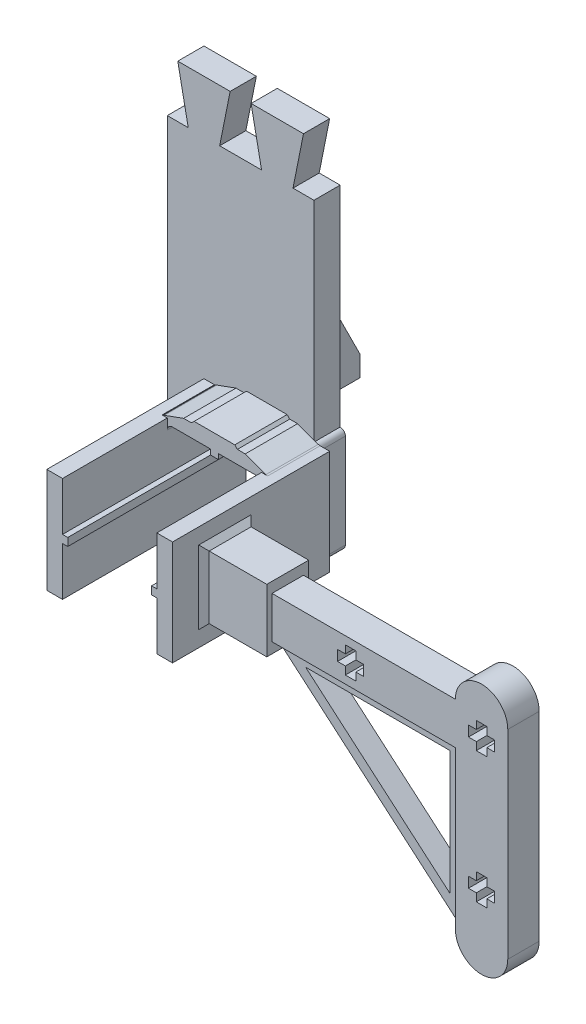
ISO-10303-21;
HEADER;
FILE_DESCRIPTION(('STEP AP214'),'2;1');
FILE_NAME('part.step','',(''),(''),'','','');
FILE_SCHEMA(('AUTOMOTIVE_DESIGN { 1 0 10303 214 1 1 1 1 }'));
ENDSEC;
DATA;
#1=APPLICATION_CONTEXT('core data for automotive mechanical design processes');
#2=APPLICATION_PROTOCOL_DEFINITION('international standard','automotive_design',2000,#1);
#3=PRODUCT_CONTEXT('',#1,'mechanical');
#4=PRODUCT('Part','Part','',(#3));
#5=PRODUCT_RELATED_PRODUCT_CATEGORY('part','',(#4));
#6=PRODUCT_DEFINITION_FORMATION('','',#4);
#7=PRODUCT_DEFINITION_CONTEXT('part definition',#1,'design');
#8=PRODUCT_DEFINITION('design','',#6,#7);
#9=PRODUCT_DEFINITION_SHAPE('','',#8);
#10=(LENGTH_UNIT() NAMED_UNIT(*) SI_UNIT(.MILLI.,.METRE.));
#11=(NAMED_UNIT(*) PLANE_ANGLE_UNIT() SI_UNIT($,.RADIAN.));
#12=(NAMED_UNIT(*) SI_UNIT($,.STERADIAN.) SOLID_ANGLE_UNIT());
#13=UNCERTAINTY_MEASURE_WITH_UNIT(LENGTH_MEASURE(1.E-05),#10,'distance_accuracy_value','');
#14=(GEOMETRIC_REPRESENTATION_CONTEXT(3) GLOBAL_UNCERTAINTY_ASSIGNED_CONTEXT((#13)) GLOBAL_UNIT_ASSIGNED_CONTEXT((#10,
#11,#12)) REPRESENTATION_CONTEXT('',''));
#15=CARTESIAN_POINT('',(0.,0.,0.));
#16=DIRECTION('',(0.,0.,1.));
#17=DIRECTION('',(1.,0.,0.));
#18=AXIS2_PLACEMENT_3D('',#15,#16,#17);
#19=CARTESIAN_POINT('',(-9.,0.,10.));
#20=DIRECTION('',(1.,0.,0.));
#21=DIRECTION('',(0.,0.,-1.));
#22=AXIS2_PLACEMENT_3D('',#19,#20,#21);
#23=PLANE('',#22);
#24=DIRECTION('',(0.,0.,-1.));
#25=VECTOR('',#24,1.);
#26=CARTESIAN_POINT('',(-9.,-0.750000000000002,10.));
#27=LINE('',#26,#25);
#28=CARTESIAN_POINT('',(-9.,-0.750000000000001,30.));
#29=VERTEX_POINT('',#28);
#30=CARTESIAN_POINT('',(-9.00000000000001,-0.750000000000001,-5.));
#31=VERTEX_POINT('',#30);
#32=EDGE_CURVE('E1541',#29,#31,#27,.T.);
#33=ORIENTED_EDGE('',*,*,#32,.F.);
#34=DIRECTION('',(0.,-1.,0.));
#35=VECTOR('',#34,1.);
#36=CARTESIAN_POINT('',(-9.,10.,30.));
#37=LINE('',#36,#35);
#38=CARTESIAN_POINT('',(-9.00000000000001,-10.,30.));
#39=VERTEX_POINT('',#38);
#40=EDGE_CURVE('E862',#29,#39,#37,.T.);
#41=ORIENTED_EDGE('',*,*,#40,.T.);
#42=DIRECTION('',(0.,0.,-1.));
#43=VECTOR('',#42,1.);
#44=CARTESIAN_POINT('',(-9.00000000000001,-10.,30.));
#45=LINE('',#44,#43);
#46=CARTESIAN_POINT('',(-9.00000000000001,-10.,10.));
#47=VERTEX_POINT('',#46);
#48=EDGE_CURVE('E893',#39,#47,#45,.T.);
#49=ORIENTED_EDGE('',*,*,#48,.T.);
#50=DIRECTION('',(0.,-1.,0.));
#51=VECTOR('',#50,1.);
#52=CARTESIAN_POINT('',(-9.,10.,10.));
#53=LINE('',#52,#51);
#54=CARTESIAN_POINT('',(-9.00000000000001,-8.,10.));
#55=VERTEX_POINT('',#54);
#56=EDGE_CURVE('E885',#55,#47,#53,.T.);
#57=ORIENTED_EDGE('',*,*,#56,.F.);
#58=DIRECTION('',(0.,0.,-1.));
#59=VECTOR('',#58,1.);
#60=CARTESIAN_POINT('',(-9.,-8.,10.));
#61=LINE('',#60,#59);
#62=CARTESIAN_POINT('',(-9.00000000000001,-8.,-5.));
#63=VERTEX_POINT('',#62);
#64=EDGE_CURVE('E1737',#55,#63,#61,.T.);
#65=ORIENTED_EDGE('',*,*,#64,.T.);
#66=DIRECTION('',(0.,-1.,0.));
#67=VECTOR('',#66,1.);
#68=CARTESIAN_POINT('',(-9.00000000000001,0.,-5.));
#69=LINE('',#68,#67);
#70=EDGE_CURVE('E1089',#31,#63,#69,.T.);
#71=ORIENTED_EDGE('',*,*,#70,.F.);
#72=EDGE_LOOP('',(#33,#41,#49,#57,#65,#71));
#73=FACE_BOUND('',#72,.T.);
#74=ADVANCED_FACE('F36',(#73),#23,.T.);
#75=CARTESIAN_POINT('',(-9.,10.,30.));
#76=VERTEX_POINT('',#75);
#77=CARTESIAN_POINT('',(-9.,0.749999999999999,30.));
#78=VERTEX_POINT('',#77);
#79=EDGE_CURVE('E876',#76,#78,#37,.T.);
#80=ORIENTED_EDGE('',*,*,#79,.T.);
#81=DIRECTION('',(0.,0.,1.));
#82=VECTOR('',#81,1.);
#83=CARTESIAN_POINT('',(-9.,0.749999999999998,10.));
#84=LINE('',#83,#82);
#85=CARTESIAN_POINT('',(-9.00000000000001,0.750000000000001,-5.));
#86=VERTEX_POINT('',#85);
#87=EDGE_CURVE('E51',#86,#78,#84,.T.);
#88=ORIENTED_EDGE('',*,*,#87,.F.);
#89=DIRECTION('',(0.,-1.,0.));
#90=VECTOR('',#89,1.);
#91=CARTESIAN_POINT('',(-9.00000000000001,0.,-5.));
#92=LINE('',#91,#90);
#93=CARTESIAN_POINT('',(-9.00000000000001,8.,-5.));
#94=VERTEX_POINT('',#93);
#95=EDGE_CURVE('E1080',#94,#86,#92,.T.);
#96=ORIENTED_EDGE('',*,*,#95,.F.);
#97=DIRECTION('',(0.,0.,-1.));
#98=VECTOR('',#97,1.);
#99=CARTESIAN_POINT('',(-9.,8.,10.));
#100=LINE('',#99,#98);
#101=CARTESIAN_POINT('',(-9.,8.,10.));
#102=VERTEX_POINT('',#101);
#103=EDGE_CURVE('E1734',#94,#102,#100,.F.);
#104=ORIENTED_EDGE('',*,*,#103,.T.);
#105=CARTESIAN_POINT('',(-9.,10.,10.));
#106=VERTEX_POINT('',#105);
#107=EDGE_CURVE('E887',#106,#102,#53,.T.);
#108=ORIENTED_EDGE('',*,*,#107,.F.);
#109=DIRECTION('',(0.,0.,-1.));
#110=VECTOR('',#109,1.);
#111=CARTESIAN_POINT('',(-9.,10.,30.));
#112=LINE('',#111,#110);
#113=EDGE_CURVE('E881',#76,#106,#112,.T.);
#114=ORIENTED_EDGE('',*,*,#113,.F.);
#115=EDGE_LOOP('',(#80,#88,#96,#104,#108,#114));
#116=FACE_BOUND('',#115,.T.);
#117=ADVANCED_FACE('F1980',(#116),#23,.T.);
#118=CARTESIAN_POINT('',(0.,0.,10.));
#119=DIRECTION('',(0.,0.,1.));
#120=DIRECTION('',(1.,0.,0.));
#121=AXIS2_PLACEMENT_3D('',#118,#119,#120);
#122=PLANE('',#121);
#123=DIRECTION('',(-1.,0.,0.));
#124=VECTOR('',#123,1.);
#125=CARTESIAN_POINT('',(-12.,-10.,10.));
#126=LINE('',#125,#124);
#127=CARTESIAN_POINT('',(-9.84531663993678,-10.,10.));
#128=VERTEX_POINT('',#127);
#129=EDGE_CURVE('E882',#47,#128,#126,.T.);
#130=ORIENTED_EDGE('',*,*,#129,.T.);
#131=CARTESIAN_POINT('',(-9.21979399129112,-9.21979399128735,10.));
#132=DIRECTION('',(0.,0.,1.));
#133=DIRECTION('',(1.,0.,0.));
#134=AXIS2_PLACEMENT_3D('',#131,#132,#133);
#135=CIRCLE('',#134,1.);
#136=CARTESIAN_POINT('',(-9.56181413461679,-10.1594866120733,10.));
#137=VERTEX_POINT('',#136);
#138=EDGE_CURVE('E1774',#128,#137,#135,.T.);
#139=ORIENTED_EDGE('',*,*,#138,.T.);
#140=DIRECTION('',(0.939692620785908,-0.342020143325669,0.));
#141=VECTOR('',#140,1.);
#142=CARTESIAN_POINT('',(-4.38371583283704,-12.0441602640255,10.));
#143=LINE('',#142,#141);
#144=CARTESIAN_POINT('',(-5.87878387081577,-11.4999999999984,10.));
#145=VERTEX_POINT('',#144);
#146=EDGE_CURVE('E1643',#137,#145,#143,.T.);
#147=ORIENTED_EDGE('',*,*,#146,.T.);
#148=DIRECTION('',(1.,0.,0.));
#149=VECTOR('',#148,1.);
#150=CARTESIAN_POINT('',(0.,-11.4999999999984,10.));
#151=LINE('',#150,#149);
#152=CARTESIAN_POINT('',(-4.37878387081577,-11.4999999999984,10.));
#153=VERTEX_POINT('',#152);
#154=EDGE_CURVE('E1645',#145,#153,#151,.T.);
#155=ORIENTED_EDGE('',*,*,#154,.T.);
#156=DIRECTION('',(0.707106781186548,-0.707106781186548,0.));
#157=VECTOR('',#156,1.);
#158=CARTESIAN_POINT('',(-7.9393919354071,-7.9393919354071,10.));
#159=LINE('',#158,#157);
#160=CARTESIAN_POINT('',(-3.87878387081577,-11.9999999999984,10.));
#161=VERTEX_POINT('',#160);
#162=EDGE_CURVE('E1647',#153,#161,#159,.T.);
#163=ORIENTED_EDGE('',*,*,#162,.T.);
#164=DIRECTION('',(1.,0.,0.));
#165=VECTOR('',#164,1.);
#166=CARTESIAN_POINT('',(0.,-11.9999999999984,10.));
#167=LINE('',#166,#165);
#168=CARTESIAN_POINT('',(3.87878387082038,-11.9999999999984,10.));
#169=VERTEX_POINT('',#168);
#170=EDGE_CURVE('E1649',#161,#169,#167,.T.);
#171=ORIENTED_EDGE('',*,*,#170,.T.);
#172=DIRECTION('',(-0.707106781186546,-0.707106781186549,0.));
#173=VECTOR('',#172,1.);
#174=CARTESIAN_POINT('',(7.93939193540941,-7.93939193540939,10.));
#175=LINE('',#174,#173);
#176=CARTESIAN_POINT('',(4.37878387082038,-11.4999999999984,10.));
#177=VERTEX_POINT('',#176);
#178=EDGE_CURVE('E1651',#177,#169,#175,.T.);
#179=ORIENTED_EDGE('',*,*,#178,.F.);
#180=DIRECTION('',(-1.,0.,0.));
#181=VECTOR('',#180,1.);
#182=CARTESIAN_POINT('',(0.,-11.4999999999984,10.));
#183=LINE('',#182,#181);
#184=CARTESIAN_POINT('',(5.87878387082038,-11.4999999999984,10.));
#185=VERTEX_POINT('',#184);
#186=EDGE_CURVE('E1654',#185,#177,#183,.T.);
#187=ORIENTED_EDGE('',*,*,#186,.F.);
#188=DIRECTION('',(-0.939692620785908,-0.34202014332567,0.));
#189=VECTOR('',#188,1.);
#190=CARTESIAN_POINT('',(4.38371583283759,-12.0441602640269,10.));
#191=LINE('',#190,#189);
#192=CARTESIAN_POINT('',(9.83430683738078,-10.0603073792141,10.));
#193=VERTEX_POINT('',#192);
#194=EDGE_CURVE('E1624',#193,#185,#191,.T.);
#195=ORIENTED_EDGE('',*,*,#194,.F.);
#196=CARTESIAN_POINT('',(10.1763269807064,-11.,10.));
#197=DIRECTION('',(0.,0.,1.));
#198=DIRECTION('',(1.,0.,0.));
#199=AXIS2_PLACEMENT_3D('',#196,#197,#198);
#200=CIRCLE('',#199,1.);
#201=CARTESIAN_POINT('',(10.1763269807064,-10.,10.));
#202=VERTEX_POINT('',#201);
#203=EDGE_CURVE('E1792',#193,#202,#200,.F.);
#204=ORIENTED_EDGE('',*,*,#203,.T.);
#205=DIRECTION('',(1.,0.,0.));
#206=VECTOR('',#205,1.);
#207=CARTESIAN_POINT('',(12.,-10.,10.));
#208=LINE('',#207,#206);
#209=CARTESIAN_POINT('',(9.00000000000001,-10.,10.));
#210=VERTEX_POINT('',#209);
#211=EDGE_CURVE('E1591',#210,#202,#208,.T.);
#212=ORIENTED_EDGE('',*,*,#211,.F.);
#213=DIRECTION('',(0.,-1.,0.));
#214=VECTOR('',#213,1.);
#215=CARTESIAN_POINT('',(9.,10.,10.));
#216=LINE('',#215,#214);
#217=CARTESIAN_POINT('',(9.,-8.,10.));
#218=VERTEX_POINT('',#217);
#219=EDGE_CURVE('E1603',#218,#210,#216,.T.);
#220=ORIENTED_EDGE('',*,*,#219,.F.);
#221=CARTESIAN_POINT('',(8.,-8.,10.));
#222=DIRECTION('',(0.,0.,1.));
#223=DIRECTION('',(1.,0.,0.));
#224=AXIS2_PLACEMENT_3D('',#221,#222,#223);
#225=CIRCLE('',#224,1.);
#226=CARTESIAN_POINT('',(8.,-9.,10.));
#227=VERTEX_POINT('',#226);
#228=EDGE_CURVE('E1756',#218,#227,#225,.F.);
#229=ORIENTED_EDGE('',*,*,#228,.T.);
#230=DIRECTION('',(-1.,0.,0.));
#231=VECTOR('',#230,1.);
#232=CARTESIAN_POINT('',(0.,-9.,10.));
#233=LINE('',#232,#231);
#234=CARTESIAN_POINT('',(0.750000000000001,-9.,10.));
#235=VERTEX_POINT('',#234);
#236=EDGE_CURVE('E1662',#227,#235,#233,.T.);
#237=ORIENTED_EDGE('',*,*,#236,.T.);
#238=DIRECTION('',(0.,1.,0.));
#239=VECTOR('',#238,1.);
#240=CARTESIAN_POINT('',(0.750000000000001,-10.,10.));
#241=LINE('',#240,#239);
#242=CARTESIAN_POINT('',(0.750000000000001,-8.,10.));
#243=VERTEX_POINT('',#242);
#244=EDGE_CURVE('E1543',#235,#243,#241,.T.);
#245=ORIENTED_EDGE('',*,*,#244,.T.);
#246=DIRECTION('',(-1.,0.,0.));
#247=VECTOR('',#246,1.);
#248=CARTESIAN_POINT('',(-0.749999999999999,-8.,10.));
#249=LINE('',#248,#247);
#250=CARTESIAN_POINT('',(-0.749999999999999,-8.,10.));
#251=VERTEX_POINT('',#250);
#252=EDGE_CURVE('E1545',#243,#251,#249,.T.);
#253=ORIENTED_EDGE('',*,*,#252,.T.);
#254=DIRECTION('',(0.,-1.,0.));
#255=VECTOR('',#254,1.);
#256=CARTESIAN_POINT('',(-0.749999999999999,-10.,10.));
#257=LINE('',#256,#255);
#258=CARTESIAN_POINT('',(-0.749999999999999,-9.,10.));
#259=VERTEX_POINT('',#258);
#260=EDGE_CURVE('E1548',#251,#259,#257,.T.);
#261=ORIENTED_EDGE('',*,*,#260,.T.);
#262=CARTESIAN_POINT('',(-8.,-9.,10.));
#263=VERTEX_POINT('',#262);
#264=EDGE_CURVE('E1661',#259,#263,#233,.T.);
#265=ORIENTED_EDGE('',*,*,#264,.T.);
#266=CARTESIAN_POINT('',(-8.,-8.,10.));
#267=DIRECTION('',(0.,0.,1.));
#268=DIRECTION('',(1.,0.,0.));
#269=AXIS2_PLACEMENT_3D('',#266,#267,#268);
#270=CIRCLE('',#269,1.);
#271=EDGE_CURVE('E1753',#263,#55,#270,.F.);
#272=ORIENTED_EDGE('',*,*,#271,.T.);
#273=ORIENTED_EDGE('',*,*,#56,.T.);
#274=EDGE_LOOP('',(#130,#139,#147,#155,#163,#171,#179,#187,#195,#204,#212,#220,#229,#237,#245,
#253,#261,#265,#272,#273));
#275=FACE_BOUND('',#274,.T.);
#276=ADVANCED_FACE('F1986',(#275),#122,.T.);
#277=CARTESIAN_POINT('',(-8.99999999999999,60.,0.));
#278=DIRECTION('',(0.,0.,-1.));
#279=DIRECTION('',(-1.,0.,0.));
#280=AXIS2_PLACEMENT_3D('',#277,#278,#279);
#281=PLANE('',#280);
#282=DIRECTION('',(-1.,0.,0.));
#283=VECTOR('',#282,1.);
#284=CARTESIAN_POINT('',(-19.,-9.,0.));
#285=LINE('',#284,#283);
#286=CARTESIAN_POINT('',(-12.,-9.00000000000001,0.));
#287=VERTEX_POINT('',#286);
#288=CARTESIAN_POINT('',(-19.,-9.,0.));
#289=VERTEX_POINT('',#288);
#290=EDGE_CURVE('E1015',#287,#289,#285,.T.);
#291=ORIENTED_EDGE('',*,*,#290,.F.);
#292=DIRECTION('',(0.,-1.,0.));
#293=VECTOR('',#292,1.);
#294=CARTESIAN_POINT('',(-12.,0.,0.));
#295=LINE('',#294,#293);
#296=CARTESIAN_POINT('',(-12.,10.,0.));
#297=VERTEX_POINT('',#296);
#298=EDGE_CURVE('E1685',#297,#287,#295,.T.);
#299=ORIENTED_EDGE('',*,*,#298,.F.);
#300=DIRECTION('',(-1.,0.,0.));
#301=VECTOR('',#300,1.);
#302=CARTESIAN_POINT('',(-10.,10.,0.));
#303=LINE('',#302,#301);
#304=CARTESIAN_POINT('',(-10.,10.,0.));
#305=VERTEX_POINT('',#304);
#306=EDGE_CURVE('E900',#305,#297,#303,.T.);
#307=ORIENTED_EDGE('',*,*,#306,.F.);
#308=DIRECTION('',(0.,1.,0.));
#309=VECTOR('',#308,1.);
#310=CARTESIAN_POINT('',(-10.,-10.,0.));
#311=LINE('',#310,#309);
#312=CARTESIAN_POINT('',(-10.,9.84531663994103,0.));
#313=VERTEX_POINT('',#312);
#314=EDGE_CURVE('E903',#313,#305,#311,.T.);
#315=ORIENTED_EDGE('',*,*,#314,.F.);
#316=CARTESIAN_POINT('',(-9.21979399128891,9.21979399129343,0.));
#317=DIRECTION('',(0.,0.,1.));
#318=DIRECTION('',(1.,0.,0.));
#319=AXIS2_PLACEMENT_3D('',#316,#317,#318);
#320=CIRCLE('',#319,1.);
#321=CARTESIAN_POINT('',(-9.56181413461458,10.1594866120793,0.));
#322=VERTEX_POINT('',#321);
#323=EDGE_CURVE('E1766',#313,#322,#320,.F.);
#324=ORIENTED_EDGE('',*,*,#323,.T.);
#325=DIRECTION('',(0.939692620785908,0.34202014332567,0.));
#326=VECTOR('',#325,1.);
#327=CARTESIAN_POINT('',(-4.38371583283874,12.0441602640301,0.));
#328=LINE('',#327,#326);
#329=CARTESIAN_POINT('',(-5.87878387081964,11.5000000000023,0.));
#330=VERTEX_POINT('',#329);
#331=EDGE_CURVE('E1683',#322,#330,#328,.T.);
#332=ORIENTED_EDGE('',*,*,#331,.T.);
#333=DIRECTION('',(1.,0.,0.));
#334=VECTOR('',#333,1.);
#335=CARTESIAN_POINT('',(0.,11.5000000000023,0.));
#336=LINE('',#335,#334);
#337=CARTESIAN_POINT('',(-4.37878387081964,11.5000000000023,0.));
#338=VERTEX_POINT('',#337);
#339=EDGE_CURVE('E1681',#330,#338,#336,.T.);
#340=ORIENTED_EDGE('',*,*,#339,.T.);
#341=DIRECTION('',(0.707106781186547,0.707106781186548,0.));
#342=VECTOR('',#341,1.);
#343=CARTESIAN_POINT('',(-7.93939193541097,7.93939193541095,0.));
#344=LINE('',#343,#342);
#345=CARTESIAN_POINT('',(-3.87878387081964,12.0000000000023,0.));
#346=VERTEX_POINT('',#345);
#347=EDGE_CURVE('E1679',#338,#346,#344,.T.);
#348=ORIENTED_EDGE('',*,*,#347,.T.);
#349=DIRECTION('',(-1.,0.,0.));
#350=VECTOR('',#349,1.);
#351=CARTESIAN_POINT('',(0.,12.0000000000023,0.));
#352=LINE('',#351,#350);
#353=CARTESIAN_POINT('',(3.87878387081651,12.0000000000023,0.));
#354=VERTEX_POINT('',#353);
#355=EDGE_CURVE('E1676',#354,#346,#352,.T.);
#356=ORIENTED_EDGE('',*,*,#355,.F.);
#357=DIRECTION('',(-0.707106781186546,0.707106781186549,0.));
#358=VECTOR('',#357,1.);
#359=CARTESIAN_POINT('',(7.93939193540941,7.93939193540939,0.));
#360=LINE('',#359,#358);
#361=CARTESIAN_POINT('',(4.37878387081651,11.5000000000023,0.));
#362=VERTEX_POINT('',#361);
#363=EDGE_CURVE('E1673',#362,#354,#360,.T.);
#364=ORIENTED_EDGE('',*,*,#363,.F.);
#365=DIRECTION('',(-1.,0.,0.));
#366=VECTOR('',#365,1.);
#367=CARTESIAN_POINT('',(0.,11.5000000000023,0.));
#368=LINE('',#367,#366);
#369=CARTESIAN_POINT('',(5.87878387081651,11.5000000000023,0.));
#370=VERTEX_POINT('',#369);
#371=EDGE_CURVE('E1670',#370,#362,#368,.T.);
#372=ORIENTED_EDGE('',*,*,#371,.F.);
#373=DIRECTION('',(0.939692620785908,-0.342020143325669,0.));
#374=VECTOR('',#373,1.);
#375=CARTESIAN_POINT('',(4.38371583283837,12.0441602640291,0.));
#376=LINE('',#375,#374);
#377=CARTESIAN_POINT('',(9.,10.3639702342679,0.));
#378=VERTEX_POINT('',#377);
#379=EDGE_CURVE('E1039',#370,#378,#376,.T.);
#380=ORIENTED_EDGE('',*,*,#379,.T.);
#381=DIRECTION('',(0.,-1.,0.));
#382=VECTOR('',#381,1.);
#383=CARTESIAN_POINT('',(9.00000000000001,60.,0.));
#384=LINE('',#383,#382);
#385=CARTESIAN_POINT('',(9.00000000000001,50.,0.));
#386=VERTEX_POINT('',#385);
#387=EDGE_CURVE('E1037',#386,#378,#384,.T.);
#388=ORIENTED_EDGE('',*,*,#387,.F.);
#389=DIRECTION('',(-1.,0.,0.));
#390=VECTOR('',#389,1.);
#391=CARTESIAN_POINT('',(-8.99999999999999,50.,0.));
#392=LINE('',#391,#390);
#393=CARTESIAN_POINT('',(5.,50.,0.));
#394=VERTEX_POINT('',#393);
#395=EDGE_CURVE('E1008',#386,#394,#392,.T.);
#396=ORIENTED_EDGE('',*,*,#395,.T.);
#397=DIRECTION('',(0.196116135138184,0.98058067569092,0.));
#398=VECTOR('',#397,1.);
#399=CARTESIAN_POINT('',(6.38461538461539,56.9230769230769,0.));
#400=LINE('',#399,#398);
#401=CARTESIAN_POINT('',(7.,60.,0.));
#402=VERTEX_POINT('',#401);
#403=EDGE_CURVE('E1005',#394,#402,#400,.T.);
#404=ORIENTED_EDGE('',*,*,#403,.T.);
#405=DIRECTION('',(1.,0.,0.));
#406=VECTOR('',#405,1.);
#407=CARTESIAN_POINT('',(-8.99999999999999,60.,0.));
#408=LINE('',#407,#406);
#409=CARTESIAN_POINT('',(-3.,60.,0.));
#410=VERTEX_POINT('',#409);
#411=EDGE_CURVE('E1021',#410,#402,#408,.T.);
#412=ORIENTED_EDGE('',*,*,#411,.F.);
#413=DIRECTION('',(-0.196116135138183,0.98058067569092,0.));
#414=VECTOR('',#413,1.);
#415=CARTESIAN_POINT('',(-3.23076923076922,61.1538461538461,0.));
#416=LINE('',#415,#414);
#417=CARTESIAN_POINT('',(-1.,50.,0.));
#418=VERTEX_POINT('',#417);
#419=EDGE_CURVE('E1003',#418,#410,#416,.T.);
#420=ORIENTED_EDGE('',*,*,#419,.F.);
#421=DIRECTION('',(-1.,0.,0.));
#422=VECTOR('',#421,1.);
#423=CARTESIAN_POINT('',(-8.99999999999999,50.,0.));
#424=LINE('',#423,#422);
#425=CARTESIAN_POINT('',(-8.99999999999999,50.,0.));
#426=VERTEX_POINT('',#425);
#427=EDGE_CURVE('E44',#418,#426,#424,.T.);
#428=ORIENTED_EDGE('',*,*,#427,.T.);
#429=DIRECTION('',(0.196116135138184,0.98058067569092,0.));
#430=VECTOR('',#429,1.);
#431=CARTESIAN_POINT('',(-7.07692307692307,59.6153846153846,0.));
#432=LINE('',#431,#430);
#433=CARTESIAN_POINT('',(-6.99999999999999,60.,0.));
#434=VERTEX_POINT('',#433);
#435=EDGE_CURVE('E1000',#426,#434,#432,.T.);
#436=ORIENTED_EDGE('',*,*,#435,.T.);
#437=CARTESIAN_POINT('',(-17.,60.,0.));
#438=VERTEX_POINT('',#437);
#439=EDGE_CURVE('E1029',#438,#434,#408,.T.);
#440=ORIENTED_EDGE('',*,*,#439,.F.);
#441=DIRECTION('',(-0.196116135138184,0.98058067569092,0.));
#442=VECTOR('',#441,1.);
#443=CARTESIAN_POINT('',(-16.6923076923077,58.4615384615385,0.));
#444=LINE('',#443,#442);
#445=CARTESIAN_POINT('',(-15.,50.,0.));
#446=VERTEX_POINT('',#445);
#447=EDGE_CURVE('E998',#446,#438,#444,.T.);
#448=ORIENTED_EDGE('',*,*,#447,.F.);
#449=DIRECTION('',(-1.,0.,0.));
#450=VECTOR('',#449,1.);
#451=CARTESIAN_POINT('',(-8.99999999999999,50.,0.));
#452=LINE('',#451,#450);
#453=CARTESIAN_POINT('',(-19.,50.,0.));
#454=VERTEX_POINT('',#453);
#455=EDGE_CURVE('E975',#446,#454,#452,.T.);
#456=ORIENTED_EDGE('',*,*,#455,.T.);
#457=DIRECTION('',(0.,1.,0.));
#458=VECTOR('',#457,1.);
#459=CARTESIAN_POINT('',(-19.,60.,0.));
#460=LINE('',#459,#458);
#461=EDGE_CURVE('E1018',#289,#454,#460,.T.);
#462=ORIENTED_EDGE('',*,*,#461,.F.);
#463=EDGE_LOOP('',(#291,#299,#307,#315,#324,#332,#340,#348,#356,#364,#372,#380,#388,#396,#404,
#412,#420,#428,#436,#440,#448,#456,#462));
#464=FACE_BOUND('',#463,.T.);
#465=ADVANCED_FACE('F1846',(#464),#281,.F.);
#466=CARTESIAN_POINT('',(-9.21979399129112,-9.21979399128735,10.));
#467=DIRECTION('',(0.,0.,1.));
#468=DIRECTION('',(1.,0.,0.));
#469=AXIS2_PLACEMENT_3D('',#466,#467,#468);
#470=CYLINDRICAL_SURFACE('',#469,1.);
#471=CARTESIAN_POINT('',(-10.,-9.84531663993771,10.));
#472=VERTEX_POINT('',#471);
#473=EDGE_CURVE('E1775',#472,#128,#135,.T.);
#474=ORIENTED_EDGE('',*,*,#473,.F.);
#475=DIRECTION('',(0.,0.,1.));
#476=VECTOR('',#475,1.);
#477=CARTESIAN_POINT('',(-10.,-9.84531663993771,10.));
#478=LINE('',#477,#476);
#479=CARTESIAN_POINT('',(-10.,-9.84531663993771,0.));
#480=VERTEX_POINT('',#479);
#481=EDGE_CURVE('E906',#472,#480,#478,.F.);
#482=ORIENTED_EDGE('',*,*,#481,.T.);
#483=CARTESIAN_POINT('',(-9.21979399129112,-9.21979399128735,0.));
#484=DIRECTION('',(0.,0.,1.));
#485=DIRECTION('',(1.,0.,0.));
#486=AXIS2_PLACEMENT_3D('',#483,#484,#485);
#487=CIRCLE('',#486,1.);
#488=CARTESIAN_POINT('',(-9.56181413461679,-10.1594866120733,0.));
#489=VERTEX_POINT('',#488);
#490=EDGE_CURVE('E1768',#489,#480,#487,.F.);
#491=ORIENTED_EDGE('',*,*,#490,.F.);
#492=DIRECTION('',(0.,0.,-1.));
#493=VECTOR('',#492,1.);
#494=CARTESIAN_POINT('',(-9.56181413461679,-10.1594866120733,0.));
#495=LINE('',#494,#493);
#496=EDGE_CURVE('E1763',#137,#489,#495,.T.);
#497=ORIENTED_EDGE('',*,*,#496,.F.);
#498=ORIENTED_EDGE('',*,*,#138,.F.);
#499=EDGE_LOOP('',(#474,#482,#491,#497,#498));
#500=FACE_BOUND('',#499,.T.);
#501=ADVANCED_FACE('F2054',(#500),#470,.T.);
#502=CARTESIAN_POINT('',(-9.21979399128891,9.21979399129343,10.));
#503=DIRECTION('',(0.,0.,1.));
#504=DIRECTION('',(1.,0.,0.));
#505=AXIS2_PLACEMENT_3D('',#502,#503,#504);
#506=CYLINDRICAL_SURFACE('',#505,1.);
#507=ORIENTED_EDGE('',*,*,#323,.F.);
#508=DIRECTION('',(0.,0.,1.));
#509=VECTOR('',#508,1.);
#510=CARTESIAN_POINT('',(-10.,9.84531663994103,10.));
#511=LINE('',#510,#509);
#512=CARTESIAN_POINT('',(-10.,9.84531663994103,10.));
#513=VERTEX_POINT('',#512);
#514=EDGE_CURVE('E11',#313,#513,#511,.T.);
#515=ORIENTED_EDGE('',*,*,#514,.T.);
#516=CARTESIAN_POINT('',(-9.21979399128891,9.21979399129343,10.));
#517=DIRECTION('',(0.,0.,-1.));
#518=DIRECTION('',(-1.,0.,0.));
#519=AXIS2_PLACEMENT_3D('',#516,#517,#518);
#520=CIRCLE('',#519,1.);
#521=CARTESIAN_POINT('',(-9.84531663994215,10.,10.));
#522=VERTEX_POINT('',#521);
#523=EDGE_CURVE('E59',#522,#513,#520,.F.);
#524=ORIENTED_EDGE('',*,*,#523,.F.);
#525=CARTESIAN_POINT('',(-9.21979399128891,9.21979399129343,10.));
#526=DIRECTION('',(0.,0.,1.));
#527=DIRECTION('',(1.,0.,0.));
#528=AXIS2_PLACEMENT_3D('',#525,#526,#527);
#529=CIRCLE('',#528,1.);
#530=CARTESIAN_POINT('',(-9.56181413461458,10.1594866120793,10.));
#531=VERTEX_POINT('',#530);
#532=EDGE_CURVE('E1771',#531,#522,#529,.T.);
#533=ORIENTED_EDGE('',*,*,#532,.F.);
#534=DIRECTION('',(0.,0.,-1.));
#535=VECTOR('',#534,1.);
#536=CARTESIAN_POINT('',(-9.56181413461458,10.1594866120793,10.));
#537=LINE('',#536,#535);
#538=EDGE_CURVE('E1777',#322,#531,#537,.F.);
#539=ORIENTED_EDGE('',*,*,#538,.F.);
#540=EDGE_LOOP('',(#507,#515,#524,#533,#539));
#541=FACE_BOUND('',#540,.T.);
#542=ADVANCED_FACE('F1915',(#541),#506,.T.);
#543=CARTESIAN_POINT('',(9.,0.,10.));
#544=DIRECTION('',(1.,0.,0.));
#545=DIRECTION('',(0.,0.,-1.));
#546=AXIS2_PLACEMENT_3D('',#543,#544,#545);
#547=PLANE('',#546);
#548=DIRECTION('',(0.,0.,1.));
#549=VECTOR('',#548,1.);
#550=CARTESIAN_POINT('',(9.,0.75,10.));
#551=LINE('',#550,#549);
#552=CARTESIAN_POINT('',(9.00000000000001,0.75,-5.));
#553=VERTEX_POINT('',#552);
#554=CARTESIAN_POINT('',(9.,0.750000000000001,30.));
#555=VERTEX_POINT('',#554);
#556=EDGE_CURVE('E1566',#553,#555,#551,.T.);
#557=ORIENTED_EDGE('',*,*,#556,.T.);
#558=DIRECTION('',(0.,-1.,0.));
#559=VECTOR('',#558,1.);
#560=CARTESIAN_POINT('',(9.,10.,30.));
#561=LINE('',#560,#559);
#562=CARTESIAN_POINT('',(9.,10.,30.));
#563=VERTEX_POINT('',#562);
#564=EDGE_CURVE('E1594',#563,#555,#561,.T.);
#565=ORIENTED_EDGE('',*,*,#564,.F.);
#566=DIRECTION('',(0.,0.,-1.));
#567=VECTOR('',#566,1.);
#568=CARTESIAN_POINT('',(9.,10.,30.));
#569=LINE('',#568,#567);
#570=CARTESIAN_POINT('',(9.,10.,10.));
#571=VERTEX_POINT('',#570);
#572=EDGE_CURVE('E1610',#563,#571,#569,.T.);
#573=ORIENTED_EDGE('',*,*,#572,.T.);
#574=CARTESIAN_POINT('',(9.,8.,10.));
#575=VERTEX_POINT('',#574);
#576=EDGE_CURVE('E1604',#571,#575,#216,.T.);
#577=ORIENTED_EDGE('',*,*,#576,.T.);
#578=DIRECTION('',(0.,0.,-1.));
#579=VECTOR('',#578,1.);
#580=CARTESIAN_POINT('',(9.,8.,10.));
#581=LINE('',#580,#579);
#582=CARTESIAN_POINT('',(9.00000000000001,8.,-5.));
#583=VERTEX_POINT('',#582);
#584=EDGE_CURVE('E1744',#575,#583,#581,.T.);
#585=ORIENTED_EDGE('',*,*,#584,.T.);
#586=DIRECTION('',(0.,-1.,0.));
#587=VECTOR('',#586,1.);
#588=CARTESIAN_POINT('',(9.00000000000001,0.,-5.));
#589=LINE('',#588,#587);
#590=EDGE_CURVE('E1065',#583,#553,#589,.T.);
#591=ORIENTED_EDGE('',*,*,#590,.T.);
#592=EDGE_LOOP('',(#557,#565,#573,#577,#585,#591));
#593=FACE_BOUND('',#592,.T.);
#594=ADVANCED_FACE('F2060',(#593),#547,.F.);
#595=CARTESIAN_POINT('',(9.,-0.750000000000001,30.));
#596=VERTEX_POINT('',#595);
#597=CARTESIAN_POINT('',(9.00000000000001,-10.,30.));
#598=VERTEX_POINT('',#597);
#599=EDGE_CURVE('E1593',#596,#598,#561,.T.);
#600=ORIENTED_EDGE('',*,*,#599,.F.);
#601=DIRECTION('',(0.,0.,-1.));
#602=VECTOR('',#601,1.);
#603=CARTESIAN_POINT('',(9.,-0.75,10.));
#604=LINE('',#603,#602);
#605=CARTESIAN_POINT('',(9.00000000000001,-0.75,-5.));
#606=VERTEX_POINT('',#605);
#607=EDGE_CURVE('E1563',#596,#606,#604,.T.);
#608=ORIENTED_EDGE('',*,*,#607,.T.);
#609=DIRECTION('',(0.,-1.,0.));
#610=VECTOR('',#609,1.);
#611=CARTESIAN_POINT('',(9.00000000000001,0.,-5.));
#612=LINE('',#611,#610);
#613=CARTESIAN_POINT('',(9.00000000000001,-8.,-5.));
#614=VERTEX_POINT('',#613);
#615=EDGE_CURVE('E1053',#606,#614,#612,.T.);
#616=ORIENTED_EDGE('',*,*,#615,.T.);
#617=DIRECTION('',(0.,0.,-1.));
#618=VECTOR('',#617,1.);
#619=CARTESIAN_POINT('',(9.,-8.,10.));
#620=LINE('',#619,#618);
#621=EDGE_CURVE('E1746',#614,#218,#620,.F.);
#622=ORIENTED_EDGE('',*,*,#621,.T.);
#623=ORIENTED_EDGE('',*,*,#219,.T.);
#624=DIRECTION('',(0.,0.,-1.));
#625=VECTOR('',#624,1.);
#626=CARTESIAN_POINT('',(9.00000000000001,-10.,30.));
#627=LINE('',#626,#625);
#628=EDGE_CURVE('E1600',#598,#210,#627,.T.);
#629=ORIENTED_EDGE('',*,*,#628,.F.);
#630=EDGE_LOOP('',(#600,#608,#616,#622,#623,#629));
#631=FACE_BOUND('',#630,.T.);
#632=ADVANCED_FACE('F1974',(#631),#547,.F.);
#633=CARTESIAN_POINT('',(0.,0.,-5.));
#634=DIRECTION('',(0.,0.,-1.));
#635=DIRECTION('',(-1.,0.,0.));
#636=AXIS2_PLACEMENT_3D('',#633,#634,#635);
#637=PLANE('',#636);
#638=DIRECTION('',(0.,1.,0.));
#639=VECTOR('',#638,1.);
#640=CARTESIAN_POINT('',(0.749999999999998,24.,-5.));
#641=LINE('',#640,#639);
#642=CARTESIAN_POINT('',(0.75,9.,-5.));
#643=VERTEX_POINT('',#642);
#644=CARTESIAN_POINT('',(0.749999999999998,24.,-5.));
#645=VERTEX_POINT('',#644);
#646=EDGE_CURVE('E924',#643,#645,#641,.T.);
#647=ORIENTED_EDGE('',*,*,#646,.T.);
#648=DIRECTION('',(-1.,0.,0.));
#649=VECTOR('',#648,1.);
#650=CARTESIAN_POINT('',(0.749999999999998,24.,-5.));
#651=LINE('',#650,#649);
#652=CARTESIAN_POINT('',(-0.750000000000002,24.,-5.));
#653=VERTEX_POINT('',#652);
#654=EDGE_CURVE('E937',#645,#653,#651,.T.);
#655=ORIENTED_EDGE('',*,*,#654,.T.);
#656=DIRECTION('',(0.,1.,0.));
#657=VECTOR('',#656,1.);
#658=CARTESIAN_POINT('',(-0.750000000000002,24.,-5.));
#659=LINE('',#658,#657);
#660=CARTESIAN_POINT('',(-0.75,9.,-5.));
#661=VERTEX_POINT('',#660);
#662=EDGE_CURVE('E923',#661,#653,#659,.T.);
#663=ORIENTED_EDGE('',*,*,#662,.F.);
#664=DIRECTION('',(1.,0.,0.));
#665=VECTOR('',#664,1.);
#666=CARTESIAN_POINT('',(0.,9.,-5.));
#667=LINE('',#666,#665);
#668=CARTESIAN_POINT('',(-8.,9.,-5.));
#669=VERTEX_POINT('',#668);
#670=EDGE_CURVE('E1074',#669,#661,#667,.T.);
#671=ORIENTED_EDGE('',*,*,#670,.F.);
#672=CARTESIAN_POINT('',(-8.,8.,-5.));
#673=DIRECTION('',(0.,0.,-1.));
#674=DIRECTION('',(-1.,0.,0.));
#675=AXIS2_PLACEMENT_3D('',#672,#673,#674);
#676=CIRCLE('',#675,1.);
#677=EDGE_CURVE('E1077',#669,#94,#676,.F.);
#678=ORIENTED_EDGE('',*,*,#677,.T.);
#679=ORIENTED_EDGE('',*,*,#95,.T.);
#680=DIRECTION('',(1.,0.,0.));
#681=VECTOR('',#680,1.);
#682=CARTESIAN_POINT('',(0.,0.750000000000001,-5.));
#683=LINE('',#682,#681);
#684=CARTESIAN_POINT('',(-8.,0.750000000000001,-5.));
#685=VERTEX_POINT('',#684);
#686=EDGE_CURVE('E1083',#86,#685,#683,.T.);
#687=ORIENTED_EDGE('',*,*,#686,.T.);
#688=DIRECTION('',(0.,-1.,0.));
#689=VECTOR('',#688,1.);
#690=CARTESIAN_POINT('',(-8.,0.,-5.));
#691=LINE('',#690,#689);
#692=CARTESIAN_POINT('',(-8.,-0.750000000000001,-5.));
#693=VERTEX_POINT('',#692);
#694=EDGE_CURVE('E1086',#685,#693,#691,.T.);
#695=ORIENTED_EDGE('',*,*,#694,.T.);
#696=DIRECTION('',(1.,0.,0.));
#697=VECTOR('',#696,1.);
#698=CARTESIAN_POINT('',(0.,-0.750000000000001,-5.));
#699=LINE('',#698,#697);
#700=EDGE_CURVE('E846',#31,#693,#699,.T.);
#701=ORIENTED_EDGE('',*,*,#700,.F.);
#702=ORIENTED_EDGE('',*,*,#70,.T.);
#703=CARTESIAN_POINT('',(-8.,-8.,-5.));
#704=DIRECTION('',(0.,0.,-1.));
#705=DIRECTION('',(-1.,0.,0.));
#706=AXIS2_PLACEMENT_3D('',#703,#704,#705);
#707=CIRCLE('',#706,1.);
#708=CARTESIAN_POINT('',(-8.,-9.,-5.));
#709=VERTEX_POINT('',#708);
#710=EDGE_CURVE('E1092',#63,#709,#707,.F.);
#711=ORIENTED_EDGE('',*,*,#710,.T.);
#712=DIRECTION('',(1.,0.,0.));
#713=VECTOR('',#712,1.);
#714=CARTESIAN_POINT('',(0.,-9.,-5.));
#715=LINE('',#714,#713);
#716=CARTESIAN_POINT('',(-0.750000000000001,-9.,-5.));
#717=VERTEX_POINT('',#716);
#718=EDGE_CURVE('E1095',#709,#717,#715,.T.);
#719=ORIENTED_EDGE('',*,*,#718,.T.);
#720=DIRECTION('',(0.,1.,0.));
#721=VECTOR('',#720,1.);
#722=CARTESIAN_POINT('',(-0.750000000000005,0.,-5.));
#723=LINE('',#722,#721);
#724=CARTESIAN_POINT('',(-0.750000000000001,-8.,-5.));
#725=VERTEX_POINT('',#724);
#726=EDGE_CURVE('E1098',#717,#725,#723,.T.);
#727=ORIENTED_EDGE('',*,*,#726,.T.);
#728=DIRECTION('',(1.,0.,0.));
#729=VECTOR('',#728,1.);
#730=CARTESIAN_POINT('',(0.,-8.,-5.));
#731=LINE('',#730,#729);
#732=CARTESIAN_POINT('',(0.750000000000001,-8.,-5.));
#733=VERTEX_POINT('',#732);
#734=EDGE_CURVE('E1101',#725,#733,#731,.T.);
#735=ORIENTED_EDGE('',*,*,#734,.T.);
#736=DIRECTION('',(0.,1.,0.));
#737=VECTOR('',#736,1.);
#738=CARTESIAN_POINT('',(0.750000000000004,0.,-5.));
#739=LINE('',#738,#737);
#740=CARTESIAN_POINT('',(0.750000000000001,-9.,-5.));
#741=VERTEX_POINT('',#740);
#742=EDGE_CURVE('E1043',#741,#733,#739,.T.);
#743=ORIENTED_EDGE('',*,*,#742,.F.);
#744=DIRECTION('',(1.,0.,0.));
#745=VECTOR('',#744,1.);
#746=CARTESIAN_POINT('',(0.,-9.,-5.));
#747=LINE('',#746,#745);
#748=CARTESIAN_POINT('',(8.,-9.,-5.));
#749=VERTEX_POINT('',#748);
#750=EDGE_CURVE('E1046',#741,#749,#747,.T.);
#751=ORIENTED_EDGE('',*,*,#750,.T.);
#752=CARTESIAN_POINT('',(8.,-8.,-5.));
#753=DIRECTION('',(0.,0.,-1.));
#754=DIRECTION('',(-1.,0.,0.));
#755=AXIS2_PLACEMENT_3D('',#752,#753,#754);
#756=CIRCLE('',#755,1.);
#757=EDGE_CURVE('E1050',#749,#614,#756,.F.);
#758=ORIENTED_EDGE('',*,*,#757,.T.);
#759=ORIENTED_EDGE('',*,*,#615,.F.);
#760=DIRECTION('',(-1.,0.,0.));
#761=VECTOR('',#760,1.);
#762=CARTESIAN_POINT('',(0.,-0.75,-5.));
#763=LINE('',#762,#761);
#764=CARTESIAN_POINT('',(8.,-0.75,-5.));
#765=VERTEX_POINT('',#764);
#766=EDGE_CURVE('E1056',#606,#765,#763,.T.);
#767=ORIENTED_EDGE('',*,*,#766,.T.);
#768=DIRECTION('',(0.,1.,0.));
#769=VECTOR('',#768,1.);
#770=CARTESIAN_POINT('',(8.,0.,-5.));
#771=LINE('',#770,#769);
#772=CARTESIAN_POINT('',(8.,0.75,-5.));
#773=VERTEX_POINT('',#772);
#774=EDGE_CURVE('E1059',#765,#773,#771,.T.);
#775=ORIENTED_EDGE('',*,*,#774,.T.);
#776=DIRECTION('',(-1.,0.,0.));
#777=VECTOR('',#776,1.);
#778=CARTESIAN_POINT('',(0.,0.75,-5.));
#779=LINE('',#778,#777);
#780=EDGE_CURVE('E1062',#553,#773,#779,.T.);
#781=ORIENTED_EDGE('',*,*,#780,.F.);
#782=ORIENTED_EDGE('',*,*,#590,.F.);
#783=CARTESIAN_POINT('',(8.,8.,-5.));
#784=DIRECTION('',(0.,0.,-1.));
#785=DIRECTION('',(-1.,0.,0.));
#786=AXIS2_PLACEMENT_3D('',#783,#784,#785);
#787=CIRCLE('',#786,1.);
#788=CARTESIAN_POINT('',(8.,9.,-5.));
#789=VERTEX_POINT('',#788);
#790=EDGE_CURVE('E1068',#789,#583,#787,.T.);
#791=ORIENTED_EDGE('',*,*,#790,.F.);
#792=DIRECTION('',(1.,0.,0.));
#793=VECTOR('',#792,1.);
#794=CARTESIAN_POINT('',(0.,9.,-5.));
#795=LINE('',#794,#793);
#796=EDGE_CURVE('E1071',#643,#789,#795,.T.);
#797=ORIENTED_EDGE('',*,*,#796,.F.);
#798=EDGE_LOOP('',(#647,#655,#663,#671,#678,#679,#687,#695,#701,#702,#711,#719,#727,#735,#743,
#751,#758,#759,#767,#775,#781,#782,#791,#797));
#799=FACE_BOUND('',#798,.T.);
#800=DIRECTION('',(-1.,0.,0.));
#801=VECTOR('',#800,1.);
#802=CARTESIAN_POINT('',(0.,50.,-5.));
#803=LINE('',#802,#801);
#804=CARTESIAN_POINT('',(9.00000000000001,50.,-5.));
#805=VERTEX_POINT('',#804);
#806=CARTESIAN_POINT('',(5.,50.,-5.));
#807=VERTEX_POINT('',#806);
#808=EDGE_CURVE('E966',#805,#807,#803,.T.);
#809=ORIENTED_EDGE('',*,*,#808,.F.);
#810=DIRECTION('',(0.,-1.,0.));
#811=VECTOR('',#810,1.);
#812=CARTESIAN_POINT('',(9.00000000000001,60.,-5.));
#813=LINE('',#812,#811);
#814=CARTESIAN_POINT('',(9.,9.99999999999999,-5.));
#815=VERTEX_POINT('',#814);
#816=EDGE_CURVE('E1034',#805,#815,#813,.T.);
#817=ORIENTED_EDGE('',*,*,#816,.T.);
#818=CARTESIAN_POINT('',(9.,9.,-5.));
#819=DIRECTION('',(0.,0.,-1.));
#820=DIRECTION('',(-1.,0.,0.));
#821=AXIS2_PLACEMENT_3D('',#818,#819,#820);
#822=CIRCLE('',#821,1.);
#823=CARTESIAN_POINT('',(10.,9.,-5.));
#824=VERTEX_POINT('',#823);
#825=EDGE_CURVE('E1113',#815,#824,#822,.T.);
#826=ORIENTED_EDGE('',*,*,#825,.T.);
#827=DIRECTION('',(0.,-1.,0.));
#828=VECTOR('',#827,1.);
#829=CARTESIAN_POINT('',(10.,0.,-5.));
#830=LINE('',#829,#828);
#831=CARTESIAN_POINT('',(10.,-9.00000000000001,-5.));
#832=VERTEX_POINT('',#831);
#833=EDGE_CURVE('E1116',#824,#832,#830,.T.);
#834=ORIENTED_EDGE('',*,*,#833,.T.);
#835=CARTESIAN_POINT('',(9.,-9.00000000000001,-5.));
#836=DIRECTION('',(0.,0.,-1.));
#837=DIRECTION('',(-1.,0.,0.));
#838=AXIS2_PLACEMENT_3D('',#835,#836,#837);
#839=CIRCLE('',#838,0.999999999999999);
#840=CARTESIAN_POINT('',(9.,-10.,-5.));
#841=VERTEX_POINT('',#840);
#842=EDGE_CURVE('E1104',#841,#832,#839,.F.);
#843=ORIENTED_EDGE('',*,*,#842,.F.);
#844=DIRECTION('',(1.,0.,0.));
#845=VECTOR('',#844,1.);
#846=CARTESIAN_POINT('',(0.,-10.,-5.));
#847=LINE('',#846,#845);
#848=CARTESIAN_POINT('',(-9.,-10.,-5.));
#849=VERTEX_POINT('',#848);
#850=EDGE_CURVE('E1107',#849,#841,#847,.T.);
#851=ORIENTED_EDGE('',*,*,#850,.F.);
#852=CARTESIAN_POINT('',(-9.,-9.00000000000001,-5.));
#853=DIRECTION('',(0.,0.,-1.));
#854=DIRECTION('',(-1.,0.,0.));
#855=AXIS2_PLACEMENT_3D('',#852,#853,#854);
#856=CIRCLE('',#855,0.999999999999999);
#857=CARTESIAN_POINT('',(-10.,-9.00000000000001,-5.));
#858=VERTEX_POINT('',#857);
#859=EDGE_CURVE('E1110',#858,#849,#856,.F.);
#860=ORIENTED_EDGE('',*,*,#859,.F.);
#861=DIRECTION('',(-1.,0.,0.));
#862=VECTOR('',#861,1.);
#863=CARTESIAN_POINT('',(-19.,-9.,-5.));
#864=LINE('',#863,#862);
#865=CARTESIAN_POINT('',(-19.,-9.,-5.));
#866=VERTEX_POINT('',#865);
#867=EDGE_CURVE('E1011',#858,#866,#864,.T.);
#868=ORIENTED_EDGE('',*,*,#867,.T.);
#869=DIRECTION('',(0.,1.,0.));
#870=VECTOR('',#869,1.);
#871=CARTESIAN_POINT('',(-19.,60.,-5.));
#872=LINE('',#871,#870);
#873=CARTESIAN_POINT('',(-19.,50.,-5.));
#874=VERTEX_POINT('',#873);
#875=EDGE_CURVE('E1012',#866,#874,#872,.T.);
#876=ORIENTED_EDGE('',*,*,#875,.T.);
#877=DIRECTION('',(-1.,0.,0.));
#878=VECTOR('',#877,1.);
#879=CARTESIAN_POINT('',(0.,50.,-5.));
#880=LINE('',#879,#878);
#881=CARTESIAN_POINT('',(-15.,50.,-5.));
#882=VERTEX_POINT('',#881);
#883=EDGE_CURVE('E991',#882,#874,#880,.T.);
#884=ORIENTED_EDGE('',*,*,#883,.F.);
#885=DIRECTION('',(-0.196116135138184,0.98058067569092,0.));
#886=VECTOR('',#885,1.);
#887=CARTESIAN_POINT('',(-4.8076923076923,-0.96153846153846,-5.));
#888=LINE('',#887,#886);
#889=CARTESIAN_POINT('',(-17.,60.,-5.));
#890=VERTEX_POINT('',#889);
#891=EDGE_CURVE('E963',#882,#890,#888,.T.);
#892=ORIENTED_EDGE('',*,*,#891,.T.);
#893=DIRECTION('',(-1.,0.,0.));
#894=VECTOR('',#893,1.);
#895=CARTESIAN_POINT('',(-8.99999999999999,60.,-5.));
#896=LINE('',#895,#894);
#897=CARTESIAN_POINT('',(-6.99999999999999,60.,-5.));
#898=VERTEX_POINT('',#897);
#899=EDGE_CURVE('E1030',#898,#890,#896,.T.);
#900=ORIENTED_EDGE('',*,*,#899,.F.);
#901=DIRECTION('',(0.196116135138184,0.98058067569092,0.));
#902=VECTOR('',#901,1.);
#903=CARTESIAN_POINT('',(-18.2692307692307,3.65384615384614,-5.));
#904=LINE('',#903,#902);
#905=CARTESIAN_POINT('',(-8.99999999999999,50.,-5.));
#906=VERTEX_POINT('',#905);
#907=EDGE_CURVE('E980',#906,#898,#904,.T.);
#908=ORIENTED_EDGE('',*,*,#907,.F.);
#909=DIRECTION('',(-1.,0.,0.));
#910=VECTOR('',#909,1.);
#911=CARTESIAN_POINT('',(0.,50.,-5.));
#912=LINE('',#911,#910);
#913=CARTESIAN_POINT('',(-1.,50.,-5.));
#914=VERTEX_POINT('',#913);
#915=EDGE_CURVE('E977',#914,#906,#912,.T.);
#916=ORIENTED_EDGE('',*,*,#915,.F.);
#917=DIRECTION('',(-0.196116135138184,0.98058067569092,0.));
#918=VECTOR('',#917,1.);
#919=CARTESIAN_POINT('',(8.65384615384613,1.73076923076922,-5.));
#920=LINE('',#919,#918);
#921=CARTESIAN_POINT('',(-3.,60.,-5.));
#922=VERTEX_POINT('',#921);
#923=EDGE_CURVE('E983',#914,#922,#920,.T.);
#924=ORIENTED_EDGE('',*,*,#923,.T.);
#925=CARTESIAN_POINT('',(7.00000000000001,60.,-5.));
#926=VERTEX_POINT('',#925);
#927=EDGE_CURVE('E1033',#926,#922,#896,.T.);
#928=ORIENTED_EDGE('',*,*,#927,.F.);
#929=DIRECTION('',(0.196116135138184,0.98058067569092,0.));
#930=VECTOR('',#929,1.);
#931=CARTESIAN_POINT('',(-4.80769230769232,0.961538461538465,-5.));
#932=LINE('',#931,#930);
#933=EDGE_CURVE('E969',#807,#926,#932,.T.);
#934=ORIENTED_EDGE('',*,*,#933,.F.);
#935=EDGE_LOOP('',(#809,#817,#826,#834,#843,#851,#860,#868,#876,#884,#892,#900,#908,#916,#924,
#928,#934));
#936=FACE_BOUND('',#935,.T.);
#937=ADVANCED_FACE('F1863',(#799,#936),#637,.T.);
#938=CARTESIAN_POINT('',(0.,60.,0.));
#939=DIRECTION('',(0.,1.,0.));
#940=DIRECTION('',(-1.,0.,0.));
#941=AXIS2_PLACEMENT_3D('',#938,#939,#940);
#942=PLANE('',#941);
#943=DIRECTION('',(0.,0.,1.));
#944=VECTOR('',#943,1.);
#945=CARTESIAN_POINT('',(7.,60.,0.));
#946=LINE('',#945,#944);
#947=EDGE_CURVE('E1841',#926,#402,#946,.T.);
#948=ORIENTED_EDGE('',*,*,#947,.F.);
#949=ORIENTED_EDGE('',*,*,#927,.T.);
#950=DIRECTION('',(0.,0.,1.));
#951=VECTOR('',#950,1.);
#952=CARTESIAN_POINT('',(-2.99999999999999,60.,0.));
#953=LINE('',#952,#951);
#954=EDGE_CURVE('E1838',#922,#410,#953,.T.);
#955=ORIENTED_EDGE('',*,*,#954,.T.);
#956=ORIENTED_EDGE('',*,*,#411,.T.);
#957=EDGE_LOOP('',(#948,#949,#955,#956));
#958=FACE_BOUND('',#957,.T.);
#959=ADVANCED_FACE('F1967',(#958),#942,.T.);
#960=DIRECTION('',(0.,0.,1.));
#961=VECTOR('',#960,1.);
#962=CARTESIAN_POINT('',(-6.99999999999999,60.,0.));
#963=LINE('',#962,#961);
#964=EDGE_CURVE('E1836',#898,#434,#963,.T.);
#965=ORIENTED_EDGE('',*,*,#964,.F.);
#966=ORIENTED_EDGE('',*,*,#899,.T.);
#967=DIRECTION('',(0.,0.,-1.));
#968=VECTOR('',#967,1.);
#969=CARTESIAN_POINT('',(-17.,60.,33.));
#970=LINE('',#969,#968);
#971=EDGE_CURVE('E981',#438,#890,#970,.T.);
#972=ORIENTED_EDGE('',*,*,#971,.F.);
#973=ORIENTED_EDGE('',*,*,#439,.T.);
#974=EDGE_LOOP('',(#965,#966,#972,#973));
#975=FACE_BOUND('',#974,.T.);
#976=ADVANCED_FACE('F1869',(#975),#942,.T.);
#977=CARTESIAN_POINT('',(0.,0.,0.));
#978=DIRECTION('',(0.,0.,1.));
#979=DIRECTION('',(1.,0.,0.));
#980=AXIS2_PLACEMENT_3D('',#977,#978,#979);
#981=PLANE('',#980);
#982=DIRECTION('',(0.,-1.,0.));
#983=VECTOR('',#982,1.);
#984=CARTESIAN_POINT('',(-12.,10.,0.));
#985=LINE('',#984,#983);
#986=CARTESIAN_POINT('',(-12.,-10.,0.));
#987=VERTEX_POINT('',#986);
#988=EDGE_CURVE('E897',#287,#987,#985,.T.);
#989=ORIENTED_EDGE('',*,*,#988,.F.);
#990=CARTESIAN_POINT('',(-10.,-9.00000000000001,0.));
#991=VERTEX_POINT('',#990);
#992=EDGE_CURVE('E1023',#991,#287,#285,.T.);
#993=ORIENTED_EDGE('',*,*,#992,.F.);
#994=CARTESIAN_POINT('',(-9.,-9.00000000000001,0.));
#995=DIRECTION('',(0.,0.,-1.));
#996=DIRECTION('',(-1.,0.,0.));
#997=AXIS2_PLACEMENT_3D('',#994,#995,#996);
#998=CIRCLE('',#997,0.999999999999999);
#999=CARTESIAN_POINT('',(-9.,-10.,0.));
#1000=VERTEX_POINT('',#999);
#1001=EDGE_CURVE('E1122',#991,#1000,#998,.F.);
#1002=ORIENTED_EDGE('',*,*,#1001,.T.);
#1003=DIRECTION('',(1.,0.,0.));
#1004=VECTOR('',#1003,1.);
#1005=CARTESIAN_POINT('',(0.,-10.,0.));
#1006=LINE('',#1005,#1004);
#1007=CARTESIAN_POINT('',(9.,-10.,0.));
#1008=VERTEX_POINT('',#1007);
#1009=EDGE_CURVE('E1120',#1000,#1008,#1006,.T.);
#1010=ORIENTED_EDGE('',*,*,#1009,.T.);
#1011=CARTESIAN_POINT('',(9.,-9.00000000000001,0.));
#1012=DIRECTION('',(0.,0.,-1.));
#1013=DIRECTION('',(-1.,0.,0.));
#1014=AXIS2_PLACEMENT_3D('',#1011,#1012,#1013);
#1015=CIRCLE('',#1014,0.999999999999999);
#1016=CARTESIAN_POINT('',(10.,-9.00000000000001,0.));
#1017=VERTEX_POINT('',#1016);
#1018=EDGE_CURVE('E1042',#1008,#1017,#1015,.F.);
#1019=ORIENTED_EDGE('',*,*,#1018,.T.);
#1020=DIRECTION('',(0.,-1.,0.));
#1021=VECTOR('',#1020,1.);
#1022=CARTESIAN_POINT('',(10.,0.,0.));
#1023=LINE('',#1022,#1021);
#1024=CARTESIAN_POINT('',(10.,9.,0.));
#1025=VERTEX_POINT('',#1024);
#1026=EDGE_CURVE('E1047',#1025,#1017,#1023,.T.);
#1027=ORIENTED_EDGE('',*,*,#1026,.F.);
#1028=CARTESIAN_POINT('',(9.,9.,0.));
#1029=DIRECTION('',(0.,0.,-1.));
#1030=DIRECTION('',(-1.,0.,0.));
#1031=AXIS2_PLACEMENT_3D('',#1028,#1029,#1030);
#1032=CIRCLE('',#1031,1.);
#1033=CARTESIAN_POINT('',(9.,9.99999999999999,0.));
#1034=VERTEX_POINT('',#1033);
#1035=EDGE_CURVE('E1124',#1034,#1025,#1032,.T.);
#1036=ORIENTED_EDGE('',*,*,#1035,.F.);
#1037=EDGE_CURVE('E1036',#378,#1034,#384,.T.);
#1038=ORIENTED_EDGE('',*,*,#1037,.F.);
#1039=DIRECTION('',(-0.939692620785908,0.342020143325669,0.));
#1040=VECTOR('',#1039,1.);
#1041=CARTESIAN_POINT('',(4.38371583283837,12.0441602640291,0.));
#1042=LINE('',#1041,#1040);
#1043=CARTESIAN_POINT('',(9.83430683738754,10.0603073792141,0.));
#1044=VERTEX_POINT('',#1043);
#1045=EDGE_CURVE('E1667',#1044,#378,#1042,.T.);
#1046=ORIENTED_EDGE('',*,*,#1045,.F.);
#1047=CARTESIAN_POINT('',(10.1763269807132,11.,0.));
#1048=DIRECTION('',(0.,0.,1.));
#1049=DIRECTION('',(1.,0.,0.));
#1050=AXIS2_PLACEMENT_3D('',#1047,#1048,#1049);
#1051=CIRCLE('',#1050,1.);
#1052=CARTESIAN_POINT('',(10.1763269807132,10.,0.));
#1053=VERTEX_POINT('',#1052);
#1054=EDGE_CURVE('E1795',#1044,#1053,#1051,.T.);
#1055=ORIENTED_EDGE('',*,*,#1054,.T.);
#1056=DIRECTION('',(1.,0.,0.));
#1057=VECTOR('',#1056,1.);
#1058=CARTESIAN_POINT('',(10.,10.,0.));
#1059=LINE('',#1058,#1057);
#1060=CARTESIAN_POINT('',(12.,10.,0.));
#1061=VERTEX_POINT('',#1060);
#1062=EDGE_CURVE('E1615',#1053,#1061,#1059,.T.);
#1063=ORIENTED_EDGE('',*,*,#1062,.T.);
#1064=DIRECTION('',(0.,-1.,0.));
#1065=VECTOR('',#1064,1.);
#1066=CARTESIAN_POINT('',(12.,10.,0.));
#1067=LINE('',#1066,#1065);
#1068=CARTESIAN_POINT('',(12.,-10.,0.));
#1069=VERTEX_POINT('',#1068);
#1070=EDGE_CURVE('E1613',#1061,#1069,#1067,.T.);
#1071=ORIENTED_EDGE('',*,*,#1070,.T.);
#1072=DIRECTION('',(-1.,0.,0.));
#1073=VECTOR('',#1072,1.);
#1074=CARTESIAN_POINT('',(12.,-10.,0.));
#1075=LINE('',#1074,#1073);
#1076=CARTESIAN_POINT('',(10.1763269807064,-10.,0.));
#1077=VERTEX_POINT('',#1076);
#1078=EDGE_CURVE('E1618',#1069,#1077,#1075,.T.);
#1079=ORIENTED_EDGE('',*,*,#1078,.T.);
#1080=CARTESIAN_POINT('',(10.1763269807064,-11.,0.));
#1081=DIRECTION('',(0.,0.,1.));
#1082=DIRECTION('',(1.,0.,0.));
#1083=AXIS2_PLACEMENT_3D('',#1080,#1081,#1082);
#1084=CIRCLE('',#1083,1.);
#1085=CARTESIAN_POINT('',(9.83430683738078,-10.0603073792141,0.));
#1086=VERTEX_POINT('',#1085);
#1087=EDGE_CURVE('E1790',#1077,#1086,#1084,.T.);
#1088=ORIENTED_EDGE('',*,*,#1087,.T.);
#1089=DIRECTION('',(-0.939692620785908,-0.34202014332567,0.));
#1090=VECTOR('',#1089,1.);
#1091=CARTESIAN_POINT('',(4.38371583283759,-12.0441602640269,0.));
#1092=LINE('',#1091,#1090);
#1093=CARTESIAN_POINT('',(5.87878387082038,-11.4999999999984,0.));
#1094=VERTEX_POINT('',#1093);
#1095=EDGE_CURVE('E1623',#1086,#1094,#1092,.T.);
#1096=ORIENTED_EDGE('',*,*,#1095,.T.);
#1097=DIRECTION('',(-1.,0.,0.));
#1098=VECTOR('',#1097,1.);
#1099=CARTESIAN_POINT('',(0.,-11.4999999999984,0.));
#1100=LINE('',#1099,#1098);
#1101=CARTESIAN_POINT('',(4.37878387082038,-11.4999999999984,0.));
#1102=VERTEX_POINT('',#1101);
#1103=EDGE_CURVE('E1627',#1094,#1102,#1100,.T.);
#1104=ORIENTED_EDGE('',*,*,#1103,.T.);
#1105=DIRECTION('',(-0.707106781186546,-0.707106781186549,0.));
#1106=VECTOR('',#1105,1.);
#1107=CARTESIAN_POINT('',(7.93939193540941,-7.93939193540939,0.));
#1108=LINE('',#1107,#1106);
#1109=CARTESIAN_POINT('',(3.87878387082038,-11.9999999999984,0.));
#1110=VERTEX_POINT('',#1109);
#1111=EDGE_CURVE('E1696',#1102,#1110,#1108,.T.);
#1112=ORIENTED_EDGE('',*,*,#1111,.T.);
#1113=DIRECTION('',(1.,0.,0.));
#1114=VECTOR('',#1113,1.);
#1115=CARTESIAN_POINT('',(0.,-11.9999999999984,0.));
#1116=LINE('',#1115,#1114);
#1117=CARTESIAN_POINT('',(-3.87878387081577,-11.9999999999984,0.));
#1118=VERTEX_POINT('',#1117);
#1119=EDGE_CURVE('E1693',#1118,#1110,#1116,.T.);
#1120=ORIENTED_EDGE('',*,*,#1119,.F.);
#1121=DIRECTION('',(0.707106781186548,-0.707106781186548,0.));
#1122=VECTOR('',#1121,1.);
#1123=CARTESIAN_POINT('',(-7.9393919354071,-7.9393919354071,0.));
#1124=LINE('',#1123,#1122);
#1125=CARTESIAN_POINT('',(-4.37878387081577,-11.4999999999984,0.));
#1126=VERTEX_POINT('',#1125);
#1127=EDGE_CURVE('E1691',#1126,#1118,#1124,.T.);
#1128=ORIENTED_EDGE('',*,*,#1127,.F.);
#1129=DIRECTION('',(1.,0.,0.));
#1130=VECTOR('',#1129,1.);
#1131=CARTESIAN_POINT('',(0.,-11.4999999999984,0.));
#1132=LINE('',#1131,#1130);
#1133=CARTESIAN_POINT('',(-5.87878387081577,-11.4999999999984,0.));
#1134=VERTEX_POINT('',#1133);
#1135=EDGE_CURVE('E1689',#1134,#1126,#1132,.T.);
#1136=ORIENTED_EDGE('',*,*,#1135,.F.);
#1137=DIRECTION('',(0.939692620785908,-0.342020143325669,0.));
#1138=VECTOR('',#1137,1.);
#1139=CARTESIAN_POINT('',(-4.38371583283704,-12.0441602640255,0.));
#1140=LINE('',#1139,#1138);
#1141=EDGE_CURVE('E1687',#489,#1134,#1140,.T.);
#1142=ORIENTED_EDGE('',*,*,#1141,.F.);
#1143=ORIENTED_EDGE('',*,*,#490,.T.);
#1144=CARTESIAN_POINT('',(-10.,-10.,0.));
#1145=VERTEX_POINT('',#1144);
#1146=EDGE_CURVE('E904',#1145,#480,#311,.T.);
#1147=ORIENTED_EDGE('',*,*,#1146,.F.);
#1148=DIRECTION('',(1.,0.,0.));
#1149=VECTOR('',#1148,1.);
#1150=CARTESIAN_POINT('',(-12.,-10.,0.));
#1151=LINE('',#1150,#1149);
#1152=EDGE_CURVE('E899',#987,#1145,#1151,.T.);
#1153=ORIENTED_EDGE('',*,*,#1152,.F.);
#1154=EDGE_LOOP('',(#989,#993,#1002,#1010,#1019,#1027,#1036,#1038,#1046,#1055,#1063,#1071,#1079,
#1088,#1096,#1104,#1112,#1120,#1128,#1136,#1142,#1143,#1147,#1153));
#1155=FACE_BOUND('',#1154,.T.);
#1156=ADVANCED_FACE('F1897',(#1155),#981,.F.);
#1157=CARTESIAN_POINT('',(59.,4.,23.));
#1158=DIRECTION('',(0.,0.,-1.));
#1159=DIRECTION('',(-1.,0.,0.));
#1160=AXIS2_PLACEMENT_3D('',#1157,#1158,#1159);
#1161=PLANE('',#1160);
#1162=DIRECTION('',(0.,-1.,0.));
#1163=VECTOR('',#1162,1.);
#1164=CARTESIAN_POINT('',(65.,-25.,23.));
#1165=LINE('',#1164,#1163);
#1166=CARTESIAN_POINT('',(65.,-26.,23.));
#1167=VERTEX_POINT('',#1166);
#1168=CARTESIAN_POINT('',(65.,-27.5,23.));
#1169=VERTEX_POINT('',#1168);
#1170=EDGE_CURVE('E1216',#1167,#1169,#1165,.T.);
#1171=ORIENTED_EDGE('',*,*,#1170,.T.);
#1172=DIRECTION('',(-1.,0.,0.));
#1173=VECTOR('',#1172,1.);
#1174=CARTESIAN_POINT('',(0.,-27.5,23.));
#1175=LINE('',#1174,#1173);
#1176=CARTESIAN_POINT('',(63.,-27.5,23.));
#1177=VERTEX_POINT('',#1176);
#1178=EDGE_CURVE('E1242',#1169,#1177,#1175,.T.);
#1179=ORIENTED_EDGE('',*,*,#1178,.T.);
#1180=DIRECTION('',(0.,-1.,0.));
#1181=VECTOR('',#1180,1.);
#1182=CARTESIAN_POINT('',(63.,-25.,23.));
#1183=LINE('',#1182,#1181);
#1184=CARTESIAN_POINT('',(63.,-26.,23.));
#1185=VERTEX_POINT('',#1184);
#1186=EDGE_CURVE('E1301',#1185,#1177,#1183,.T.);
#1187=ORIENTED_EDGE('',*,*,#1186,.F.);
#1188=DIRECTION('',(1.,0.,0.));
#1189=VECTOR('',#1188,1.);
#1190=CARTESIAN_POINT('',(0.,-26.,23.));
#1191=LINE('',#1190,#1189);
#1192=CARTESIAN_POINT('',(61.5,-26.,23.));
#1193=VERTEX_POINT('',#1192);
#1194=EDGE_CURVE('E1298',#1193,#1185,#1191,.T.);
#1195=ORIENTED_EDGE('',*,*,#1194,.F.);
#1196=DIRECTION('',(0.,-1.,0.));
#1197=VECTOR('',#1196,1.);
#1198=CARTESIAN_POINT('',(61.5,-25.,23.));
#1199=LINE('',#1198,#1197);
#1200=CARTESIAN_POINT('',(61.5,-24.,23.));
#1201=VERTEX_POINT('',#1200);
#1202=EDGE_CURVE('E1295',#1201,#1193,#1199,.T.);
#1203=ORIENTED_EDGE('',*,*,#1202,.F.);
#1204=DIRECTION('',(-1.,0.,0.));
#1205=VECTOR('',#1204,1.);
#1206=CARTESIAN_POINT('',(0.,-24.,23.));
#1207=LINE('',#1206,#1205);
#1208=CARTESIAN_POINT('',(63.,-24.,23.));
#1209=VERTEX_POINT('',#1208);
#1210=EDGE_CURVE('E1292',#1209,#1201,#1207,.T.);
#1211=ORIENTED_EDGE('',*,*,#1210,.F.);
#1212=DIRECTION('',(0.,-1.,0.));
#1213=VECTOR('',#1212,1.);
#1214=CARTESIAN_POINT('',(63.,-25.,23.));
#1215=LINE('',#1214,#1213);
#1216=CARTESIAN_POINT('',(63.,-22.5,23.));
#1217=VERTEX_POINT('',#1216);
#1218=EDGE_CURVE('E1289',#1217,#1209,#1215,.T.);
#1219=ORIENTED_EDGE('',*,*,#1218,.F.);
#1220=DIRECTION('',(-1.,0.,0.));
#1221=VECTOR('',#1220,1.);
#1222=CARTESIAN_POINT('',(0.,-22.5,23.));
#1223=LINE('',#1222,#1221);
#1224=CARTESIAN_POINT('',(65.,-22.5,23.));
#1225=VERTEX_POINT('',#1224);
#1226=EDGE_CURVE('E1286',#1225,#1217,#1223,.T.);
#1227=ORIENTED_EDGE('',*,*,#1226,.F.);
#1228=DIRECTION('',(0.,-1.,0.));
#1229=VECTOR('',#1228,1.);
#1230=CARTESIAN_POINT('',(65.,-25.,23.));
#1231=LINE('',#1230,#1229);
#1232=CARTESIAN_POINT('',(65.,-24.,23.));
#1233=VERTEX_POINT('',#1232);
#1234=EDGE_CURVE('E1283',#1225,#1233,#1231,.T.);
#1235=ORIENTED_EDGE('',*,*,#1234,.T.);
#1236=DIRECTION('',(1.,0.,0.));
#1237=VECTOR('',#1236,1.);
#1238=CARTESIAN_POINT('',(0.,-24.,23.));
#1239=LINE('',#1238,#1237);
#1240=CARTESIAN_POINT('',(66.5,-24.,23.));
#1241=VERTEX_POINT('',#1240);
#1242=EDGE_CURVE('E1280',#1233,#1241,#1239,.T.);
#1243=ORIENTED_EDGE('',*,*,#1242,.T.);
#1244=DIRECTION('',(0.,-1.,0.));
#1245=VECTOR('',#1244,1.);
#1246=CARTESIAN_POINT('',(66.5,-25.,23.));
#1247=LINE('',#1246,#1245);
#1248=CARTESIAN_POINT('',(66.5,-26.,23.));
#1249=VERTEX_POINT('',#1248);
#1250=EDGE_CURVE('E1277',#1241,#1249,#1247,.T.);
#1251=ORIENTED_EDGE('',*,*,#1250,.T.);
#1252=DIRECTION('',(-1.,0.,0.));
#1253=VECTOR('',#1252,1.);
#1254=CARTESIAN_POINT('',(0.,-26.,23.));
#1255=LINE('',#1254,#1253);
#1256=EDGE_CURVE('E1274',#1249,#1167,#1255,.T.);
#1257=ORIENTED_EDGE('',*,*,#1256,.T.);
#1258=EDGE_LOOP('',(#1171,#1179,#1187,#1195,#1203,#1211,#1219,#1227,#1235,#1243,#1251,#1257));
#1259=FACE_BOUND('',#1258,.T.);
#1260=DIRECTION('',(0.,-1.,0.));
#1261=VECTOR('',#1260,1.);
#1262=CARTESIAN_POINT('',(24.,4.,23.));
#1263=LINE('',#1262,#1261);
#1264=CARTESIAN_POINT('',(24.,4.,23.));
#1265=VERTEX_POINT('',#1264);
#1266=CARTESIAN_POINT('',(24.,-4.,23.));
#1267=VERTEX_POINT('',#1266);
#1268=EDGE_CURVE('E1489',#1265,#1267,#1263,.T.);
#1269=ORIENTED_EDGE('',*,*,#1268,.T.);
#1270=DIRECTION('',(-1.,0.,0.));
#1271=VECTOR('',#1270,1.);
#1272=CARTESIAN_POINT('',(59.,-4.,23.));
#1273=LINE('',#1272,#1271);
#1274=CARTESIAN_POINT('',(59.,-4.,23.));
#1275=VERTEX_POINT('',#1274);
#1276=EDGE_CURVE('E1517',#1275,#1267,#1273,.T.);
#1277=ORIENTED_EDGE('',*,*,#1276,.F.);
#1278=DIRECTION('',(0.,-1.,0.));
#1279=VECTOR('',#1278,1.);
#1280=CARTESIAN_POINT('',(59.,4.,23.));
#1281=LINE('',#1280,#1279);
#1282=CARTESIAN_POINT('',(59.,-34.,23.));
#1283=VERTEX_POINT('',#1282);
#1284=EDGE_CURVE('E1464',#1275,#1283,#1281,.T.);
#1285=ORIENTED_EDGE('',*,*,#1284,.T.);
#1286=CARTESIAN_POINT('',(64.,-34.,23.));
#1287=DIRECTION('',(0.,0.,1.));
#1288=DIRECTION('',(1.,0.,0.));
#1289=AXIS2_PLACEMENT_3D('',#1286,#1287,#1288);
#1290=CIRCLE('',#1289,5.);
#1291=CARTESIAN_POINT('',(69.,-34.,23.));
#1292=VERTEX_POINT('',#1291);
#1293=EDGE_CURVE('E1467',#1283,#1292,#1290,.T.);
#1294=ORIENTED_EDGE('',*,*,#1293,.T.);
#1295=DIRECTION('',(0.,1.,0.));
#1296=VECTOR('',#1295,1.);
#1297=CARTESIAN_POINT('',(69.,4.,23.));
#1298=LINE('',#1297,#1296);
#1299=CARTESIAN_POINT('',(69.,4.,23.));
#1300=VERTEX_POINT('',#1299);
#1301=EDGE_CURVE('E1469',#1292,#1300,#1298,.T.);
#1302=ORIENTED_EDGE('',*,*,#1301,.T.);
#1303=CARTESIAN_POINT('',(64.,4.,23.));
#1304=DIRECTION('',(0.,0.,1.));
#1305=DIRECTION('',(1.,0.,0.));
#1306=AXIS2_PLACEMENT_3D('',#1303,#1304,#1305);
#1307=CIRCLE('',#1306,5.);
#1308=CARTESIAN_POINT('',(59.,4.,23.));
#1309=VERTEX_POINT('',#1308);
#1310=EDGE_CURVE('E1461',#1300,#1309,#1307,.T.);
#1311=ORIENTED_EDGE('',*,*,#1310,.T.);
#1312=DIRECTION('',(-1.,0.,0.));
#1313=VECTOR('',#1312,1.);
#1314=CARTESIAN_POINT('',(59.,4.,23.));
#1315=LINE('',#1314,#1313);
#1316=EDGE_CURVE('E1497',#1309,#1265,#1315,.T.);
#1317=ORIENTED_EDGE('',*,*,#1316,.T.);
#1318=EDGE_LOOP('',(#1269,#1277,#1285,#1294,#1302,#1311,#1317));
#1319=FACE_BOUND('',#1318,.T.);
#1320=DIRECTION('',(0.,-1.,0.));
#1321=VECTOR('',#1320,1.);
#1322=CARTESIAN_POINT('',(65.,0.,23.));
#1323=LINE('',#1322,#1321);
#1324=CARTESIAN_POINT('',(65.,-1.00000000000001,23.));
#1325=VERTEX_POINT('',#1324);
#1326=CARTESIAN_POINT('',(65.,-2.50000000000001,23.));
#1327=VERTEX_POINT('',#1326);
#1328=EDGE_CURVE('E1309',#1325,#1327,#1323,.T.);
#1329=ORIENTED_EDGE('',*,*,#1328,.T.);
#1330=DIRECTION('',(-1.,0.,0.));
#1331=VECTOR('',#1330,1.);
#1332=CARTESIAN_POINT('',(0.,-2.50000000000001,23.));
#1333=LINE('',#1332,#1331);
#1334=CARTESIAN_POINT('',(63.,-2.50000000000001,23.));
#1335=VERTEX_POINT('',#1334);
#1336=EDGE_CURVE('E1335',#1327,#1335,#1333,.T.);
#1337=ORIENTED_EDGE('',*,*,#1336,.T.);
#1338=DIRECTION('',(0.,-1.,0.));
#1339=VECTOR('',#1338,1.);
#1340=CARTESIAN_POINT('',(63.,0.,23.));
#1341=LINE('',#1340,#1339);
#1342=CARTESIAN_POINT('',(63.,-1.00000000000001,23.));
#1343=VERTEX_POINT('',#1342);
#1344=EDGE_CURVE('E1394',#1343,#1335,#1341,.T.);
#1345=ORIENTED_EDGE('',*,*,#1344,.F.);
#1346=DIRECTION('',(1.,0.,0.));
#1347=VECTOR('',#1346,1.);
#1348=CARTESIAN_POINT('',(0.,-1.00000000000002,23.));
#1349=LINE('',#1348,#1347);
#1350=CARTESIAN_POINT('',(61.5,-1.00000000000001,23.));
#1351=VERTEX_POINT('',#1350);
#1352=EDGE_CURVE('E1391',#1351,#1343,#1349,.T.);
#1353=ORIENTED_EDGE('',*,*,#1352,.F.);
#1354=DIRECTION('',(0.,-1.,0.));
#1355=VECTOR('',#1354,1.);
#1356=CARTESIAN_POINT('',(61.5,0.,23.));
#1357=LINE('',#1356,#1355);
#1358=CARTESIAN_POINT('',(61.5,0.999999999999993,23.));
#1359=VERTEX_POINT('',#1358);
#1360=EDGE_CURVE('E1388',#1359,#1351,#1357,.T.);
#1361=ORIENTED_EDGE('',*,*,#1360,.F.);
#1362=DIRECTION('',(-1.,0.,0.));
#1363=VECTOR('',#1362,1.);
#1364=CARTESIAN_POINT('',(0.,0.999999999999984,23.));
#1365=LINE('',#1364,#1363);
#1366=CARTESIAN_POINT('',(63.,0.999999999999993,23.));
#1367=VERTEX_POINT('',#1366);
#1368=EDGE_CURVE('E1385',#1367,#1359,#1365,.T.);
#1369=ORIENTED_EDGE('',*,*,#1368,.F.);
#1370=DIRECTION('',(0.,-1.,0.));
#1371=VECTOR('',#1370,1.);
#1372=CARTESIAN_POINT('',(63.,0.,23.));
#1373=LINE('',#1372,#1371);
#1374=CARTESIAN_POINT('',(63.,2.49999999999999,23.));
#1375=VERTEX_POINT('',#1374);
#1376=EDGE_CURVE('E1382',#1375,#1367,#1373,.T.);
#1377=ORIENTED_EDGE('',*,*,#1376,.F.);
#1378=DIRECTION('',(-1.,0.,0.));
#1379=VECTOR('',#1378,1.);
#1380=CARTESIAN_POINT('',(0.,2.49999999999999,23.));
#1381=LINE('',#1380,#1379);
#1382=CARTESIAN_POINT('',(65.,2.49999999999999,23.));
#1383=VERTEX_POINT('',#1382);
#1384=EDGE_CURVE('E1379',#1383,#1375,#1381,.T.);
#1385=ORIENTED_EDGE('',*,*,#1384,.F.);
#1386=DIRECTION('',(0.,-1.,0.));
#1387=VECTOR('',#1386,1.);
#1388=CARTESIAN_POINT('',(65.,0.,23.));
#1389=LINE('',#1388,#1387);
#1390=CARTESIAN_POINT('',(65.,0.999999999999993,23.));
#1391=VERTEX_POINT('',#1390);
#1392=EDGE_CURVE('E1376',#1383,#1391,#1389,.T.);
#1393=ORIENTED_EDGE('',*,*,#1392,.T.);
#1394=DIRECTION('',(1.,0.,0.));
#1395=VECTOR('',#1394,1.);
#1396=CARTESIAN_POINT('',(0.,0.999999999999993,23.));
#1397=LINE('',#1396,#1395);
#1398=CARTESIAN_POINT('',(66.5,0.999999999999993,23.));
#1399=VERTEX_POINT('',#1398);
#1400=EDGE_CURVE('E1373',#1391,#1399,#1397,.T.);
#1401=ORIENTED_EDGE('',*,*,#1400,.T.);
#1402=DIRECTION('',(0.,-1.,0.));
#1403=VECTOR('',#1402,1.);
#1404=CARTESIAN_POINT('',(66.5,0.,23.));
#1405=LINE('',#1404,#1403);
#1406=CARTESIAN_POINT('',(66.5,-1.00000000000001,23.));
#1407=VERTEX_POINT('',#1406);
#1408=EDGE_CURVE('E1370',#1399,#1407,#1405,.T.);
#1409=ORIENTED_EDGE('',*,*,#1408,.T.);
#1410=DIRECTION('',(-1.,0.,0.));
#1411=VECTOR('',#1410,1.);
#1412=CARTESIAN_POINT('',(0.,-1.00000000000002,23.));
#1413=LINE('',#1412,#1411);
#1414=EDGE_CURVE('E1367',#1407,#1325,#1413,.T.);
#1415=ORIENTED_EDGE('',*,*,#1414,.T.);
#1416=EDGE_LOOP('',(#1329,#1337,#1345,#1353,#1361,#1369,#1377,#1385,#1393,#1401,#1409,#1415));
#1417=FACE_BOUND('',#1416,.T.);
#1418=DIRECTION('',(0.,-1.,0.));
#1419=VECTOR('',#1418,1.);
#1420=CARTESIAN_POINT('',(40.,0.,23.));
#1421=LINE('',#1420,#1419);
#1422=CARTESIAN_POINT('',(40.,-1.00000000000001,23.));
#1423=VERTEX_POINT('',#1422);
#1424=CARTESIAN_POINT('',(40.,-2.50000000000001,23.));
#1425=VERTEX_POINT('',#1424);
#1426=EDGE_CURVE('E1145',#1423,#1425,#1421,.T.);
#1427=ORIENTED_EDGE('',*,*,#1426,.T.);
#1428=DIRECTION('',(-1.,0.,0.));
#1429=VECTOR('',#1428,1.);
#1430=CARTESIAN_POINT('',(-25.,-2.50000000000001,23.));
#1431=LINE('',#1430,#1429);
#1432=CARTESIAN_POINT('',(38.,-2.50000000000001,23.));
#1433=VERTEX_POINT('',#1432);
#1434=EDGE_CURVE('E1149',#1425,#1433,#1431,.T.);
#1435=ORIENTED_EDGE('',*,*,#1434,.T.);
#1436=DIRECTION('',(0.,-1.,0.));
#1437=VECTOR('',#1436,1.);
#1438=CARTESIAN_POINT('',(38.,0.,23.));
#1439=LINE('',#1438,#1437);
#1440=CARTESIAN_POINT('',(38.,-1.00000000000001,23.));
#1441=VERTEX_POINT('',#1440);
#1442=EDGE_CURVE('E1208',#1441,#1433,#1439,.T.);
#1443=ORIENTED_EDGE('',*,*,#1442,.F.);
#1444=DIRECTION('',(1.,0.,0.));
#1445=VECTOR('',#1444,1.);
#1446=CARTESIAN_POINT('',(-25.,-1.00000000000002,23.));
#1447=LINE('',#1446,#1445);
#1448=CARTESIAN_POINT('',(36.5,-1.00000000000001,23.));
#1449=VERTEX_POINT('',#1448);
#1450=EDGE_CURVE('E1205',#1449,#1441,#1447,.T.);
#1451=ORIENTED_EDGE('',*,*,#1450,.F.);
#1452=DIRECTION('',(0.,-1.,0.));
#1453=VECTOR('',#1452,1.);
#1454=CARTESIAN_POINT('',(36.5,0.,23.));
#1455=LINE('',#1454,#1453);
#1456=CARTESIAN_POINT('',(36.5,0.999999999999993,23.));
#1457=VERTEX_POINT('',#1456);
#1458=EDGE_CURVE('E1202',#1457,#1449,#1455,.T.);
#1459=ORIENTED_EDGE('',*,*,#1458,.F.);
#1460=DIRECTION('',(-1.,0.,0.));
#1461=VECTOR('',#1460,1.);
#1462=CARTESIAN_POINT('',(-25.,0.999999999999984,23.));
#1463=LINE('',#1462,#1461);
#1464=CARTESIAN_POINT('',(38.,0.999999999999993,23.));
#1465=VERTEX_POINT('',#1464);
#1466=EDGE_CURVE('E1199',#1465,#1457,#1463,.T.);
#1467=ORIENTED_EDGE('',*,*,#1466,.F.);
#1468=DIRECTION('',(0.,-1.,0.));
#1469=VECTOR('',#1468,1.);
#1470=CARTESIAN_POINT('',(38.,0.,23.));
#1471=LINE('',#1470,#1469);
#1472=CARTESIAN_POINT('',(38.,2.49999999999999,23.));
#1473=VERTEX_POINT('',#1472);
#1474=EDGE_CURVE('E1196',#1473,#1465,#1471,.T.);
#1475=ORIENTED_EDGE('',*,*,#1474,.F.);
#1476=DIRECTION('',(-1.,0.,0.));
#1477=VECTOR('',#1476,1.);
#1478=CARTESIAN_POINT('',(-25.,2.49999999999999,23.));
#1479=LINE('',#1478,#1477);
#1480=CARTESIAN_POINT('',(40.,2.49999999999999,23.));
#1481=VERTEX_POINT('',#1480);
#1482=EDGE_CURVE('E1193',#1481,#1473,#1479,.T.);
#1483=ORIENTED_EDGE('',*,*,#1482,.F.);
#1484=DIRECTION('',(0.,-1.,0.));
#1485=VECTOR('',#1484,1.);
#1486=CARTESIAN_POINT('',(40.,0.,23.));
#1487=LINE('',#1486,#1485);
#1488=CARTESIAN_POINT('',(40.,0.999999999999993,23.));
#1489=VERTEX_POINT('',#1488);
#1490=EDGE_CURVE('E1190',#1481,#1489,#1487,.T.);
#1491=ORIENTED_EDGE('',*,*,#1490,.T.);
#1492=DIRECTION('',(1.,0.,0.));
#1493=VECTOR('',#1492,1.);
#1494=CARTESIAN_POINT('',(-25.,0.999999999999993,23.));
#1495=LINE('',#1494,#1493);
#1496=CARTESIAN_POINT('',(41.5,0.999999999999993,23.));
#1497=VERTEX_POINT('',#1496);
#1498=EDGE_CURVE('E1187',#1489,#1497,#1495,.T.);
#1499=ORIENTED_EDGE('',*,*,#1498,.T.);
#1500=DIRECTION('',(0.,-1.,0.));
#1501=VECTOR('',#1500,1.);
#1502=CARTESIAN_POINT('',(41.5,0.,23.));
#1503=LINE('',#1502,#1501);
#1504=CARTESIAN_POINT('',(41.5,-1.00000000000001,23.));
#1505=VERTEX_POINT('',#1504);
#1506=EDGE_CURVE('E1184',#1497,#1505,#1503,.T.);
#1507=ORIENTED_EDGE('',*,*,#1506,.T.);
#1508=DIRECTION('',(-1.,0.,0.));
#1509=VECTOR('',#1508,1.);
#1510=CARTESIAN_POINT('',(-25.,-1.00000000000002,23.));
#1511=LINE('',#1510,#1509);
#1512=EDGE_CURVE('E1181',#1505,#1423,#1511,.T.);
#1513=ORIENTED_EDGE('',*,*,#1512,.T.);
#1514=EDGE_LOOP('',(#1427,#1435,#1443,#1451,#1459,#1467,#1475,#1483,#1491,#1499,#1507,#1513));
#1515=FACE_BOUND('',#1514,.T.);
#1516=ADVANCED_FACE('F2194',(#1259,#1319,#1417,#1515),#1161,.F.);
#1517=CARTESIAN_POINT('',(59.,4.,17.));
#1518=DIRECTION('',(0.,0.,1.));
#1519=DIRECTION('',(1.,0.,0.));
#1520=AXIS2_PLACEMENT_3D('',#1517,#1518,#1519);
#1521=PLANE('',#1520);
#1522=DIRECTION('',(0.,-1.,0.));
#1523=VECTOR('',#1522,1.);
#1524=CARTESIAN_POINT('',(65.,-25.,17.));
#1525=LINE('',#1524,#1523);
#1526=CARTESIAN_POINT('',(65.,-26.,17.));
#1527=VERTEX_POINT('',#1526);
#1528=CARTESIAN_POINT('',(65.,-27.5,17.));
#1529=VERTEX_POINT('',#1528);
#1530=EDGE_CURVE('E1239',#1527,#1529,#1525,.T.);
#1531=ORIENTED_EDGE('',*,*,#1530,.F.);
#1532=DIRECTION('',(-1.,0.,0.));
#1533=VECTOR('',#1532,1.);
#1534=CARTESIAN_POINT('',(0.,-26.,17.));
#1535=LINE('',#1534,#1533);
#1536=CARTESIAN_POINT('',(66.5,-26.,17.));
#1537=VERTEX_POINT('',#1536);
#1538=EDGE_CURVE('E1241',#1537,#1527,#1535,.T.);
#1539=ORIENTED_EDGE('',*,*,#1538,.F.);
#1540=DIRECTION('',(0.,-1.,0.));
#1541=VECTOR('',#1540,1.);
#1542=CARTESIAN_POINT('',(66.5,-25.,17.));
#1543=LINE('',#1542,#1541);
#1544=CARTESIAN_POINT('',(66.5,-24.,17.));
#1545=VERTEX_POINT('',#1544);
#1546=EDGE_CURVE('E1244',#1545,#1537,#1543,.T.);
#1547=ORIENTED_EDGE('',*,*,#1546,.F.);
#1548=DIRECTION('',(1.,0.,0.));
#1549=VECTOR('',#1548,1.);
#1550=CARTESIAN_POINT('',(0.,-24.,17.));
#1551=LINE('',#1550,#1549);
#1552=CARTESIAN_POINT('',(65.,-24.,17.));
#1553=VERTEX_POINT('',#1552);
#1554=EDGE_CURVE('E1247',#1553,#1545,#1551,.T.);
#1555=ORIENTED_EDGE('',*,*,#1554,.F.);
#1556=DIRECTION('',(0.,-1.,0.));
#1557=VECTOR('',#1556,1.);
#1558=CARTESIAN_POINT('',(65.,-25.,17.));
#1559=LINE('',#1558,#1557);
#1560=CARTESIAN_POINT('',(65.,-22.5,17.));
#1561=VERTEX_POINT('',#1560);
#1562=EDGE_CURVE('E1249',#1561,#1553,#1559,.T.);
#1563=ORIENTED_EDGE('',*,*,#1562,.F.);
#1564=DIRECTION('',(-1.,0.,0.));
#1565=VECTOR('',#1564,1.);
#1566=CARTESIAN_POINT('',(0.,-22.5,17.));
#1567=LINE('',#1566,#1565);
#1568=CARTESIAN_POINT('',(63.,-22.5,17.));
#1569=VERTEX_POINT('',#1568);
#1570=EDGE_CURVE('E1251',#1561,#1569,#1567,.T.);
#1571=ORIENTED_EDGE('',*,*,#1570,.T.);
#1572=DIRECTION('',(0.,-1.,0.));
#1573=VECTOR('',#1572,1.);
#1574=CARTESIAN_POINT('',(63.,-25.,17.));
#1575=LINE('',#1574,#1573);
#1576=CARTESIAN_POINT('',(63.,-24.,17.));
#1577=VERTEX_POINT('',#1576);
#1578=EDGE_CURVE('E1254',#1569,#1577,#1575,.T.);
#1579=ORIENTED_EDGE('',*,*,#1578,.T.);
#1580=DIRECTION('',(-1.,0.,0.));
#1581=VECTOR('',#1580,1.);
#1582=CARTESIAN_POINT('',(0.,-24.,17.));
#1583=LINE('',#1582,#1581);
#1584=CARTESIAN_POINT('',(61.5,-24.,17.));
#1585=VERTEX_POINT('',#1584);
#1586=EDGE_CURVE('E1257',#1577,#1585,#1583,.T.);
#1587=ORIENTED_EDGE('',*,*,#1586,.T.);
#1588=DIRECTION('',(0.,-1.,0.));
#1589=VECTOR('',#1588,1.);
#1590=CARTESIAN_POINT('',(61.5,-25.,17.));
#1591=LINE('',#1590,#1589);
#1592=CARTESIAN_POINT('',(61.5,-26.,17.));
#1593=VERTEX_POINT('',#1592);
#1594=EDGE_CURVE('E1260',#1585,#1593,#1591,.T.);
#1595=ORIENTED_EDGE('',*,*,#1594,.T.);
#1596=DIRECTION('',(1.,0.,0.));
#1597=VECTOR('',#1596,1.);
#1598=CARTESIAN_POINT('',(0.,-26.,17.));
#1599=LINE('',#1598,#1597);
#1600=CARTESIAN_POINT('',(63.,-26.,17.));
#1601=VERTEX_POINT('',#1600);
#1602=EDGE_CURVE('E1263',#1593,#1601,#1599,.T.);
#1603=ORIENTED_EDGE('',*,*,#1602,.T.);
#1604=DIRECTION('',(0.,-1.,0.));
#1605=VECTOR('',#1604,1.);
#1606=CARTESIAN_POINT('',(63.,-25.,17.));
#1607=LINE('',#1606,#1605);
#1608=CARTESIAN_POINT('',(63.,-27.5,17.));
#1609=VERTEX_POINT('',#1608);
#1610=EDGE_CURVE('E1266',#1601,#1609,#1607,.T.);
#1611=ORIENTED_EDGE('',*,*,#1610,.T.);
#1612=DIRECTION('',(-1.,0.,0.));
#1613=VECTOR('',#1612,1.);
#1614=CARTESIAN_POINT('',(0.,-27.5,17.));
#1615=LINE('',#1614,#1613);
#1616=EDGE_CURVE('E1269',#1529,#1609,#1615,.T.);
#1617=ORIENTED_EDGE('',*,*,#1616,.F.);
#1618=EDGE_LOOP('',(#1531,#1539,#1547,#1555,#1563,#1571,#1579,#1587,#1595,#1603,#1611,#1617));
#1619=FACE_BOUND('',#1618,.T.);
#1620=DIRECTION('',(0.,1.,0.));
#1621=VECTOR('',#1620,1.);
#1622=CARTESIAN_POINT('',(24.,4.,17.));
#1623=LINE('',#1622,#1621);
#1624=CARTESIAN_POINT('',(24.,-4.,17.));
#1625=VERTEX_POINT('',#1624);
#1626=CARTESIAN_POINT('',(24.,4.,17.));
#1627=VERTEX_POINT('',#1626);
#1628=EDGE_CURVE('E1504',#1625,#1627,#1623,.T.);
#1629=ORIENTED_EDGE('',*,*,#1628,.T.);
#1630=DIRECTION('',(-1.,0.,0.));
#1631=VECTOR('',#1630,1.);
#1632=CARTESIAN_POINT('',(59.,4.,17.));
#1633=LINE('',#1632,#1631);
#1634=CARTESIAN_POINT('',(59.,4.,17.));
#1635=VERTEX_POINT('',#1634);
#1636=EDGE_CURVE('E1511',#1635,#1627,#1633,.T.);
#1637=ORIENTED_EDGE('',*,*,#1636,.F.);
#1638=CARTESIAN_POINT('',(64.,4.,17.));
#1639=DIRECTION('',(0.,0.,1.));
#1640=DIRECTION('',(1.,0.,0.));
#1641=AXIS2_PLACEMENT_3D('',#1638,#1639,#1640);
#1642=CIRCLE('',#1641,5.);
#1643=CARTESIAN_POINT('',(69.,4.,17.));
#1644=VERTEX_POINT('',#1643);
#1645=EDGE_CURVE('E1460',#1644,#1635,#1642,.T.);
#1646=ORIENTED_EDGE('',*,*,#1645,.F.);
#1647=DIRECTION('',(0.,1.,0.));
#1648=VECTOR('',#1647,1.);
#1649=CARTESIAN_POINT('',(69.,4.,17.));
#1650=LINE('',#1649,#1648);
#1651=CARTESIAN_POINT('',(69.,-34.,17.));
#1652=VERTEX_POINT('',#1651);
#1653=EDGE_CURVE('E1465',#1652,#1644,#1650,.T.);
#1654=ORIENTED_EDGE('',*,*,#1653,.F.);
#1655=CARTESIAN_POINT('',(64.,-34.,17.));
#1656=DIRECTION('',(0.,0.,1.));
#1657=DIRECTION('',(1.,0.,0.));
#1658=AXIS2_PLACEMENT_3D('',#1655,#1656,#1657);
#1659=CIRCLE('',#1658,5.);
#1660=CARTESIAN_POINT('',(59.,-34.,17.));
#1661=VERTEX_POINT('',#1660);
#1662=EDGE_CURVE('E1477',#1661,#1652,#1659,.T.);
#1663=ORIENTED_EDGE('',*,*,#1662,.F.);
#1664=DIRECTION('',(0.,-1.,0.));
#1665=VECTOR('',#1664,1.);
#1666=CARTESIAN_POINT('',(59.,4.,17.));
#1667=LINE('',#1666,#1665);
#1668=CARTESIAN_POINT('',(59.,-4.,17.));
#1669=VERTEX_POINT('',#1668);
#1670=EDGE_CURVE('E1474',#1669,#1661,#1667,.T.);
#1671=ORIENTED_EDGE('',*,*,#1670,.F.);
#1672=DIRECTION('',(-1.,0.,0.));
#1673=VECTOR('',#1672,1.);
#1674=CARTESIAN_POINT('',(59.,-4.,17.));
#1675=LINE('',#1674,#1673);
#1676=EDGE_CURVE('E1514',#1669,#1625,#1675,.T.);
#1677=ORIENTED_EDGE('',*,*,#1676,.T.);
#1678=EDGE_LOOP('',(#1629,#1637,#1646,#1654,#1663,#1671,#1677));
#1679=FACE_BOUND('',#1678,.T.);
#1680=DIRECTION('',(0.,-1.,0.));
#1681=VECTOR('',#1680,1.);
#1682=CARTESIAN_POINT('',(65.,0.,17.));
#1683=LINE('',#1682,#1681);
#1684=CARTESIAN_POINT('',(65.,-1.00000000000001,17.));
#1685=VERTEX_POINT('',#1684);
#1686=CARTESIAN_POINT('',(65.,-2.50000000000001,17.));
#1687=VERTEX_POINT('',#1686);
#1688=EDGE_CURVE('E1332',#1685,#1687,#1683,.T.);
#1689=ORIENTED_EDGE('',*,*,#1688,.F.);
#1690=DIRECTION('',(-1.,0.,0.));
#1691=VECTOR('',#1690,1.);
#1692=CARTESIAN_POINT('',(0.,-1.00000000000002,17.));
#1693=LINE('',#1692,#1691);
#1694=CARTESIAN_POINT('',(66.5,-1.00000000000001,17.));
#1695=VERTEX_POINT('',#1694);
#1696=EDGE_CURVE('E1334',#1695,#1685,#1693,.T.);
#1697=ORIENTED_EDGE('',*,*,#1696,.F.);
#1698=DIRECTION('',(0.,-1.,0.));
#1699=VECTOR('',#1698,1.);
#1700=CARTESIAN_POINT('',(66.5,0.,17.));
#1701=LINE('',#1700,#1699);
#1702=CARTESIAN_POINT('',(66.5,0.999999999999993,17.));
#1703=VERTEX_POINT('',#1702);
#1704=EDGE_CURVE('E1337',#1703,#1695,#1701,.T.);
#1705=ORIENTED_EDGE('',*,*,#1704,.F.);
#1706=DIRECTION('',(1.,0.,0.));
#1707=VECTOR('',#1706,1.);
#1708=CARTESIAN_POINT('',(0.,0.999999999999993,17.));
#1709=LINE('',#1708,#1707);
#1710=CARTESIAN_POINT('',(65.,0.999999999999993,17.));
#1711=VERTEX_POINT('',#1710);
#1712=EDGE_CURVE('E1340',#1711,#1703,#1709,.T.);
#1713=ORIENTED_EDGE('',*,*,#1712,.F.);
#1714=DIRECTION('',(0.,-1.,0.));
#1715=VECTOR('',#1714,1.);
#1716=CARTESIAN_POINT('',(65.,0.,17.));
#1717=LINE('',#1716,#1715);
#1718=CARTESIAN_POINT('',(65.,2.49999999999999,17.));
#1719=VERTEX_POINT('',#1718);
#1720=EDGE_CURVE('E1342',#1719,#1711,#1717,.T.);
#1721=ORIENTED_EDGE('',*,*,#1720,.F.);
#1722=DIRECTION('',(-1.,0.,0.));
#1723=VECTOR('',#1722,1.);
#1724=CARTESIAN_POINT('',(0.,2.49999999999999,17.));
#1725=LINE('',#1724,#1723);
#1726=CARTESIAN_POINT('',(63.,2.49999999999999,17.));
#1727=VERTEX_POINT('',#1726);
#1728=EDGE_CURVE('E1344',#1719,#1727,#1725,.T.);
#1729=ORIENTED_EDGE('',*,*,#1728,.T.);
#1730=DIRECTION('',(0.,-1.,0.));
#1731=VECTOR('',#1730,1.);
#1732=CARTESIAN_POINT('',(63.,0.,17.));
#1733=LINE('',#1732,#1731);
#1734=CARTESIAN_POINT('',(63.,0.999999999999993,17.));
#1735=VERTEX_POINT('',#1734);
#1736=EDGE_CURVE('E1347',#1727,#1735,#1733,.T.);
#1737=ORIENTED_EDGE('',*,*,#1736,.T.);
#1738=DIRECTION('',(-1.,0.,0.));
#1739=VECTOR('',#1738,1.);
#1740=CARTESIAN_POINT('',(0.,0.999999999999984,17.));
#1741=LINE('',#1740,#1739);
#1742=CARTESIAN_POINT('',(61.5,0.999999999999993,17.));
#1743=VERTEX_POINT('',#1742);
#1744=EDGE_CURVE('E1350',#1735,#1743,#1741,.T.);
#1745=ORIENTED_EDGE('',*,*,#1744,.T.);
#1746=DIRECTION('',(0.,-1.,0.));
#1747=VECTOR('',#1746,1.);
#1748=CARTESIAN_POINT('',(61.5,0.,17.));
#1749=LINE('',#1748,#1747);
#1750=CARTESIAN_POINT('',(61.5,-1.00000000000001,17.));
#1751=VERTEX_POINT('',#1750);
#1752=EDGE_CURVE('E1353',#1743,#1751,#1749,.T.);
#1753=ORIENTED_EDGE('',*,*,#1752,.T.);
#1754=DIRECTION('',(1.,0.,0.));
#1755=VECTOR('',#1754,1.);
#1756=CARTESIAN_POINT('',(0.,-1.00000000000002,17.));
#1757=LINE('',#1756,#1755);
#1758=CARTESIAN_POINT('',(63.,-1.00000000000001,17.));
#1759=VERTEX_POINT('',#1758);
#1760=EDGE_CURVE('E1356',#1751,#1759,#1757,.T.);
#1761=ORIENTED_EDGE('',*,*,#1760,.T.);
#1762=DIRECTION('',(0.,-1.,0.));
#1763=VECTOR('',#1762,1.);
#1764=CARTESIAN_POINT('',(63.,0.,17.));
#1765=LINE('',#1764,#1763);
#1766=CARTESIAN_POINT('',(63.,-2.50000000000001,17.));
#1767=VERTEX_POINT('',#1766);
#1768=EDGE_CURVE('E1359',#1759,#1767,#1765,.T.);
#1769=ORIENTED_EDGE('',*,*,#1768,.T.);
#1770=DIRECTION('',(-1.,0.,0.));
#1771=VECTOR('',#1770,1.);
#1772=CARTESIAN_POINT('',(0.,-2.50000000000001,17.));
#1773=LINE('',#1772,#1771);
#1774=EDGE_CURVE('E1362',#1687,#1767,#1773,.T.);
#1775=ORIENTED_EDGE('',*,*,#1774,.F.);
#1776=EDGE_LOOP('',(#1689,#1697,#1705,#1713,#1721,#1729,#1737,#1745,#1753,#1761,#1769,#1775));
#1777=FACE_BOUND('',#1776,.T.);
#1778=DIRECTION('',(0.,-1.,0.));
#1779=VECTOR('',#1778,1.);
#1780=CARTESIAN_POINT('',(40.,0.,17.));
#1781=LINE('',#1780,#1779);
#1782=CARTESIAN_POINT('',(40.,-1.00000000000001,17.));
#1783=VERTEX_POINT('',#1782);
#1784=CARTESIAN_POINT('',(40.,-2.50000000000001,17.));
#1785=VERTEX_POINT('',#1784);
#1786=EDGE_CURVE('E1146',#1783,#1785,#1781,.T.);
#1787=ORIENTED_EDGE('',*,*,#1786,.F.);
#1788=DIRECTION('',(-1.,0.,0.));
#1789=VECTOR('',#1788,1.);
#1790=CARTESIAN_POINT('',(-25.,-1.00000000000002,17.));
#1791=LINE('',#1790,#1789);
#1792=CARTESIAN_POINT('',(41.5,-1.00000000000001,17.));
#1793=VERTEX_POINT('',#1792);
#1794=EDGE_CURVE('E1148',#1793,#1783,#1791,.T.);
#1795=ORIENTED_EDGE('',*,*,#1794,.F.);
#1796=DIRECTION('',(0.,-1.,0.));
#1797=VECTOR('',#1796,1.);
#1798=CARTESIAN_POINT('',(41.5,0.,17.));
#1799=LINE('',#1798,#1797);
#1800=CARTESIAN_POINT('',(41.5,0.999999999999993,17.));
#1801=VERTEX_POINT('',#1800);
#1802=EDGE_CURVE('E1151',#1801,#1793,#1799,.T.);
#1803=ORIENTED_EDGE('',*,*,#1802,.F.);
#1804=DIRECTION('',(1.,0.,0.));
#1805=VECTOR('',#1804,1.);
#1806=CARTESIAN_POINT('',(-25.,0.999999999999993,17.));
#1807=LINE('',#1806,#1805);
#1808=CARTESIAN_POINT('',(40.,0.999999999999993,17.));
#1809=VERTEX_POINT('',#1808);
#1810=EDGE_CURVE('E1154',#1809,#1801,#1807,.T.);
#1811=ORIENTED_EDGE('',*,*,#1810,.F.);
#1812=DIRECTION('',(0.,-1.,0.));
#1813=VECTOR('',#1812,1.);
#1814=CARTESIAN_POINT('',(40.,0.,17.));
#1815=LINE('',#1814,#1813);
#1816=CARTESIAN_POINT('',(40.,2.49999999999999,17.));
#1817=VERTEX_POINT('',#1816);
#1818=EDGE_CURVE('E1156',#1817,#1809,#1815,.T.);
#1819=ORIENTED_EDGE('',*,*,#1818,.F.);
#1820=DIRECTION('',(-1.,0.,0.));
#1821=VECTOR('',#1820,1.);
#1822=CARTESIAN_POINT('',(-25.,2.49999999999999,17.));
#1823=LINE('',#1822,#1821);
#1824=CARTESIAN_POINT('',(38.,2.49999999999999,17.));
#1825=VERTEX_POINT('',#1824);
#1826=EDGE_CURVE('E1158',#1817,#1825,#1823,.T.);
#1827=ORIENTED_EDGE('',*,*,#1826,.T.);
#1828=DIRECTION('',(0.,-1.,0.));
#1829=VECTOR('',#1828,1.);
#1830=CARTESIAN_POINT('',(38.,0.,17.));
#1831=LINE('',#1830,#1829);
#1832=CARTESIAN_POINT('',(38.,0.999999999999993,17.));
#1833=VERTEX_POINT('',#1832);
#1834=EDGE_CURVE('E1161',#1825,#1833,#1831,.T.);
#1835=ORIENTED_EDGE('',*,*,#1834,.T.);
#1836=DIRECTION('',(-1.,0.,0.));
#1837=VECTOR('',#1836,1.);
#1838=CARTESIAN_POINT('',(-25.,0.999999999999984,17.));
#1839=LINE('',#1838,#1837);
#1840=CARTESIAN_POINT('',(36.5,0.999999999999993,17.));
#1841=VERTEX_POINT('',#1840);
#1842=EDGE_CURVE('E1164',#1833,#1841,#1839,.T.);
#1843=ORIENTED_EDGE('',*,*,#1842,.T.);
#1844=DIRECTION('',(0.,-1.,0.));
#1845=VECTOR('',#1844,1.);
#1846=CARTESIAN_POINT('',(36.5,0.,17.));
#1847=LINE('',#1846,#1845);
#1848=CARTESIAN_POINT('',(36.5,-1.00000000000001,17.));
#1849=VERTEX_POINT('',#1848);
#1850=EDGE_CURVE('E1167',#1841,#1849,#1847,.T.);
#1851=ORIENTED_EDGE('',*,*,#1850,.T.);
#1852=DIRECTION('',(1.,0.,0.));
#1853=VECTOR('',#1852,1.);
#1854=CARTESIAN_POINT('',(-25.,-1.00000000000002,17.));
#1855=LINE('',#1854,#1853);
#1856=CARTESIAN_POINT('',(38.,-1.00000000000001,17.));
#1857=VERTEX_POINT('',#1856);
#1858=EDGE_CURVE('E1170',#1849,#1857,#1855,.T.);
#1859=ORIENTED_EDGE('',*,*,#1858,.T.);
#1860=DIRECTION('',(0.,-1.,0.));
#1861=VECTOR('',#1860,1.);
#1862=CARTESIAN_POINT('',(38.,0.,17.));
#1863=LINE('',#1862,#1861);
#1864=CARTESIAN_POINT('',(38.,-2.50000000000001,17.));
#1865=VERTEX_POINT('',#1864);
#1866=EDGE_CURVE('E1173',#1857,#1865,#1863,.T.);
#1867=ORIENTED_EDGE('',*,*,#1866,.T.);
#1868=DIRECTION('',(-1.,0.,0.));
#1869=VECTOR('',#1868,1.);
#1870=CARTESIAN_POINT('',(-25.,-2.50000000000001,17.));
#1871=LINE('',#1870,#1869);
#1872=EDGE_CURVE('E1176',#1785,#1865,#1871,.T.);
#1873=ORIENTED_EDGE('',*,*,#1872,.F.);
#1874=EDGE_LOOP('',(#1787,#1795,#1803,#1811,#1819,#1827,#1835,#1843,#1851,#1859,#1867,#1873));
#1875=FACE_BOUND('',#1874,.T.);
#1876=ADVANCED_FACE('F2577',(#1619,#1679,#1777,#1875),#1521,.F.);
#1877=CARTESIAN_POINT('',(59.,-4.,17.));
#1878=DIRECTION('',(0.,1.,0.));
#1879=DIRECTION('',(0.,0.,1.));
#1880=AXIS2_PLACEMENT_3D('',#1877,#1878,#1879);
#1881=PLANE('',#1880);
#1882=DIRECTION('',(1.,0.,0.));
#1883=VECTOR('',#1882,1.);
#1884=CARTESIAN_POINT('',(59.,-4.,18.));
#1885=LINE('',#1884,#1883);
#1886=CARTESIAN_POINT('',(24.,-4.,18.));
#1887=VERTEX_POINT('',#1886);
#1888=CARTESIAN_POINT('',(59.,-4.,18.));
#1889=VERTEX_POINT('',#1888);
#1890=EDGE_CURVE('E1449',#1887,#1889,#1885,.T.);
#1891=ORIENTED_EDGE('',*,*,#1890,.F.);
#1892=DIRECTION('',(0.,0.,-1.));
#1893=VECTOR('',#1892,1.);
#1894=CARTESIAN_POINT('',(24.,-4.,17.));
#1895=LINE('',#1894,#1893);
#1896=EDGE_CURVE('E1500',#1887,#1625,#1895,.T.);
#1897=ORIENTED_EDGE('',*,*,#1896,.T.);
#1898=ORIENTED_EDGE('',*,*,#1676,.F.);
#1899=DIRECTION('',(0.,0.,-1.));
#1900=VECTOR('',#1899,1.);
#1901=CARTESIAN_POINT('',(59.,-4.,17.));
#1902=LINE('',#1901,#1900);
#1903=EDGE_CURVE('E1495',#1889,#1669,#1902,.T.);
#1904=ORIENTED_EDGE('',*,*,#1903,.F.);
#1905=EDGE_LOOP('',(#1891,#1897,#1898,#1904));
#1906=FACE_BOUND('',#1905,.T.);
#1907=ADVANCED_FACE('F2580',(#1906),#1881,.F.);
#1908=CARTESIAN_POINT('',(59.,4.,23.));
#1909=DIRECTION('',(1.,0.,0.));
#1910=DIRECTION('',(0.,0.,-1.));
#1911=AXIS2_PLACEMENT_3D('',#1908,#1909,#1910);
#1912=PLANE('',#1911);
#1913=DIRECTION('',(0.,-1.,0.));
#1914=VECTOR('',#1913,1.);
#1915=CARTESIAN_POINT('',(59.,4.,18.));
#1916=LINE('',#1915,#1914);
#1917=CARTESIAN_POINT('',(59.,-34.,18.));
#1918=VERTEX_POINT('',#1917);
#1919=EDGE_CURVE('E1445',#1889,#1918,#1916,.T.);
#1920=ORIENTED_EDGE('',*,*,#1919,.F.);
#1921=ORIENTED_EDGE('',*,*,#1903,.T.);
#1922=ORIENTED_EDGE('',*,*,#1670,.T.);
#1923=DIRECTION('',(0.,0.,-1.));
#1924=VECTOR('',#1923,1.);
#1925=CARTESIAN_POINT('',(59.,-34.,23.));
#1926=LINE('',#1925,#1924);
#1927=EDGE_CURVE('E1485',#1918,#1661,#1926,.T.);
#1928=ORIENTED_EDGE('',*,*,#1927,.F.);
#1929=EDGE_LOOP('',(#1920,#1921,#1922,#1928));
#1930=FACE_BOUND('',#1929,.T.);
#1931=ADVANCED_FACE('F2132',(#1930),#1912,.F.);
#1932=CARTESIAN_POINT('',(24.,6.,24.));
#1933=DIRECTION('',(-1.,0.,0.));
#1934=DIRECTION('',(0.,0.,1.));
#1935=AXIS2_PLACEMENT_3D('',#1932,#1933,#1934);
#1936=PLANE('',#1935);
#1937=DIRECTION('',(0.,1.,0.));
#1938=VECTOR('',#1937,1.);
#1939=CARTESIAN_POINT('',(24.,6.,16.));
#1940=LINE('',#1939,#1938);
#1941=CARTESIAN_POINT('',(24.,-6.,16.));
#1942=VERTEX_POINT('',#1941);
#1943=CARTESIAN_POINT('',(24.,6.,16.));
#1944=VERTEX_POINT('',#1943);
#1945=EDGE_CURVE('E1531',#1942,#1944,#1940,.T.);
#1946=ORIENTED_EDGE('',*,*,#1945,.T.);
#1947=DIRECTION('',(0.,0.,-1.));
#1948=VECTOR('',#1947,1.);
#1949=CARTESIAN_POINT('',(24.,6.,24.));
#1950=LINE('',#1949,#1948);
#1951=CARTESIAN_POINT('',(24.,6.,24.));
#1952=VERTEX_POINT('',#1951);
#1953=EDGE_CURVE('E1529',#1952,#1944,#1950,.T.);
#1954=ORIENTED_EDGE('',*,*,#1953,.F.);
#1955=DIRECTION('',(0.,1.,0.));
#1956=VECTOR('',#1955,1.);
#1957=CARTESIAN_POINT('',(24.,6.,24.));
#1958=LINE('',#1957,#1956);
#1959=CARTESIAN_POINT('',(24.,-6.,24.));
#1960=VERTEX_POINT('',#1959);
#1961=EDGE_CURVE('E1523',#1960,#1952,#1958,.T.);
#1962=ORIENTED_EDGE('',*,*,#1961,.F.);
#1963=DIRECTION('',(0.,0.,-1.));
#1964=VECTOR('',#1963,1.);
#1965=CARTESIAN_POINT('',(24.,-6.,24.));
#1966=LINE('',#1965,#1964);
#1967=EDGE_CURVE('E852',#1960,#1942,#1966,.T.);
#1968=ORIENTED_EDGE('',*,*,#1967,.T.);
#1969=EDGE_LOOP('',(#1946,#1954,#1962,#1968));
#1970=FACE_BOUND('',#1969,.T.);
#1971=ORIENTED_EDGE('',*,*,#1268,.F.);
#1972=DIRECTION('',(0.,0.,1.));
#1973=VECTOR('',#1972,1.);
#1974=CARTESIAN_POINT('',(24.,4.,17.));
#1975=LINE('',#1974,#1973);
#1976=EDGE_CURVE('E1507',#1627,#1265,#1975,.T.);
#1977=ORIENTED_EDGE('',*,*,#1976,.F.);
#1978=ORIENTED_EDGE('',*,*,#1628,.F.);
#1979=ORIENTED_EDGE('',*,*,#1896,.F.);
#1980=DIRECTION('',(0.,0.,1.));
#1981=VECTOR('',#1980,1.);
#1982=CARTESIAN_POINT('',(24.,-4.,17.));
#1983=LINE('',#1982,#1981);
#1984=CARTESIAN_POINT('',(24.,-4.,22.));
#1985=VERTEX_POINT('',#1984);
#1986=EDGE_CURVE('E1457',#1887,#1985,#1983,.T.);
#1987=ORIENTED_EDGE('',*,*,#1986,.T.);
#1988=EDGE_CURVE('E1501',#1267,#1985,#1895,.T.);
#1989=ORIENTED_EDGE('',*,*,#1988,.F.);
#1990=EDGE_LOOP('',(#1971,#1977,#1978,#1979,#1987,#1989));
#1991=FACE_BOUND('',#1990,.T.);
#1992=ADVANCED_FACE('F2113',(#1970,#1991),#1936,.F.);
#1993=CARTESIAN_POINT('',(12.,10.,-20.0997512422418));
#1994=DIRECTION('',(1.,0.,0.));
#1995=DIRECTION('',(0.,1.,0.));
#1996=AXIS2_PLACEMENT_3D('',#1993,#1994,#1995);
#1997=PLANE('',#1996);
#1998=DIRECTION('',(0.,-1.,0.));
#1999=VECTOR('',#1998,1.);
#2000=CARTESIAN_POINT('',(12.,-6.,15.));
#2001=LINE('',#2000,#1999);
#2002=CARTESIAN_POINT('',(12.,7.,15.));
#2003=VERTEX_POINT('',#2002);
#2004=CARTESIAN_POINT('',(12.,-7.,15.));
#2005=VERTEX_POINT('',#2004);
#2006=EDGE_CURVE('E1815',#2003,#2005,#2001,.T.);
#2007=ORIENTED_EDGE('',*,*,#2006,.T.);
#2008=DIRECTION('',(0.,0.,1.));
#2009=VECTOR('',#2008,1.);
#2010=CARTESIAN_POINT('',(12.,-7.,-20.0997512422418));
#2011=LINE('',#2010,#2009);
#2012=CARTESIAN_POINT('',(12.,-7.,25.));
#2013=VERTEX_POINT('',#2012);
#2014=EDGE_CURVE('E1817',#2005,#2013,#2011,.T.);
#2015=ORIENTED_EDGE('',*,*,#2014,.T.);
#2016=DIRECTION('',(0.,1.,0.));
#2017=VECTOR('',#2016,1.);
#2018=CARTESIAN_POINT('',(12.,10.,25.));
#2019=LINE('',#2018,#2017);
#2020=CARTESIAN_POINT('',(12.,7.,25.));
#2021=VERTEX_POINT('',#2020);
#2022=EDGE_CURVE('E1811',#2013,#2021,#2019,.T.);
#2023=ORIENTED_EDGE('',*,*,#2022,.T.);
#2024=DIRECTION('',(0.,0.,-1.));
#2025=VECTOR('',#2024,1.);
#2026=CARTESIAN_POINT('',(12.,7.,-20.0997512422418));
#2027=LINE('',#2026,#2025);
#2028=EDGE_CURVE('E1813',#2021,#2003,#2027,.T.);
#2029=ORIENTED_EDGE('',*,*,#2028,.T.);
#2030=EDGE_LOOP('',(#2007,#2015,#2023,#2029));
#2031=FACE_BOUND('',#2030,.T.);
#2032=DIRECTION('',(0.,0.,1.));
#2033=VECTOR('',#2032,1.);
#2034=CARTESIAN_POINT('',(12.,10.,-20.0997512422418));
#2035=LINE('',#2034,#2033);
#2036=CARTESIAN_POINT('',(12.,10.,30.));
#2037=VERTEX_POINT('',#2036);
#2038=EDGE_CURVE('E1616',#1061,#2037,#2035,.T.);
#2039=ORIENTED_EDGE('',*,*,#2038,.T.);
#2040=DIRECTION('',(0.,1.,0.));
#2041=VECTOR('',#2040,1.);
#2042=CARTESIAN_POINT('',(12.,10.,30.));
#2043=LINE('',#2042,#2041);
#2044=CARTESIAN_POINT('',(12.,-10.,30.));
#2045=VERTEX_POINT('',#2044);
#2046=EDGE_CURVE('E1587',#2045,#2037,#2043,.T.);
#2047=ORIENTED_EDGE('',*,*,#2046,.F.);
#2048=DIRECTION('',(0.,0.,1.));
#2049=VECTOR('',#2048,1.);
#2050=CARTESIAN_POINT('',(12.,-10.,-20.0997512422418));
#2051=LINE('',#2050,#2049);
#2052=EDGE_CURVE('E1612',#1069,#2045,#2051,.T.);
#2053=ORIENTED_EDGE('',*,*,#2052,.F.);
#2054=ORIENTED_EDGE('',*,*,#1070,.F.);
#2055=EDGE_LOOP('',(#2039,#2047,#2053,#2054));
#2056=FACE_BOUND('',#2055,.T.);
#2057=ADVANCED_FACE('F2096',(#2031,#2056),#1997,.T.);
#2058=CARTESIAN_POINT('',(0.,-9.,10.));
#2059=DIRECTION('',(0.,-1.,0.));
#2060=DIRECTION('',(0.,0.,-1.));
#2061=AXIS2_PLACEMENT_3D('',#2058,#2059,#2060);
#2062=PLANE('',#2061);
#2063=DIRECTION('',(0.,0.,-1.));
#2064=VECTOR('',#2063,1.);
#2065=CARTESIAN_POINT('',(8.,-9.,0.));
#2066=LINE('',#2065,#2064);
#2067=EDGE_CURVE('E1739',#227,#749,#2066,.T.);
#2068=ORIENTED_EDGE('',*,*,#2067,.T.);
#2069=ORIENTED_EDGE('',*,*,#750,.F.);
#2070=DIRECTION('',(0.,0.,1.));
#2071=VECTOR('',#2070,1.);
#2072=CARTESIAN_POINT('',(0.750000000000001,-9.,10.));
#2073=LINE('',#2072,#2071);
#2074=EDGE_CURVE('E1558',#741,#235,#2073,.T.);
#2075=ORIENTED_EDGE('',*,*,#2074,.T.);
#2076=ORIENTED_EDGE('',*,*,#236,.F.);
#2077=EDGE_LOOP('',(#2068,#2069,#2075,#2076));
#2078=FACE_BOUND('',#2077,.T.);
#2079=ADVANCED_FACE('F2185',(#2078),#2062,.F.);
#2080=CARTESIAN_POINT('',(0.,9.,10.));
#2081=DIRECTION('',(0.,-1.,0.));
#2082=DIRECTION('',(0.,0.,-1.));
#2083=AXIS2_PLACEMENT_3D('',#2080,#2081,#2082);
#2084=PLANE('',#2083);
#2085=DIRECTION('',(0.,0.,-1.));
#2086=VECTOR('',#2085,1.);
#2087=CARTESIAN_POINT('',(-0.75,9.,10.));
#2088=LINE('',#2087,#2086);
#2089=CARTESIAN_POINT('',(-0.75,9.,10.));
#2090=VERTEX_POINT('',#2089);
#2091=EDGE_CURVE('E1583',#2090,#661,#2088,.T.);
#2092=ORIENTED_EDGE('',*,*,#2091,.F.);
#2093=DIRECTION('',(-1.,0.,0.));
#2094=VECTOR('',#2093,1.);
#2095=CARTESIAN_POINT('',(0.,9.,10.));
#2096=LINE('',#2095,#2094);
#2097=CARTESIAN_POINT('',(-8.,9.,10.));
#2098=VERTEX_POINT('',#2097);
#2099=EDGE_CURVE('E1657',#2090,#2098,#2096,.T.);
#2100=ORIENTED_EDGE('',*,*,#2099,.T.);
#2101=DIRECTION('',(0.,0.,-1.));
#2102=VECTOR('',#2101,1.);
#2103=CARTESIAN_POINT('',(-8.,9.,0.));
#2104=LINE('',#2103,#2102);
#2105=EDGE_CURVE('E1749',#2098,#669,#2104,.T.);
#2106=ORIENTED_EDGE('',*,*,#2105,.T.);
#2107=ORIENTED_EDGE('',*,*,#670,.T.);
#2108=EDGE_LOOP('',(#2092,#2100,#2106,#2107));
#2109=FACE_BOUND('',#2108,.T.);
#2110=ADVANCED_FACE('F2191',(#2109),#2084,.T.);
#2111=ORIENTED_EDGE('',*,*,#107,.T.);
#2112=CARTESIAN_POINT('',(-8.,8.,10.));
#2113=DIRECTION('',(0.,0.,1.));
#2114=DIRECTION('',(1.,0.,0.));
#2115=AXIS2_PLACEMENT_3D('',#2112,#2113,#2114);
#2116=CIRCLE('',#2115,1.);
#2117=EDGE_CURVE('E1760',#102,#2098,#2116,.F.);
#2118=ORIENTED_EDGE('',*,*,#2117,.T.);
#2119=ORIENTED_EDGE('',*,*,#2099,.F.);
#2120=DIRECTION('',(0.,-1.,0.));
#2121=VECTOR('',#2120,1.);
#2122=CARTESIAN_POINT('',(-0.75,10.,10.));
#2123=LINE('',#2122,#2121);
#2124=CARTESIAN_POINT('',(-0.75,8.,10.));
#2125=VERTEX_POINT('',#2124);
#2126=EDGE_CURVE('E1568',#2090,#2125,#2123,.T.);
#2127=ORIENTED_EDGE('',*,*,#2126,.T.);
#2128=DIRECTION('',(1.,0.,0.));
#2129=VECTOR('',#2128,1.);
#2130=CARTESIAN_POINT('',(0.75,8.,10.));
#2131=LINE('',#2130,#2129);
#2132=CARTESIAN_POINT('',(0.75,8.,10.));
#2133=VERTEX_POINT('',#2132);
#2134=EDGE_CURVE('E1570',#2125,#2133,#2131,.T.);
#2135=ORIENTED_EDGE('',*,*,#2134,.T.);
#2136=DIRECTION('',(0.,1.,0.));
#2137=VECTOR('',#2136,1.);
#2138=CARTESIAN_POINT('',(0.75,10.,10.));
#2139=LINE('',#2138,#2137);
#2140=CARTESIAN_POINT('',(0.75,9.,10.));
#2141=VERTEX_POINT('',#2140);
#2142=EDGE_CURVE('E1573',#2133,#2141,#2139,.T.);
#2143=ORIENTED_EDGE('',*,*,#2142,.T.);
#2144=CARTESIAN_POINT('',(8.,9.,10.));
#2145=VERTEX_POINT('',#2144);
#2146=EDGE_CURVE('E1658',#2145,#2141,#2096,.T.);
#2147=ORIENTED_EDGE('',*,*,#2146,.F.);
#2148=CARTESIAN_POINT('',(8.,8.,10.));
#2149=DIRECTION('',(0.,0.,1.));
#2150=DIRECTION('',(1.,0.,0.));
#2151=AXIS2_PLACEMENT_3D('',#2148,#2149,#2150);
#2152=CIRCLE('',#2151,1.);
#2153=EDGE_CURVE('E1758',#2145,#575,#2152,.F.);
#2154=ORIENTED_EDGE('',*,*,#2153,.T.);
#2155=ORIENTED_EDGE('',*,*,#576,.F.);
#2156=DIRECTION('',(-1.,0.,0.));
#2157=VECTOR('',#2156,1.);
#2158=CARTESIAN_POINT('',(10.,10.,10.));
#2159=LINE('',#2158,#2157);
#2160=CARTESIAN_POINT('',(10.1763269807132,10.,10.));
#2161=VERTEX_POINT('',#2160);
#2162=EDGE_CURVE('E1586',#2161,#571,#2159,.T.);
#2163=ORIENTED_EDGE('',*,*,#2162,.F.);
#2164=CARTESIAN_POINT('',(10.1763269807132,11.,10.));
#2165=DIRECTION('',(0.,0.,1.));
#2166=DIRECTION('',(1.,0.,0.));
#2167=AXIS2_PLACEMENT_3D('',#2164,#2165,#2166);
#2168=CIRCLE('',#2167,1.);
#2169=CARTESIAN_POINT('',(9.83430683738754,10.0603073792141,10.));
#2170=VERTEX_POINT('',#2169);
#2171=EDGE_CURVE('E1797',#2161,#2170,#2168,.F.);
#2172=ORIENTED_EDGE('',*,*,#2171,.T.);
#2173=DIRECTION('',(-0.939692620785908,0.342020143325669,0.));
#2174=VECTOR('',#2173,1.);
#2175=CARTESIAN_POINT('',(4.38371583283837,12.0441602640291,10.));
#2176=LINE('',#2175,#2174);
#2177=CARTESIAN_POINT('',(5.87878387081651,11.5000000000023,10.));
#2178=VERTEX_POINT('',#2177);
#2179=EDGE_CURVE('E1626',#2170,#2178,#2176,.T.);
#2180=ORIENTED_EDGE('',*,*,#2179,.T.);
#2181=DIRECTION('',(-1.,0.,0.));
#2182=VECTOR('',#2181,1.);
#2183=CARTESIAN_POINT('',(0.,11.5000000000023,10.));
#2184=LINE('',#2183,#2182);
#2185=CARTESIAN_POINT('',(4.37878387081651,11.5000000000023,10.));
#2186=VERTEX_POINT('',#2185);
#2187=EDGE_CURVE('E1629',#2178,#2186,#2184,.T.);
#2188=ORIENTED_EDGE('',*,*,#2187,.T.);
#2189=DIRECTION('',(-0.707106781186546,0.707106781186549,0.));
#2190=VECTOR('',#2189,1.);
#2191=CARTESIAN_POINT('',(7.93939193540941,7.93939193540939,10.));
#2192=LINE('',#2191,#2190);
#2193=CARTESIAN_POINT('',(3.87878387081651,12.0000000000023,10.));
#2194=VERTEX_POINT('',#2193);
#2195=EDGE_CURVE('E1631',#2186,#2194,#2192,.T.);
#2196=ORIENTED_EDGE('',*,*,#2195,.T.);
#2197=DIRECTION('',(-1.,0.,0.));
#2198=VECTOR('',#2197,1.);
#2199=CARTESIAN_POINT('',(0.,12.0000000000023,10.));
#2200=LINE('',#2199,#2198);
#2201=CARTESIAN_POINT('',(-3.87878387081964,12.0000000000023,10.));
#2202=VERTEX_POINT('',#2201);
#2203=EDGE_CURVE('E1633',#2194,#2202,#2200,.T.);
#2204=ORIENTED_EDGE('',*,*,#2203,.T.);
#2205=DIRECTION('',(0.707106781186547,0.707106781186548,0.));
#2206=VECTOR('',#2205,1.);
#2207=CARTESIAN_POINT('',(-7.93939193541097,7.93939193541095,10.));
#2208=LINE('',#2207,#2206);
#2209=CARTESIAN_POINT('',(-4.37878387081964,11.5000000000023,10.));
#2210=VERTEX_POINT('',#2209);
#2211=EDGE_CURVE('E1635',#2210,#2202,#2208,.T.);
#2212=ORIENTED_EDGE('',*,*,#2211,.F.);
#2213=DIRECTION('',(1.,0.,0.));
#2214=VECTOR('',#2213,1.);
#2215=CARTESIAN_POINT('',(0.,11.5000000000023,10.));
#2216=LINE('',#2215,#2214);
#2217=CARTESIAN_POINT('',(-5.87878387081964,11.5000000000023,10.));
#2218=VERTEX_POINT('',#2217);
#2219=EDGE_CURVE('E1638',#2218,#2210,#2216,.T.);
#2220=ORIENTED_EDGE('',*,*,#2219,.F.);
#2221=DIRECTION('',(0.939692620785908,0.34202014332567,0.));
#2222=VECTOR('',#2221,1.);
#2223=CARTESIAN_POINT('',(-4.38371583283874,12.0441602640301,10.));
#2224=LINE('',#2223,#2222);
#2225=EDGE_CURVE('E1641',#531,#2218,#2224,.T.);
#2226=ORIENTED_EDGE('',*,*,#2225,.F.);
#2227=ORIENTED_EDGE('',*,*,#532,.T.);
#2228=DIRECTION('',(1.,0.,0.));
#2229=VECTOR('',#2228,1.);
#2230=CARTESIAN_POINT('',(-12.,10.,10.));
#2231=LINE('',#2230,#2229);
#2232=EDGE_CURVE('E889',#522,#106,#2231,.T.);
#2233=ORIENTED_EDGE('',*,*,#2232,.T.);
#2234=EDGE_LOOP('',(#2111,#2118,#2119,#2127,#2135,#2143,#2147,#2154,#2155,#2163,#2172,#2180,
#2188,#2196,#2204,#2212,#2220,#2226,#2227,#2233));
#2235=FACE_BOUND('',#2234,.T.);
#2236=ADVANCED_FACE('F1923',(#2235),#122,.T.);
#2237=DIRECTION('',(0.,0.,1.));
#2238=VECTOR('',#2237,1.);
#2239=CARTESIAN_POINT('',(0.75,9.,10.));
#2240=LINE('',#2239,#2238);
#2241=EDGE_CURVE('E1579',#643,#2141,#2240,.T.);
#2242=ORIENTED_EDGE('',*,*,#2241,.F.);
#2243=ORIENTED_EDGE('',*,*,#796,.T.);
#2244=DIRECTION('',(0.,0.,-1.));
#2245=VECTOR('',#2244,1.);
#2246=CARTESIAN_POINT('',(8.,9.,10.));
#2247=LINE('',#2246,#2245);
#2248=EDGE_CURVE('E1751',#789,#2145,#2247,.F.);
#2249=ORIENTED_EDGE('',*,*,#2248,.T.);
#2250=ORIENTED_EDGE('',*,*,#2146,.T.);
#2251=EDGE_LOOP('',(#2242,#2243,#2249,#2250));
#2252=FACE_BOUND('',#2251,.T.);
#2253=ADVANCED_FACE('F1990',(#2252),#2084,.T.);
#2254=CARTESIAN_POINT('',(4.38371583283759,-12.0441602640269,10.));
#2255=DIRECTION('',(0.34202014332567,-0.939692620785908,0.));
#2256=DIRECTION('',(0.939692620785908,0.34202014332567,0.));
#2257=AXIS2_PLACEMENT_3D('',#2254,#2255,#2256);
#2258=PLANE('',#2257);
#2259=ORIENTED_EDGE('',*,*,#1095,.F.);
#2260=DIRECTION('',(0.,0.,-1.));
#2261=VECTOR('',#2260,1.);
#2262=CARTESIAN_POINT('',(9.83430683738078,-10.0603073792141,10.));
#2263=LINE('',#2262,#2261);
#2264=EDGE_CURVE('E1782',#1086,#193,#2263,.F.);
#2265=ORIENTED_EDGE('',*,*,#2264,.T.);
#2266=ORIENTED_EDGE('',*,*,#194,.T.);
#2267=DIRECTION('',(0.,0.,-1.));
#2268=VECTOR('',#2267,1.);
#2269=CARTESIAN_POINT('',(5.87878387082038,-11.4999999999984,10.));
#2270=LINE('',#2269,#2268);
#2271=EDGE_CURVE('E1665',#185,#1094,#2270,.T.);
#2272=ORIENTED_EDGE('',*,*,#2271,.T.);
#2273=EDGE_LOOP('',(#2259,#2265,#2266,#2272));
#2274=FACE_BOUND('',#2273,.T.);
#2275=ADVANCED_FACE('F2033',(#2274),#2258,.T.);
#2276=CARTESIAN_POINT('',(4.38371583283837,12.0441602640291,10.));
#2277=DIRECTION('',(-0.342020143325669,-0.939692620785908,0.));
#2278=DIRECTION('',(0.939692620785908,-0.342020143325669,0.));
#2279=AXIS2_PLACEMENT_3D('',#2276,#2277,#2278);
#2280=PLANE('',#2279);
#2281=ORIENTED_EDGE('',*,*,#2179,.F.);
#2282=DIRECTION('',(0.,0.,-1.));
#2283=VECTOR('',#2282,1.);
#2284=CARTESIAN_POINT('',(9.83430683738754,10.0603073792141,10.));
#2285=LINE('',#2284,#2283);
#2286=EDGE_CURVE('E1784',#2170,#1044,#2285,.T.);
#2287=ORIENTED_EDGE('',*,*,#2286,.T.);
#2288=ORIENTED_EDGE('',*,*,#1045,.T.);
#2289=ORIENTED_EDGE('',*,*,#379,.F.);
#2290=DIRECTION('',(0.,0.,-1.));
#2291=VECTOR('',#2290,1.);
#2292=CARTESIAN_POINT('',(5.87878387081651,11.5000000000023,10.));
#2293=LINE('',#2292,#2291);
#2294=EDGE_CURVE('E1731',#2178,#370,#2293,.T.);
#2295=ORIENTED_EDGE('',*,*,#2294,.F.);
#2296=EDGE_LOOP('',(#2281,#2287,#2288,#2289,#2295));
#2297=FACE_BOUND('',#2296,.T.);
#2298=ADVANCED_FACE('F1947',(#2297),#2280,.F.);
#2299=CARTESIAN_POINT('',(0.,11.5000000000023,10.));
#2300=DIRECTION('',(0.,-1.,0.));
#2301=DIRECTION('',(0.,0.,-1.));
#2302=AXIS2_PLACEMENT_3D('',#2299,#2300,#2301);
#2303=PLANE('',#2302);
#2304=ORIENTED_EDGE('',*,*,#371,.T.);
#2305=DIRECTION('',(0.,0.,-1.));
#2306=VECTOR('',#2305,1.);
#2307=CARTESIAN_POINT('',(4.37878387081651,11.5000000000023,10.));
#2308=LINE('',#2307,#2306);
#2309=EDGE_CURVE('E1728',#2186,#362,#2308,.T.);
#2310=ORIENTED_EDGE('',*,*,#2309,.F.);
#2311=ORIENTED_EDGE('',*,*,#2187,.F.);
#2312=ORIENTED_EDGE('',*,*,#2294,.T.);
#2313=EDGE_LOOP('',(#2304,#2310,#2311,#2312));
#2314=FACE_BOUND('',#2313,.T.);
#2315=ADVANCED_FACE('F1942',(#2314),#2303,.F.);
#2316=CARTESIAN_POINT('',(7.93939193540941,7.93939193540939,10.));
#2317=DIRECTION('',(-0.707106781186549,-0.707106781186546,0.));
#2318=DIRECTION('',(0.707106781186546,-0.707106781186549,0.));
#2319=AXIS2_PLACEMENT_3D('',#2316,#2317,#2318);
#2320=PLANE('',#2319);
#2321=ORIENTED_EDGE('',*,*,#363,.T.);
#2322=DIRECTION('',(0.,0.,-1.));
#2323=VECTOR('',#2322,1.);
#2324=CARTESIAN_POINT('',(3.87878387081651,12.0000000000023,10.));
#2325=LINE('',#2324,#2323);
#2326=EDGE_CURVE('E1725',#2194,#354,#2325,.T.);
#2327=ORIENTED_EDGE('',*,*,#2326,.F.);
#2328=ORIENTED_EDGE('',*,*,#2195,.F.);
#2329=ORIENTED_EDGE('',*,*,#2309,.T.);
#2330=EDGE_LOOP('',(#2321,#2327,#2328,#2329));
#2331=FACE_BOUND('',#2330,.T.);
#2332=ADVANCED_FACE('F1938',(#2331),#2320,.F.);
#2333=CARTESIAN_POINT('',(0.,12.0000000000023,10.));
#2334=DIRECTION('',(0.,-1.,0.));
#2335=DIRECTION('',(0.,0.,-1.));
#2336=AXIS2_PLACEMENT_3D('',#2333,#2334,#2335);
#2337=PLANE('',#2336);
#2338=ORIENTED_EDGE('',*,*,#355,.T.);
#2339=DIRECTION('',(0.,0.,-1.));
#2340=VECTOR('',#2339,1.);
#2341=CARTESIAN_POINT('',(-3.87878387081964,12.0000000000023,10.));
#2342=LINE('',#2341,#2340);
#2343=EDGE_CURVE('E1722',#2202,#346,#2342,.T.);
#2344=ORIENTED_EDGE('',*,*,#2343,.F.);
#2345=ORIENTED_EDGE('',*,*,#2203,.F.);
#2346=ORIENTED_EDGE('',*,*,#2326,.T.);
#2347=EDGE_LOOP('',(#2338,#2344,#2345,#2346));
#2348=FACE_BOUND('',#2347,.T.);
#2349=ADVANCED_FACE('F1934',(#2348),#2337,.F.);
#2350=CARTESIAN_POINT('',(-7.93939193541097,7.93939193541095,10.));
#2351=DIRECTION('',(-0.707106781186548,0.707106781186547,0.));
#2352=DIRECTION('',(-0.707106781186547,-0.707106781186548,0.));
#2353=AXIS2_PLACEMENT_3D('',#2350,#2351,#2352);
#2354=PLANE('',#2353);
#2355=ORIENTED_EDGE('',*,*,#347,.F.);
#2356=DIRECTION('',(0.,0.,-1.));
#2357=VECTOR('',#2356,1.);
#2358=CARTESIAN_POINT('',(-4.37878387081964,11.5000000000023,10.));
#2359=LINE('',#2358,#2357);
#2360=EDGE_CURVE('E1719',#2210,#338,#2359,.T.);
#2361=ORIENTED_EDGE('',*,*,#2360,.F.);
#2362=ORIENTED_EDGE('',*,*,#2211,.T.);
#2363=ORIENTED_EDGE('',*,*,#2343,.T.);
#2364=EDGE_LOOP('',(#2355,#2361,#2362,#2363));
#2365=FACE_BOUND('',#2364,.T.);
#2366=ADVANCED_FACE('F1931',(#2365),#2354,.T.);
#2367=CARTESIAN_POINT('',(0.,11.5000000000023,10.));
#2368=DIRECTION('',(0.,1.,0.));
#2369=DIRECTION('',(0.,0.,1.));
#2370=AXIS2_PLACEMENT_3D('',#2367,#2368,#2369);
#2371=PLANE('',#2370);
#2372=ORIENTED_EDGE('',*,*,#339,.F.);
#2373=DIRECTION('',(0.,0.,-1.));
#2374=VECTOR('',#2373,1.);
#2375=CARTESIAN_POINT('',(-5.87878387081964,11.5000000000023,10.));
#2376=LINE('',#2375,#2374);
#2377=EDGE_CURVE('E1716',#2218,#330,#2376,.T.);
#2378=ORIENTED_EDGE('',*,*,#2377,.F.);
#2379=ORIENTED_EDGE('',*,*,#2219,.T.);
#2380=ORIENTED_EDGE('',*,*,#2360,.T.);
#2381=EDGE_LOOP('',(#2372,#2378,#2379,#2380));
#2382=FACE_BOUND('',#2381,.T.);
#2383=ADVANCED_FACE('F1927',(#2382),#2371,.T.);
#2384=CARTESIAN_POINT('',(-4.38371583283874,12.0441602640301,10.));
#2385=DIRECTION('',(-0.34202014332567,0.939692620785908,0.));
#2386=DIRECTION('',(-0.939692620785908,-0.34202014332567,0.));
#2387=AXIS2_PLACEMENT_3D('',#2384,#2385,#2386);
#2388=PLANE('',#2387);
#2389=ORIENTED_EDGE('',*,*,#331,.F.);
#2390=ORIENTED_EDGE('',*,*,#538,.T.);
#2391=ORIENTED_EDGE('',*,*,#2225,.T.);
#2392=ORIENTED_EDGE('',*,*,#2377,.T.);
#2393=EDGE_LOOP('',(#2389,#2390,#2391,#2392));
#2394=FACE_BOUND('',#2393,.T.);
#2395=ADVANCED_FACE('F1919',(#2394),#2388,.T.);
#2396=CARTESIAN_POINT('',(-12.,0.,10.));
#2397=DIRECTION('',(1.,0.,0.));
#2398=DIRECTION('',(0.,0.,-1.));
#2399=AXIS2_PLACEMENT_3D('',#2396,#2397,#2398);
#2400=PLANE('',#2399);
#2401=ORIENTED_EDGE('',*,*,#298,.T.);
#2402=ORIENTED_EDGE('',*,*,#988,.T.);
#2403=DIRECTION('',(0.,0.,1.));
#2404=VECTOR('',#2403,1.);
#2405=CARTESIAN_POINT('',(-12.,-10.,-20.0997512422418));
#2406=LINE('',#2405,#2404);
#2407=CARTESIAN_POINT('',(-12.,-10.,30.));
#2408=VERTEX_POINT('',#2407);
#2409=EDGE_CURVE('E913',#987,#2408,#2406,.T.);
#2410=ORIENTED_EDGE('',*,*,#2409,.T.);
#2411=DIRECTION('',(0.,1.,0.));
#2412=VECTOR('',#2411,1.);
#2413=CARTESIAN_POINT('',(-12.,10.,30.));
#2414=LINE('',#2413,#2412);
#2415=CARTESIAN_POINT('',(-12.,10.,30.));
#2416=VERTEX_POINT('',#2415);
#2417=EDGE_CURVE('E869',#2408,#2416,#2414,.T.);
#2418=ORIENTED_EDGE('',*,*,#2417,.T.);
#2419=DIRECTION('',(0.,0.,1.));
#2420=VECTOR('',#2419,1.);
#2421=CARTESIAN_POINT('',(-12.,10.,-20.0997512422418));
#2422=LINE('',#2421,#2420);
#2423=EDGE_CURVE('E915',#297,#2416,#2422,.T.);
#2424=ORIENTED_EDGE('',*,*,#2423,.F.);
#2425=EDGE_LOOP('',(#2401,#2402,#2410,#2418,#2424));
#2426=FACE_BOUND('',#2425,.T.);
#2427=ADVANCED_FACE('F1903',(#2426),#2400,.F.);
#2428=CARTESIAN_POINT('',(-4.38371583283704,-12.0441602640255,10.));
#2429=DIRECTION('',(0.342020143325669,0.939692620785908,0.));
#2430=DIRECTION('',(-0.939692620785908,0.342020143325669,0.));
#2431=AXIS2_PLACEMENT_3D('',#2428,#2429,#2430);
#2432=PLANE('',#2431);
#2433=ORIENTED_EDGE('',*,*,#146,.F.);
#2434=ORIENTED_EDGE('',*,*,#496,.T.);
#2435=ORIENTED_EDGE('',*,*,#1141,.T.);
#2436=DIRECTION('',(0.,0.,-1.));
#2437=VECTOR('',#2436,1.);
#2438=CARTESIAN_POINT('',(-5.87878387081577,-11.4999999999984,10.));
#2439=LINE('',#2438,#2437);
#2440=EDGE_CURVE('E1713',#145,#1134,#2439,.T.);
#2441=ORIENTED_EDGE('',*,*,#2440,.F.);
#2442=EDGE_LOOP('',(#2433,#2434,#2435,#2441));
#2443=FACE_BOUND('',#2442,.T.);
#2444=ADVANCED_FACE('F2012',(#2443),#2432,.F.);
#2445=CARTESIAN_POINT('',(0.,-11.4999999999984,10.));
#2446=DIRECTION('',(0.,1.,0.));
#2447=DIRECTION('',(-1.,0.,0.));
#2448=AXIS2_PLACEMENT_3D('',#2445,#2446,#2447);
#2449=PLANE('',#2448);
#2450=ORIENTED_EDGE('',*,*,#1135,.T.);
#2451=DIRECTION('',(0.,0.,-1.));
#2452=VECTOR('',#2451,1.);
#2453=CARTESIAN_POINT('',(-4.37878387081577,-11.4999999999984,10.));
#2454=LINE('',#2453,#2452);
#2455=EDGE_CURVE('E1710',#153,#1126,#2454,.T.);
#2456=ORIENTED_EDGE('',*,*,#2455,.F.);
#2457=ORIENTED_EDGE('',*,*,#154,.F.);
#2458=ORIENTED_EDGE('',*,*,#2440,.T.);
#2459=EDGE_LOOP('',(#2450,#2456,#2457,#2458));
#2460=FACE_BOUND('',#2459,.T.);
#2461=ADVANCED_FACE('F2008',(#2460),#2449,.F.);
#2462=CARTESIAN_POINT('',(-7.9393919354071,-7.9393919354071,10.));
#2463=DIRECTION('',(0.707106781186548,0.707106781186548,0.));
#2464=DIRECTION('',(-0.707106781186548,0.707106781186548,0.));
#2465=AXIS2_PLACEMENT_3D('',#2462,#2463,#2464);
#2466=PLANE('',#2465);
#2467=ORIENTED_EDGE('',*,*,#1127,.T.);
#2468=DIRECTION('',(0.,0.,-1.));
#2469=VECTOR('',#2468,1.);
#2470=CARTESIAN_POINT('',(-3.87878387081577,-11.9999999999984,10.));
#2471=LINE('',#2470,#2469);
#2472=EDGE_CURVE('E1707',#161,#1118,#2471,.T.);
#2473=ORIENTED_EDGE('',*,*,#2472,.F.);
#2474=ORIENTED_EDGE('',*,*,#162,.F.);
#2475=ORIENTED_EDGE('',*,*,#2455,.T.);
#2476=EDGE_LOOP('',(#2467,#2473,#2474,#2475));
#2477=FACE_BOUND('',#2476,.T.);
#2478=ADVANCED_FACE('F2004',(#2477),#2466,.F.);
#2479=CARTESIAN_POINT('',(0.,-11.9999999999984,10.));
#2480=DIRECTION('',(0.,1.,0.));
#2481=DIRECTION('',(0.,0.,1.));
#2482=AXIS2_PLACEMENT_3D('',#2479,#2480,#2481);
#2483=PLANE('',#2482);
#2484=ORIENTED_EDGE('',*,*,#1119,.T.);
#2485=DIRECTION('',(0.,0.,-1.));
#2486=VECTOR('',#2485,1.);
#2487=CARTESIAN_POINT('',(3.87878387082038,-11.9999999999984,10.));
#2488=LINE('',#2487,#2486);
#2489=EDGE_CURVE('E1705',#169,#1110,#2488,.T.);
#2490=ORIENTED_EDGE('',*,*,#2489,.F.);
#2491=ORIENTED_EDGE('',*,*,#170,.F.);
#2492=ORIENTED_EDGE('',*,*,#2472,.T.);
#2493=EDGE_LOOP('',(#2484,#2490,#2491,#2492));
#2494=FACE_BOUND('',#2493,.T.);
#2495=ADVANCED_FACE('F2000',(#2494),#2483,.F.);
#2496=CARTESIAN_POINT('',(7.93939193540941,-7.93939193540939,10.));
#2497=DIRECTION('',(0.707106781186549,-0.707106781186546,0.));
#2498=DIRECTION('',(0.707106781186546,0.707106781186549,0.));
#2499=AXIS2_PLACEMENT_3D('',#2496,#2497,#2498);
#2500=PLANE('',#2499);
#2501=ORIENTED_EDGE('',*,*,#1111,.F.);
#2502=DIRECTION('',(0.,0.,-1.));
#2503=VECTOR('',#2502,1.);
#2504=CARTESIAN_POINT('',(4.37878387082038,-11.4999999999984,10.));
#2505=LINE('',#2504,#2503);
#2506=EDGE_CURVE('E1703',#177,#1102,#2505,.T.);
#2507=ORIENTED_EDGE('',*,*,#2506,.F.);
#2508=ORIENTED_EDGE('',*,*,#178,.T.);
#2509=ORIENTED_EDGE('',*,*,#2489,.T.);
#2510=EDGE_LOOP('',(#2501,#2507,#2508,#2509));
#2511=FACE_BOUND('',#2510,.T.);
#2512=ADVANCED_FACE('F1996',(#2511),#2500,.T.);
#2513=CARTESIAN_POINT('',(0.,-11.4999999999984,10.));
#2514=DIRECTION('',(0.,-1.,0.));
#2515=DIRECTION('',(0.,0.,-1.));
#2516=AXIS2_PLACEMENT_3D('',#2513,#2514,#2515);
#2517=PLANE('',#2516);
#2518=ORIENTED_EDGE('',*,*,#1103,.F.);
#2519=ORIENTED_EDGE('',*,*,#2271,.F.);
#2520=ORIENTED_EDGE('',*,*,#186,.T.);
#2521=ORIENTED_EDGE('',*,*,#2506,.T.);
#2522=EDGE_LOOP('',(#2518,#2519,#2520,#2521));
#2523=FACE_BOUND('',#2522,.T.);
#2524=ADVANCED_FACE('F1992',(#2523),#2517,.T.);
#2525=ORIENTED_EDGE('',*,*,#264,.F.);
#2526=DIRECTION('',(0.,0.,-1.));
#2527=VECTOR('',#2526,1.);
#2528=CARTESIAN_POINT('',(-0.749999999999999,-9.,10.));
#2529=LINE('',#2528,#2527);
#2530=EDGE_CURVE('E1554',#259,#717,#2529,.T.);
#2531=ORIENTED_EDGE('',*,*,#2530,.T.);
#2532=ORIENTED_EDGE('',*,*,#718,.F.);
#2533=DIRECTION('',(0.,0.,-1.));
#2534=VECTOR('',#2533,1.);
#2535=CARTESIAN_POINT('',(-8.,-9.,10.));
#2536=LINE('',#2535,#2534);
#2537=EDGE_CURVE('E1741',#709,#263,#2536,.F.);
#2538=ORIENTED_EDGE('',*,*,#2537,.T.);
#2539=EDGE_LOOP('',(#2525,#2531,#2532,#2538));
#2540=FACE_BOUND('',#2539,.T.);
#2541=ADVANCED_FACE('F1995',(#2540),#2062,.F.);
#2542=CARTESIAN_POINT('',(-8.,-8.,10.));
#2543=DIRECTION('',(0.,0.,-1.));
#2544=DIRECTION('',(-1.,0.,0.));
#2545=AXIS2_PLACEMENT_3D('',#2542,#2543,#2544);
#2546=CYLINDRICAL_SURFACE('',#2545,1.);
#2547=ORIENTED_EDGE('',*,*,#271,.F.);
#2548=ORIENTED_EDGE('',*,*,#2537,.F.);
#2549=ORIENTED_EDGE('',*,*,#710,.F.);
#2550=ORIENTED_EDGE('',*,*,#64,.F.);
#2551=EDGE_LOOP('',(#2547,#2548,#2549,#2550));
#2552=FACE_BOUND('',#2551,.T.);
#2553=ADVANCED_FACE('F2037',(#2552),#2546,.F.);
#2554=CARTESIAN_POINT('',(8.,-8.,10.));
#2555=DIRECTION('',(0.,0.,1.));
#2556=DIRECTION('',(1.,0.,0.));
#2557=AXIS2_PLACEMENT_3D('',#2554,#2555,#2556);
#2558=CYLINDRICAL_SURFACE('',#2557,1.);
#2559=ORIENTED_EDGE('',*,*,#228,.F.);
#2560=ORIENTED_EDGE('',*,*,#621,.F.);
#2561=ORIENTED_EDGE('',*,*,#757,.F.);
#2562=ORIENTED_EDGE('',*,*,#2067,.F.);
#2563=EDGE_LOOP('',(#2559,#2560,#2561,#2562));
#2564=FACE_BOUND('',#2563,.T.);
#2565=ADVANCED_FACE('F2040',(#2564),#2558,.F.);
#2566=CARTESIAN_POINT('',(8.,8.,10.));
#2567=DIRECTION('',(0.,0.,-1.));
#2568=DIRECTION('',(-1.,0.,0.));
#2569=AXIS2_PLACEMENT_3D('',#2566,#2567,#2568);
#2570=CYLINDRICAL_SURFACE('',#2569,1.);
#2571=ORIENTED_EDGE('',*,*,#2153,.F.);
#2572=ORIENTED_EDGE('',*,*,#2248,.F.);
#2573=ORIENTED_EDGE('',*,*,#790,.T.);
#2574=ORIENTED_EDGE('',*,*,#584,.F.);
#2575=EDGE_LOOP('',(#2571,#2572,#2573,#2574));
#2576=FACE_BOUND('',#2575,.T.);
#2577=ADVANCED_FACE('F2044',(#2576),#2570,.F.);
#2578=CARTESIAN_POINT('',(-8.,8.,10.));
#2579=DIRECTION('',(0.,0.,1.));
#2580=DIRECTION('',(1.,0.,0.));
#2581=AXIS2_PLACEMENT_3D('',#2578,#2579,#2580);
#2582=CYLINDRICAL_SURFACE('',#2581,1.);
#2583=ORIENTED_EDGE('',*,*,#2117,.F.);
#2584=ORIENTED_EDGE('',*,*,#103,.F.);
#2585=ORIENTED_EDGE('',*,*,#677,.F.);
#2586=ORIENTED_EDGE('',*,*,#2105,.F.);
#2587=EDGE_LOOP('',(#2583,#2584,#2585,#2586));
#2588=FACE_BOUND('',#2587,.T.);
#2589=ADVANCED_FACE('F2048',(#2588),#2582,.F.);
#2590=CARTESIAN_POINT('',(10.,10.,-20.0997512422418));
#2591=DIRECTION('',(0.,1.,0.));
#2592=DIRECTION('',(0.,0.,1.));
#2593=AXIS2_PLACEMENT_3D('',#2590,#2591,#2592);
#2594=PLANE('',#2593);
#2595=DIRECTION('',(-1.,0.,0.));
#2596=VECTOR('',#2595,1.);
#2597=CARTESIAN_POINT('',(12.,10.,30.));
#2598=LINE('',#2597,#2596);
#2599=EDGE_CURVE('E1590',#2037,#563,#2598,.T.);
#2600=ORIENTED_EDGE('',*,*,#2599,.F.);
#2601=ORIENTED_EDGE('',*,*,#2038,.F.);
#2602=ORIENTED_EDGE('',*,*,#1062,.F.);
#2603=DIRECTION('',(0.,0.,-1.));
#2604=VECTOR('',#2603,1.);
#2605=CARTESIAN_POINT('',(10.1763269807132,10.,-20.0997512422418));
#2606=LINE('',#2605,#2604);
#2607=EDGE_CURVE('E1787',#1053,#2161,#2606,.F.);
#2608=ORIENTED_EDGE('',*,*,#2607,.T.);
#2609=ORIENTED_EDGE('',*,*,#2162,.T.);
#2610=ORIENTED_EDGE('',*,*,#572,.F.);
#2611=EDGE_LOOP('',(#2600,#2601,#2602,#2608,#2609,#2610));
#2612=FACE_BOUND('',#2611,.T.);
#2613=ADVANCED_FACE('F2052',(#2612),#2594,.T.);
#2614=CARTESIAN_POINT('',(12.,-10.,-20.0997512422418));
#2615=DIRECTION('',(0.,-1.,0.));
#2616=DIRECTION('',(0.,0.,-1.));
#2617=AXIS2_PLACEMENT_3D('',#2614,#2615,#2616);
#2618=PLANE('',#2617);
#2619=ORIENTED_EDGE('',*,*,#211,.T.);
#2620=DIRECTION('',(0.,0.,-1.));
#2621=VECTOR('',#2620,1.);
#2622=CARTESIAN_POINT('',(10.1763269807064,-10.,0.));
#2623=LINE('',#2622,#2621);
#2624=EDGE_CURVE('E1779',#202,#1077,#2623,.T.);
#2625=ORIENTED_EDGE('',*,*,#2624,.T.);
#2626=ORIENTED_EDGE('',*,*,#1078,.F.);
#2627=ORIENTED_EDGE('',*,*,#2052,.T.);
#2628=DIRECTION('',(1.,0.,0.));
#2629=VECTOR('',#2628,1.);
#2630=CARTESIAN_POINT('',(12.,-10.,30.));
#2631=LINE('',#2630,#2629);
#2632=EDGE_CURVE('E1597',#598,#2045,#2631,.T.);
#2633=ORIENTED_EDGE('',*,*,#2632,.F.);
#2634=ORIENTED_EDGE('',*,*,#628,.T.);
#2635=EDGE_LOOP('',(#2619,#2625,#2626,#2627,#2633,#2634));
#2636=FACE_BOUND('',#2635,.T.);
#2637=ADVANCED_FACE('F2178',(#2636),#2618,.T.);
#2638=CARTESIAN_POINT('',(0.,0.,30.));
#2639=DIRECTION('',(0.,0.,-1.));
#2640=DIRECTION('',(-1.,0.,0.));
#2641=AXIS2_PLACEMENT_3D('',#2638,#2639,#2640);
#2642=PLANE('',#2641);
#2643=ORIENTED_EDGE('',*,*,#2046,.T.);
#2644=ORIENTED_EDGE('',*,*,#2599,.T.);
#2645=ORIENTED_EDGE('',*,*,#564,.T.);
#2646=DIRECTION('',(1.,0.,0.));
#2647=VECTOR('',#2646,1.);
#2648=CARTESIAN_POINT('',(9.,0.750000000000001,30.));
#2649=LINE('',#2648,#2647);
#2650=CARTESIAN_POINT('',(8.,0.75,30.));
#2651=VERTEX_POINT('',#2650);
#2652=EDGE_CURVE('E950',#2651,#555,#2649,.T.);
#2653=ORIENTED_EDGE('',*,*,#2652,.F.);
#2654=DIRECTION('',(0.,1.,0.));
#2655=VECTOR('',#2654,1.);
#2656=CARTESIAN_POINT('',(8.,0.75,30.));
#2657=LINE('',#2656,#2655);
#2658=CARTESIAN_POINT('',(8.,-0.75,30.));
#2659=VERTEX_POINT('',#2658);
#2660=EDGE_CURVE('E960',#2659,#2651,#2657,.T.);
#2661=ORIENTED_EDGE('',*,*,#2660,.F.);
#2662=DIRECTION('',(-1.,0.,0.));
#2663=VECTOR('',#2662,1.);
#2664=CARTESIAN_POINT('',(8.,-0.75,30.));
#2665=LINE('',#2664,#2663);
#2666=EDGE_CURVE('E957',#596,#2659,#2665,.T.);
#2667=ORIENTED_EDGE('',*,*,#2666,.F.);
#2668=ORIENTED_EDGE('',*,*,#599,.T.);
#2669=ORIENTED_EDGE('',*,*,#2632,.T.);
#2670=EDGE_LOOP('',(#2643,#2644,#2645,#2653,#2661,#2667,#2668,#2669));
#2671=FACE_BOUND('',#2670,.T.);
#2672=ADVANCED_FACE('F2065',(#2671),#2642,.F.);
#2673=CARTESIAN_POINT('',(10.1763269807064,-11.,-20.0997512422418));
#2674=DIRECTION('',(0.,0.,1.));
#2675=DIRECTION('',(1.,0.,0.));
#2676=AXIS2_PLACEMENT_3D('',#2673,#2674,#2675);
#2677=CYLINDRICAL_SURFACE('',#2676,1.);
#2678=ORIENTED_EDGE('',*,*,#203,.F.);
#2679=ORIENTED_EDGE('',*,*,#2264,.F.);
#2680=ORIENTED_EDGE('',*,*,#1087,.F.);
#2681=ORIENTED_EDGE('',*,*,#2624,.F.);
#2682=EDGE_LOOP('',(#2678,#2679,#2680,#2681));
#2683=FACE_BOUND('',#2682,.T.);
#2684=ADVANCED_FACE('F2061',(#2683),#2677,.F.);
#2685=CARTESIAN_POINT('',(10.1763269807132,11.,10.));
#2686=DIRECTION('',(0.,0.,-1.));
#2687=DIRECTION('',(-1.,0.,0.));
#2688=AXIS2_PLACEMENT_3D('',#2685,#2686,#2687);
#2689=CYLINDRICAL_SURFACE('',#2688,1.);
#2690=ORIENTED_EDGE('',*,*,#2171,.F.);
#2691=ORIENTED_EDGE('',*,*,#2607,.F.);
#2692=ORIENTED_EDGE('',*,*,#1054,.F.);
#2693=ORIENTED_EDGE('',*,*,#2286,.F.);
#2694=EDGE_LOOP('',(#2690,#2691,#2692,#2693));
#2695=FACE_BOUND('',#2694,.T.);
#2696=ADVANCED_FACE('F2064',(#2695),#2689,.F.);
#2697=CARTESIAN_POINT('',(-0.75,10.,-2.5));
#2698=DIRECTION('',(-1.,0.,0.));
#2699=DIRECTION('',(0.,-1.,0.));
#2700=AXIS2_PLACEMENT_3D('',#2697,#2698,#2699);
#2701=PLANE('',#2700);
#2702=ORIENTED_EDGE('',*,*,#2126,.F.);
#2703=ORIENTED_EDGE('',*,*,#2091,.T.);
#2704=ORIENTED_EDGE('',*,*,#662,.T.);
#2705=DIRECTION('',(0.,0.,-1.));
#2706=VECTOR('',#2705,1.);
#2707=CARTESIAN_POINT('',(-0.750000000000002,24.,-11.));
#2708=LINE('',#2707,#2706);
#2709=CARTESIAN_POINT('',(-0.750000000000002,24.,-11.));
#2710=VERTEX_POINT('',#2709);
#2711=EDGE_CURVE('E939',#653,#2710,#2708,.T.);
#2712=ORIENTED_EDGE('',*,*,#2711,.T.);
#2713=DIRECTION('',(0.,-0.894427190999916,-0.447213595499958));
#2714=VECTOR('',#2713,1.);
#2715=CARTESIAN_POINT('',(-0.75,12.,-17.));
#2716=LINE('',#2715,#2714);
#2717=CARTESIAN_POINT('',(-0.75,12.,-17.));
#2718=VERTEX_POINT('',#2717);
#2719=EDGE_CURVE('E942',#2710,#2718,#2716,.T.);
#2720=ORIENTED_EDGE('',*,*,#2719,.T.);
#2721=DIRECTION('',(0.,-1.,0.));
#2722=VECTOR('',#2721,1.);
#2723=CARTESIAN_POINT('',(-0.75,7.99999999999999,-17.));
#2724=LINE('',#2723,#2722);
#2725=CARTESIAN_POINT('',(-0.75,7.99999999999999,-17.));
#2726=VERTEX_POINT('',#2725);
#2727=EDGE_CURVE('E928',#2718,#2726,#2724,.T.);
#2728=ORIENTED_EDGE('',*,*,#2727,.T.);
#2729=DIRECTION('',(0.,0.,1.));
#2730=VECTOR('',#2729,1.);
#2731=CARTESIAN_POINT('',(-0.75,8.,-2.5));
#2732=LINE('',#2731,#2730);
#2733=EDGE_CURVE('E1576',#2726,#2125,#2732,.T.);
#2734=ORIENTED_EDGE('',*,*,#2733,.T.);
#2735=EDGE_LOOP('',(#2702,#2703,#2704,#2712,#2720,#2728,#2734));
#2736=FACE_BOUND('',#2735,.T.);
#2737=ADVANCED_FACE('F2069',(#2736),#2701,.T.);
#2738=CARTESIAN_POINT('',(0.75,10.,-2.5));
#2739=DIRECTION('',(1.,0.,0.));
#2740=DIRECTION('',(0.,1.,0.));
#2741=AXIS2_PLACEMENT_3D('',#2738,#2739,#2740);
#2742=PLANE('',#2741);
#2743=DIRECTION('',(0.,0.,1.));
#2744=VECTOR('',#2743,1.);
#2745=CARTESIAN_POINT('',(0.75,8.,-2.5));
#2746=LINE('',#2745,#2744);
#2747=CARTESIAN_POINT('',(0.75,7.99999999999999,-17.));
#2748=VERTEX_POINT('',#2747);
#2749=EDGE_CURVE('E1577',#2748,#2133,#2746,.T.);
#2750=ORIENTED_EDGE('',*,*,#2749,.F.);
#2751=DIRECTION('',(0.,-1.,0.));
#2752=VECTOR('',#2751,1.);
#2753=CARTESIAN_POINT('',(0.75,7.99999999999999,-17.));
#2754=LINE('',#2753,#2752);
#2755=CARTESIAN_POINT('',(0.75,12.,-17.));
#2756=VERTEX_POINT('',#2755);
#2757=EDGE_CURVE('E934',#2756,#2748,#2754,.T.);
#2758=ORIENTED_EDGE('',*,*,#2757,.F.);
#2759=DIRECTION('',(0.,-0.894427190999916,-0.447213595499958));
#2760=VECTOR('',#2759,1.);
#2761=CARTESIAN_POINT('',(0.75,12.,-17.));
#2762=LINE('',#2761,#2760);
#2763=CARTESIAN_POINT('',(0.749999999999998,24.,-11.));
#2764=VERTEX_POINT('',#2763);
#2765=EDGE_CURVE('E931',#2764,#2756,#2762,.T.);
#2766=ORIENTED_EDGE('',*,*,#2765,.F.);
#2767=DIRECTION('',(0.,0.,-1.));
#2768=VECTOR('',#2767,1.);
#2769=CARTESIAN_POINT('',(0.749999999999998,24.,-11.));
#2770=LINE('',#2769,#2768);
#2771=EDGE_CURVE('E927',#645,#2764,#2770,.T.);
#2772=ORIENTED_EDGE('',*,*,#2771,.F.);
#2773=ORIENTED_EDGE('',*,*,#646,.F.);
#2774=ORIENTED_EDGE('',*,*,#2241,.T.);
#2775=ORIENTED_EDGE('',*,*,#2142,.F.);
#2776=EDGE_LOOP('',(#2750,#2758,#2766,#2772,#2773,#2774,#2775));
#2777=FACE_BOUND('',#2776,.T.);
#2778=ADVANCED_FACE('F2166',(#2777),#2742,.T.);
#2779=CARTESIAN_POINT('',(0.75,8.,-2.5));
#2780=DIRECTION('',(0.,-1.,0.));
#2781=DIRECTION('',(0.,0.,-1.));
#2782=AXIS2_PLACEMENT_3D('',#2779,#2780,#2781);
#2783=PLANE('',#2782);
#2784=ORIENTED_EDGE('',*,*,#2733,.F.);
#2785=DIRECTION('',(-1.,0.,0.));
#2786=VECTOR('',#2785,1.);
#2787=CARTESIAN_POINT('',(0.75,7.99999999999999,-17.));
#2788=LINE('',#2787,#2786);
#2789=EDGE_CURVE('E947',#2748,#2726,#2788,.T.);
#2790=ORIENTED_EDGE('',*,*,#2789,.F.);
#2791=ORIENTED_EDGE('',*,*,#2749,.T.);
#2792=ORIENTED_EDGE('',*,*,#2134,.F.);
#2793=EDGE_LOOP('',(#2784,#2790,#2791,#2792));
#2794=FACE_BOUND('',#2793,.T.);
#2795=ADVANCED_FACE('F2164',(#2794),#2783,.T.);
#2796=CARTESIAN_POINT('',(10.,0.750000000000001,-2.5));
#2797=DIRECTION('',(0.,1.,0.));
#2798=DIRECTION('',(-1.,0.,0.));
#2799=AXIS2_PLACEMENT_3D('',#2796,#2797,#2798);
#2800=PLANE('',#2799);
#2801=ORIENTED_EDGE('',*,*,#556,.F.);
#2802=ORIENTED_EDGE('',*,*,#780,.T.);
#2803=DIRECTION('',(0.,0.,1.));
#2804=VECTOR('',#2803,1.);
#2805=CARTESIAN_POINT('',(8.,0.75,-2.5));
#2806=LINE('',#2805,#2804);
#2807=EDGE_CURVE('E1560',#773,#2651,#2806,.T.);
#2808=ORIENTED_EDGE('',*,*,#2807,.T.);
#2809=ORIENTED_EDGE('',*,*,#2652,.T.);
#2810=EDGE_LOOP('',(#2801,#2802,#2808,#2809));
#2811=FACE_BOUND('',#2810,.T.);
#2812=ADVANCED_FACE('F2157',(#2811),#2800,.T.);
#2813=CARTESIAN_POINT('',(10.,-0.749999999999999,-2.5));
#2814=DIRECTION('',(0.,-1.,0.));
#2815=DIRECTION('',(1.,0.,0.));
#2816=AXIS2_PLACEMENT_3D('',#2813,#2814,#2815);
#2817=PLANE('',#2816);
#2818=ORIENTED_EDGE('',*,*,#607,.F.);
#2819=ORIENTED_EDGE('',*,*,#2666,.T.);
#2820=DIRECTION('',(0.,0.,1.));
#2821=VECTOR('',#2820,1.);
#2822=CARTESIAN_POINT('',(8.,-0.75,-2.5));
#2823=LINE('',#2822,#2821);
#2824=EDGE_CURVE('E1561',#765,#2659,#2823,.T.);
#2825=ORIENTED_EDGE('',*,*,#2824,.F.);
#2826=ORIENTED_EDGE('',*,*,#766,.F.);
#2827=EDGE_LOOP('',(#2818,#2819,#2825,#2826));
#2828=FACE_BOUND('',#2827,.T.);
#2829=ADVANCED_FACE('F2154',(#2828),#2817,.T.);
#2830=CARTESIAN_POINT('',(8.,-0.75,-2.5));
#2831=DIRECTION('',(-1.,0.,0.));
#2832=DIRECTION('',(0.,0.,1.));
#2833=AXIS2_PLACEMENT_3D('',#2830,#2831,#2832);
#2834=PLANE('',#2833);
#2835=ORIENTED_EDGE('',*,*,#2807,.F.);
#2836=ORIENTED_EDGE('',*,*,#774,.F.);
#2837=ORIENTED_EDGE('',*,*,#2824,.T.);
#2838=ORIENTED_EDGE('',*,*,#2660,.T.);
#2839=EDGE_LOOP('',(#2835,#2836,#2837,#2838));
#2840=FACE_BOUND('',#2839,.T.);
#2841=ADVANCED_FACE('F2152',(#2840),#2834,.T.);
#2842=CARTESIAN_POINT('',(0.750000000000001,-10.,-2.5));
#2843=DIRECTION('',(1.,0.,0.));
#2844=DIRECTION('',(0.,1.,0.));
#2845=AXIS2_PLACEMENT_3D('',#2842,#2843,#2844);
#2846=PLANE('',#2845);
#2847=ORIENTED_EDGE('',*,*,#2074,.F.);
#2848=ORIENTED_EDGE('',*,*,#742,.T.);
#2849=DIRECTION('',(0.,0.,1.));
#2850=VECTOR('',#2849,1.);
#2851=CARTESIAN_POINT('',(0.750000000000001,-8.,-2.5));
#2852=LINE('',#2851,#2850);
#2853=EDGE_CURVE('E1551',#733,#243,#2852,.T.);
#2854=ORIENTED_EDGE('',*,*,#2853,.T.);
#2855=ORIENTED_EDGE('',*,*,#244,.F.);
#2856=EDGE_LOOP('',(#2847,#2848,#2854,#2855));
#2857=FACE_BOUND('',#2856,.T.);
#2858=ADVANCED_FACE('F2145',(#2857),#2846,.T.);
#2859=CARTESIAN_POINT('',(-0.749999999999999,-10.,-2.5));
#2860=DIRECTION('',(-1.,0.,0.));
#2861=DIRECTION('',(0.,-1.,0.));
#2862=AXIS2_PLACEMENT_3D('',#2859,#2860,#2861);
#2863=PLANE('',#2862);
#2864=ORIENTED_EDGE('',*,*,#2530,.F.);
#2865=ORIENTED_EDGE('',*,*,#260,.F.);
#2866=DIRECTION('',(0.,0.,1.));
#2867=VECTOR('',#2866,1.);
#2868=CARTESIAN_POINT('',(-0.749999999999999,-8.,-2.5));
#2869=LINE('',#2868,#2867);
#2870=EDGE_CURVE('E1552',#725,#251,#2869,.T.);
#2871=ORIENTED_EDGE('',*,*,#2870,.F.);
#2872=ORIENTED_EDGE('',*,*,#726,.F.);
#2873=EDGE_LOOP('',(#2864,#2865,#2871,#2872));
#2874=FACE_BOUND('',#2873,.T.);
#2875=ADVANCED_FACE('F2142',(#2874),#2863,.T.);
#2876=CARTESIAN_POINT('',(-0.749999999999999,-8.,-2.5));
#2877=DIRECTION('',(0.,1.,0.));
#2878=DIRECTION('',(0.,0.,1.));
#2879=AXIS2_PLACEMENT_3D('',#2876,#2877,#2878);
#2880=PLANE('',#2879);
#2881=ORIENTED_EDGE('',*,*,#2853,.F.);
#2882=ORIENTED_EDGE('',*,*,#734,.F.);
#2883=ORIENTED_EDGE('',*,*,#2870,.T.);
#2884=ORIENTED_EDGE('',*,*,#252,.F.);
#2885=EDGE_LOOP('',(#2881,#2882,#2883,#2884));
#2886=FACE_BOUND('',#2885,.T.);
#2887=ADVANCED_FACE('F2141',(#2886),#2880,.T.);
#2888=CARTESIAN_POINT('',(-10.,-0.750000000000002,-2.5));
#2889=DIRECTION('',(0.,-1.,0.));
#2890=DIRECTION('',(1.,0.,0.));
#2891=AXIS2_PLACEMENT_3D('',#2888,#2889,#2890);
#2892=PLANE('',#2891);
#2893=DIRECTION('',(0.,0.,1.));
#2894=VECTOR('',#2893,1.);
#2895=CARTESIAN_POINT('',(-8.,-0.750000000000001,-2.5));
#2896=LINE('',#2895,#2894);
#2897=CARTESIAN_POINT('',(-8.,-0.750000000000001,30.));
#2898=VERTEX_POINT('',#2897);
#2899=EDGE_CURVE('E841',#693,#2898,#2896,.T.);
#2900=ORIENTED_EDGE('',*,*,#2899,.T.);
#2901=DIRECTION('',(-1.,0.,0.));
#2902=VECTOR('',#2901,1.);
#2903=CARTESIAN_POINT('',(-9.,-0.750000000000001,30.));
#2904=LINE('',#2903,#2902);
#2905=EDGE_CURVE('E844',#2898,#29,#2904,.T.);
#2906=ORIENTED_EDGE('',*,*,#2905,.T.);
#2907=ORIENTED_EDGE('',*,*,#32,.T.);
#2908=ORIENTED_EDGE('',*,*,#700,.T.);
#2909=EDGE_LOOP('',(#2900,#2906,#2907,#2908));
#2910=FACE_BOUND('',#2909,.T.);
#2911=ADVANCED_FACE('F843',(#2910),#2892,.T.);
#2912=CARTESIAN_POINT('',(-10.,0.749999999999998,-2.5));
#2913=DIRECTION('',(0.,1.,0.));
#2914=DIRECTION('',(-1.,0.,0.));
#2915=AXIS2_PLACEMENT_3D('',#2912,#2913,#2914);
#2916=PLANE('',#2915);
#2917=DIRECTION('',(0.,0.,1.));
#2918=VECTOR('',#2917,1.);
#2919=CARTESIAN_POINT('',(-8.,0.749999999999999,-2.5));
#2920=LINE('',#2919,#2918);
#2921=CARTESIAN_POINT('',(-8.,0.749999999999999,30.));
#2922=VERTEX_POINT('',#2921);
#2923=EDGE_CURVE('E851',#685,#2922,#2920,.T.);
#2924=ORIENTED_EDGE('',*,*,#2923,.F.);
#2925=ORIENTED_EDGE('',*,*,#686,.F.);
#2926=ORIENTED_EDGE('',*,*,#87,.T.);
#2927=DIRECTION('',(1.,0.,0.));
#2928=VECTOR('',#2927,1.);
#2929=CARTESIAN_POINT('',(-8.,0.749999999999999,30.));
#2930=LINE('',#2929,#2928);
#2931=EDGE_CURVE('E863',#78,#2922,#2930,.T.);
#2932=ORIENTED_EDGE('',*,*,#2931,.T.);
#2933=EDGE_LOOP('',(#2924,#2925,#2926,#2932));
#2934=FACE_BOUND('',#2933,.T.);
#2935=ADVANCED_FACE('F2134',(#2934),#2916,.T.);
#2936=CARTESIAN_POINT('',(-8.,0.749999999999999,-2.5));
#2937=DIRECTION('',(1.,0.,0.));
#2938=DIRECTION('',(0.,0.,-1.));
#2939=AXIS2_PLACEMENT_3D('',#2936,#2937,#2938);
#2940=PLANE('',#2939);
#2941=ORIENTED_EDGE('',*,*,#2899,.F.);
#2942=ORIENTED_EDGE('',*,*,#694,.F.);
#2943=ORIENTED_EDGE('',*,*,#2923,.T.);
#2944=DIRECTION('',(0.,-1.,0.));
#2945=VECTOR('',#2944,1.);
#2946=CARTESIAN_POINT('',(-8.,-0.750000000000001,30.));
#2947=LINE('',#2946,#2945);
#2948=EDGE_CURVE('E860',#2922,#2898,#2947,.T.);
#2949=ORIENTED_EDGE('',*,*,#2948,.T.);
#2950=EDGE_LOOP('',(#2941,#2942,#2943,#2949));
#2951=FACE_BOUND('',#2950,.T.);
#2952=ADVANCED_FACE('F865',(#2951),#2940,.T.);
#2953=CARTESIAN_POINT('',(24.,-6.,24.));
#2954=DIRECTION('',(0.,1.,0.));
#2955=DIRECTION('',(-1.,0.,0.));
#2956=AXIS2_PLACEMENT_3D('',#2953,#2954,#2955);
#2957=PLANE('',#2956);
#2958=DIRECTION('',(1.,0.,0.));
#2959=VECTOR('',#2958,1.);
#2960=CARTESIAN_POINT('',(24.,-6.,24.));
#2961=LINE('',#2960,#2959);
#2962=CARTESIAN_POINT('',(13.,-6.,24.));
#2963=VERTEX_POINT('',#2962);
#2964=EDGE_CURVE('E1521',#2963,#1960,#2961,.T.);
#2965=ORIENTED_EDGE('',*,*,#2964,.F.);
#2966=DIRECTION('',(0.,0.,-1.));
#2967=VECTOR('',#2966,1.);
#2968=CARTESIAN_POINT('',(13.,-6.,24.));
#2969=LINE('',#2968,#2967);
#2970=CARTESIAN_POINT('',(13.,-6.,16.));
#2971=VERTEX_POINT('',#2970);
#2972=EDGE_CURVE('E1808',#2963,#2971,#2969,.T.);
#2973=ORIENTED_EDGE('',*,*,#2972,.T.);
#2974=DIRECTION('',(1.,0.,0.));
#2975=VECTOR('',#2974,1.);
#2976=CARTESIAN_POINT('',(24.,-6.,16.));
#2977=LINE('',#2976,#2975);
#2978=EDGE_CURVE('E1520',#2971,#1942,#2977,.T.);
#2979=ORIENTED_EDGE('',*,*,#2978,.T.);
#2980=ORIENTED_EDGE('',*,*,#1967,.F.);
#2981=EDGE_LOOP('',(#2965,#2973,#2979,#2980));
#2982=FACE_BOUND('',#2981,.T.);
#2983=ADVANCED_FACE('F2107',(#2982),#2957,.F.);
#2984=CARTESIAN_POINT('',(24.,6.,24.));
#2985=DIRECTION('',(0.,-1.,0.));
#2986=DIRECTION('',(1.,0.,0.));
#2987=AXIS2_PLACEMENT_3D('',#2984,#2985,#2986);
#2988=PLANE('',#2987);
#2989=DIRECTION('',(-1.,0.,0.));
#2990=VECTOR('',#2989,1.);
#2991=CARTESIAN_POINT('',(24.,6.,16.));
#2992=LINE('',#2991,#2990);
#2993=CARTESIAN_POINT('',(13.,6.,16.));
#2994=VERTEX_POINT('',#2993);
#2995=EDGE_CURVE('E1524',#1944,#2994,#2992,.T.);
#2996=ORIENTED_EDGE('',*,*,#2995,.T.);
#2997=DIRECTION('',(0.,0.,1.));
#2998=VECTOR('',#2997,1.);
#2999=CARTESIAN_POINT('',(13.,6.,24.));
#3000=LINE('',#2999,#2998);
#3001=CARTESIAN_POINT('',(13.,6.,24.));
#3002=VERTEX_POINT('',#3001);
#3003=EDGE_CURVE('E1822',#2994,#3002,#3000,.T.);
#3004=ORIENTED_EDGE('',*,*,#3003,.T.);
#3005=DIRECTION('',(-1.,0.,0.));
#3006=VECTOR('',#3005,1.);
#3007=CARTESIAN_POINT('',(24.,6.,24.));
#3008=LINE('',#3007,#3006);
#3009=EDGE_CURVE('E1526',#1952,#3002,#3008,.T.);
#3010=ORIENTED_EDGE('',*,*,#3009,.F.);
#3011=ORIENTED_EDGE('',*,*,#1953,.T.);
#3012=EDGE_LOOP('',(#2996,#3004,#3010,#3011));
#3013=FACE_BOUND('',#3012,.T.);
#3014=ADVANCED_FACE('F2120',(#3013),#2988,.F.);
#3015=CARTESIAN_POINT('',(0.,0.,24.));
#3016=DIRECTION('',(0.,0.,-1.));
#3017=DIRECTION('',(-1.,0.,0.));
#3018=AXIS2_PLACEMENT_3D('',#3015,#3016,#3017);
#3019=PLANE('',#3018);
#3020=ORIENTED_EDGE('',*,*,#3009,.T.);
#3021=DIRECTION('',(0.,-1.,0.));
#3022=VECTOR('',#3021,1.);
#3023=CARTESIAN_POINT('',(13.,0.,24.));
#3024=LINE('',#3023,#3022);
#3025=EDGE_CURVE('E1824',#3002,#2963,#3024,.T.);
#3026=ORIENTED_EDGE('',*,*,#3025,.T.);
#3027=ORIENTED_EDGE('',*,*,#2964,.T.);
#3028=ORIENTED_EDGE('',*,*,#1961,.T.);
#3029=EDGE_LOOP('',(#3020,#3026,#3027,#3028));
#3030=FACE_BOUND('',#3029,.T.);
#3031=ADVANCED_FACE('F2118',(#3030),#3019,.F.);
#3032=CARTESIAN_POINT('',(0.,0.,16.));
#3033=DIRECTION('',(0.,0.,-1.));
#3034=DIRECTION('',(-1.,0.,0.));
#3035=AXIS2_PLACEMENT_3D('',#3032,#3033,#3034);
#3036=PLANE('',#3035);
#3037=ORIENTED_EDGE('',*,*,#2978,.F.);
#3038=DIRECTION('',(0.,1.,0.));
#3039=VECTOR('',#3038,1.);
#3040=CARTESIAN_POINT('',(13.,6.,16.));
#3041=LINE('',#3040,#3039);
#3042=EDGE_CURVE('E1820',#2971,#2994,#3041,.T.);
#3043=ORIENTED_EDGE('',*,*,#3042,.T.);
#3044=ORIENTED_EDGE('',*,*,#2995,.F.);
#3045=ORIENTED_EDGE('',*,*,#1945,.F.);
#3046=EDGE_LOOP('',(#3037,#3043,#3044,#3045));
#3047=FACE_BOUND('',#3046,.T.);
#3048=ADVANCED_FACE('F2110',(#3047),#3036,.T.);
#3049=ORIENTED_EDGE('',*,*,#1988,.T.);
#3050=DIRECTION('',(1.,0.,0.));
#3051=VECTOR('',#3050,1.);
#3052=CARTESIAN_POINT('',(59.,-4.,22.));
#3053=LINE('',#3052,#3051);
#3054=CARTESIAN_POINT('',(59.,-4.,22.));
#3055=VERTEX_POINT('',#3054);
#3056=EDGE_CURVE('E1454',#1985,#3055,#3053,.T.);
#3057=ORIENTED_EDGE('',*,*,#3056,.T.);
#3058=EDGE_CURVE('E1491',#1275,#3055,#1902,.T.);
#3059=ORIENTED_EDGE('',*,*,#3058,.F.);
#3060=ORIENTED_EDGE('',*,*,#1276,.T.);
#3061=EDGE_LOOP('',(#3049,#3057,#3059,#3060));
#3062=FACE_BOUND('',#3061,.T.);
#3063=ADVANCED_FACE('F2575',(#3062),#1881,.F.);
#3064=CARTESIAN_POINT('',(59.,4.,17.));
#3065=DIRECTION('',(0.,-1.,0.));
#3066=DIRECTION('',(0.,0.,-1.));
#3067=AXIS2_PLACEMENT_3D('',#3064,#3065,#3066);
#3068=PLANE('',#3067);
#3069=ORIENTED_EDGE('',*,*,#1316,.F.);
#3070=DIRECTION('',(0.,0.,1.));
#3071=VECTOR('',#3070,1.);
#3072=CARTESIAN_POINT('',(59.,4.,17.));
#3073=LINE('',#3072,#3071);
#3074=EDGE_CURVE('E1494',#1635,#1309,#3073,.T.);
#3075=ORIENTED_EDGE('',*,*,#3074,.F.);
#3076=ORIENTED_EDGE('',*,*,#1636,.T.);
#3077=ORIENTED_EDGE('',*,*,#1976,.T.);
#3078=EDGE_LOOP('',(#3069,#3075,#3076,#3077));
#3079=FACE_BOUND('',#3078,.T.);
#3080=ADVANCED_FACE('F2568',(#3079),#3068,.F.);
#3081=ORIENTED_EDGE('',*,*,#3058,.T.);
#3082=DIRECTION('',(0.,-1.,0.));
#3083=VECTOR('',#3082,1.);
#3084=CARTESIAN_POINT('',(59.,4.,22.));
#3085=LINE('',#3084,#3083);
#3086=CARTESIAN_POINT('',(59.,-34.,22.));
#3087=VERTEX_POINT('',#3086);
#3088=EDGE_CURVE('E1451',#3055,#3087,#3085,.T.);
#3089=ORIENTED_EDGE('',*,*,#3088,.T.);
#3090=EDGE_CURVE('E1486',#1283,#3087,#1926,.T.);
#3091=ORIENTED_EDGE('',*,*,#3090,.F.);
#3092=ORIENTED_EDGE('',*,*,#1284,.F.);
#3093=EDGE_LOOP('',(#3081,#3089,#3091,#3092));
#3094=FACE_BOUND('',#3093,.T.);
#3095=ADVANCED_FACE('F2565',(#3094),#1912,.F.);
#3096=CARTESIAN_POINT('',(64.,4.,23.));
#3097=DIRECTION('',(0.,0.,-1.));
#3098=DIRECTION('',(-1.,0.,0.));
#3099=AXIS2_PLACEMENT_3D('',#3096,#3097,#3098);
#3100=CYLINDRICAL_SURFACE('',#3099,5.);
#3101=DIRECTION('',(0.,0.,-1.));
#3102=VECTOR('',#3101,1.);
#3103=CARTESIAN_POINT('',(69.,4.,23.));
#3104=LINE('',#3103,#3102);
#3105=EDGE_CURVE('E1471',#1300,#1644,#3104,.T.);
#3106=ORIENTED_EDGE('',*,*,#3105,.T.);
#3107=ORIENTED_EDGE('',*,*,#1645,.T.);
#3108=ORIENTED_EDGE('',*,*,#3074,.T.);
#3109=ORIENTED_EDGE('',*,*,#1310,.F.);
#3110=EDGE_LOOP('',(#3106,#3107,#3108,#3109));
#3111=FACE_BOUND('',#3110,.T.);
#3112=ADVANCED_FACE('F2563',(#3111),#3100,.T.);
#3113=CARTESIAN_POINT('',(64.,-34.,23.));
#3114=DIRECTION('',(0.,0.,-1.));
#3115=DIRECTION('',(-1.,0.,0.));
#3116=AXIS2_PLACEMENT_3D('',#3113,#3114,#3115);
#3117=CYLINDRICAL_SURFACE('',#3116,5.);
#3118=ORIENTED_EDGE('',*,*,#1662,.T.);
#3119=DIRECTION('',(0.,0.,-1.));
#3120=VECTOR('',#3119,1.);
#3121=CARTESIAN_POINT('',(69.,-34.,23.));
#3122=LINE('',#3121,#3120);
#3123=EDGE_CURVE('E1483',#1292,#1652,#3122,.T.);
#3124=ORIENTED_EDGE('',*,*,#3123,.F.);
#3125=ORIENTED_EDGE('',*,*,#1293,.F.);
#3126=ORIENTED_EDGE('',*,*,#3090,.T.);
#3127=EDGE_CURVE('E1490',#3087,#1918,#1926,.T.);
#3128=ORIENTED_EDGE('',*,*,#3127,.T.);
#3129=ORIENTED_EDGE('',*,*,#1927,.T.);
#3130=EDGE_LOOP('',(#3118,#3124,#3125,#3126,#3128,#3129));
#3131=FACE_BOUND('',#3130,.T.);
#3132=ADVANCED_FACE('F2559',(#3131),#3117,.T.);
#3133=CARTESIAN_POINT('',(69.,4.,23.));
#3134=DIRECTION('',(-1.,0.,0.));
#3135=DIRECTION('',(0.,0.,1.));
#3136=AXIS2_PLACEMENT_3D('',#3133,#3134,#3135);
#3137=PLANE('',#3136);
#3138=ORIENTED_EDGE('',*,*,#3123,.T.);
#3139=ORIENTED_EDGE('',*,*,#1653,.T.);
#3140=ORIENTED_EDGE('',*,*,#3105,.F.);
#3141=ORIENTED_EDGE('',*,*,#1301,.F.);
#3142=EDGE_LOOP('',(#3138,#3139,#3140,#3141));
#3143=FACE_BOUND('',#3142,.T.);
#3144=ADVANCED_FACE('F2555',(#3143),#3137,.F.);
#3145=CARTESIAN_POINT('',(24.,-4.,20.));
#3146=DIRECTION('',(-0.650791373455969,-0.759256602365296,0.));
#3147=DIRECTION('',(0.759256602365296,-0.650791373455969,0.));
#3148=AXIS2_PLACEMENT_3D('',#3145,#3146,#3147);
#3149=PLANE('',#3148);
#3150=ORIENTED_EDGE('',*,*,#1986,.F.);
#3151=DIRECTION('',(0.759256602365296,-0.650791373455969,0.));
#3152=VECTOR('',#3151,1.);
#3153=CARTESIAN_POINT('',(24.,-4.,18.));
#3154=LINE('',#3153,#3152);
#3155=EDGE_CURVE('E1437',#1887,#1918,#3154,.T.);
#3156=ORIENTED_EDGE('',*,*,#3155,.T.);
#3157=ORIENTED_EDGE('',*,*,#3127,.F.);
#3158=DIRECTION('',(0.759256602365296,-0.650791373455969,0.));
#3159=VECTOR('',#3158,1.);
#3160=CARTESIAN_POINT('',(24.,-4.,22.));
#3161=LINE('',#3160,#3159);
#3162=EDGE_CURVE('E1442',#1985,#3087,#3161,.T.);
#3163=ORIENTED_EDGE('',*,*,#3162,.F.);
#3164=EDGE_LOOP('',(#3150,#3156,#3157,#3163));
#3165=FACE_BOUND('',#3164,.T.);
#3166=ADVANCED_FACE('F2548',(#3165),#3149,.T.);
#3167=CARTESIAN_POINT('',(28.5,-13.4999999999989,22.));
#3168=DIRECTION('',(0.,0.,1.));
#3169=DIRECTION('',(1.,0.,0.));
#3170=AXIS2_PLACEMENT_3D('',#3167,#3168,#3169);
#3171=PLANE('',#3170);
#3172=DIRECTION('',(-1.,0.,0.));
#3173=VECTOR('',#3172,1.);
#3174=CARTESIAN_POINT('',(57.,-6.,22.));
#3175=LINE('',#3174,#3173);
#3176=CARTESIAN_POINT('',(57.,-6.,22.));
#3177=VERTEX_POINT('',#3176);
#3178=CARTESIAN_POINT('',(29.4065148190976,-6.00000000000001,22.));
#3179=VERTEX_POINT('',#3178);
#3180=EDGE_CURVE('E1425',#3177,#3179,#3175,.T.);
#3181=ORIENTED_EDGE('',*,*,#3180,.F.);
#3182=DIRECTION('',(0.,1.,0.));
#3183=VECTOR('',#3182,1.);
#3184=CARTESIAN_POINT('',(57.,-29.6515587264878,22.));
#3185=LINE('',#3184,#3183);
#3186=CARTESIAN_POINT('',(57.,-29.6515587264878,22.));
#3187=VERTEX_POINT('',#3186);
#3188=EDGE_CURVE('E1431',#3187,#3177,#3185,.T.);
#3189=ORIENTED_EDGE('',*,*,#3188,.F.);
#3190=DIRECTION('',(0.759256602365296,-0.650791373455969,0.));
#3191=VECTOR('',#3190,1.);
#3192=CARTESIAN_POINT('',(29.4065148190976,-6.00000000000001,22.));
#3193=LINE('',#3192,#3191);
#3194=EDGE_CURVE('E1427',#3179,#3187,#3193,.T.);
#3195=ORIENTED_EDGE('',*,*,#3194,.F.);
#3196=EDGE_LOOP('',(#3181,#3189,#3195));
#3197=FACE_BOUND('',#3196,.T.);
#3198=ORIENTED_EDGE('',*,*,#3056,.F.);
#3199=ORIENTED_EDGE('',*,*,#3162,.T.);
#3200=ORIENTED_EDGE('',*,*,#3088,.F.);
#3201=EDGE_LOOP('',(#3198,#3199,#3200));
#3202=FACE_BOUND('',#3201,.T.);
#3203=ADVANCED_FACE('F2545',(#3197,#3202),#3171,.T.);
#3204=CARTESIAN_POINT('',(28.5,-13.4999999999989,18.));
#3205=DIRECTION('',(0.,0.,1.));
#3206=DIRECTION('',(1.,0.,0.));
#3207=AXIS2_PLACEMENT_3D('',#3204,#3205,#3206);
#3208=PLANE('',#3207);
#3209=DIRECTION('',(0.,1.,0.));
#3210=VECTOR('',#3209,1.);
#3211=CARTESIAN_POINT('',(57.,-13.4999999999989,18.));
#3212=LINE('',#3211,#3210);
#3213=CARTESIAN_POINT('',(57.,-29.6515587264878,18.));
#3214=VERTEX_POINT('',#3213);
#3215=CARTESIAN_POINT('',(57.,-6.,18.));
#3216=VERTEX_POINT('',#3215);
#3217=EDGE_CURVE('E1802',#3214,#3216,#3212,.T.);
#3218=ORIENTED_EDGE('',*,*,#3217,.T.);
#3219=DIRECTION('',(-1.,0.,0.));
#3220=VECTOR('',#3219,1.);
#3221=CARTESIAN_POINT('',(28.5,-6.00000000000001,18.));
#3222=LINE('',#3221,#3220);
#3223=CARTESIAN_POINT('',(29.4065148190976,-6.00000000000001,18.));
#3224=VERTEX_POINT('',#3223);
#3225=EDGE_CURVE('E1805',#3216,#3224,#3222,.T.);
#3226=ORIENTED_EDGE('',*,*,#3225,.T.);
#3227=DIRECTION('',(0.759256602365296,-0.650791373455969,0.));
#3228=VECTOR('',#3227,1.);
#3229=CARTESIAN_POINT('',(32.589818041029,-8.72854561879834,18.));
#3230=LINE('',#3229,#3228);
#3231=EDGE_CURVE('E1799',#3224,#3214,#3230,.T.);
#3232=ORIENTED_EDGE('',*,*,#3231,.T.);
#3233=EDGE_LOOP('',(#3218,#3226,#3232));
#3234=FACE_BOUND('',#3233,.T.);
#3235=ORIENTED_EDGE('',*,*,#3155,.F.);
#3236=ORIENTED_EDGE('',*,*,#1890,.T.);
#3237=ORIENTED_EDGE('',*,*,#1919,.T.);
#3238=EDGE_LOOP('',(#3235,#3236,#3237));
#3239=FACE_BOUND('',#3238,.T.);
#3240=ADVANCED_FACE('F2543',(#3234,#3239),#3208,.F.);
#3241=CARTESIAN_POINT('',(57.,-6.,0.));
#3242=DIRECTION('',(0.,1.,0.));
#3243=DIRECTION('',(-1.,0.,0.));
#3244=AXIS2_PLACEMENT_3D('',#3241,#3242,#3243);
#3245=PLANE('',#3244);
#3246=DIRECTION('',(0.,0.,1.));
#3247=VECTOR('',#3246,1.);
#3248=CARTESIAN_POINT('',(57.,-6.,0.));
#3249=LINE('',#3248,#3247);
#3250=EDGE_CURVE('E1435',#3216,#3177,#3249,.T.);
#3251=ORIENTED_EDGE('',*,*,#3250,.T.);
#3252=ORIENTED_EDGE('',*,*,#3180,.T.);
#3253=DIRECTION('',(0.,0.,1.));
#3254=VECTOR('',#3253,1.);
#3255=CARTESIAN_POINT('',(29.4065148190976,-6.00000000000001,0.));
#3256=LINE('',#3255,#3254);
#3257=EDGE_CURVE('E1434',#3224,#3179,#3256,.T.);
#3258=ORIENTED_EDGE('',*,*,#3257,.F.);
#3259=ORIENTED_EDGE('',*,*,#3225,.F.);
#3260=EDGE_LOOP('',(#3251,#3252,#3258,#3259));
#3261=FACE_BOUND('',#3260,.T.);
#3262=ADVANCED_FACE('F2536',(#3261),#3245,.F.);
#3263=CARTESIAN_POINT('',(57.,-29.6515587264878,0.));
#3264=DIRECTION('',(1.,0.,0.));
#3265=DIRECTION('',(0.,0.,-1.));
#3266=AXIS2_PLACEMENT_3D('',#3263,#3264,#3265);
#3267=PLANE('',#3266);
#3268=DIRECTION('',(0.,0.,1.));
#3269=VECTOR('',#3268,1.);
#3270=CARTESIAN_POINT('',(57.,-29.6515587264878,0.));
#3271=LINE('',#3270,#3269);
#3272=EDGE_CURVE('E1438',#3214,#3187,#3271,.T.);
#3273=ORIENTED_EDGE('',*,*,#3272,.T.);
#3274=ORIENTED_EDGE('',*,*,#3188,.T.);
#3275=ORIENTED_EDGE('',*,*,#3250,.F.);
#3276=ORIENTED_EDGE('',*,*,#3217,.F.);
#3277=EDGE_LOOP('',(#3273,#3274,#3275,#3276));
#3278=FACE_BOUND('',#3277,.T.);
#3279=ADVANCED_FACE('F2533',(#3278),#3267,.F.);
#3280=CARTESIAN_POINT('',(29.4065148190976,-6.00000000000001,0.));
#3281=DIRECTION('',(-0.650791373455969,-0.759256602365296,0.));
#3282=DIRECTION('',(0.759256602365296,-0.650791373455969,0.));
#3283=AXIS2_PLACEMENT_3D('',#3280,#3281,#3282);
#3284=PLANE('',#3283);
#3285=ORIENTED_EDGE('',*,*,#3257,.T.);
#3286=ORIENTED_EDGE('',*,*,#3194,.T.);
#3287=ORIENTED_EDGE('',*,*,#3272,.F.);
#3288=ORIENTED_EDGE('',*,*,#3231,.F.);
#3289=EDGE_LOOP('',(#3285,#3286,#3287,#3288));
#3290=FACE_BOUND('',#3289,.T.);
#3291=ADVANCED_FACE('F2085',(#3290),#3284,.F.);
#3292=CARTESIAN_POINT('',(12.,7.,-20.0997512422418));
#3293=DIRECTION('',(-0.707106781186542,-0.707106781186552,0.));
#3294=DIRECTION('',(0.,0.,-1.));
#3295=AXIS2_PLACEMENT_3D('',#3292,#3293,#3294);
#3296=PLANE('',#3295);
#3297=DIRECTION('',(0.577350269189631,-0.577350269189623,0.577350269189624));
#3298=VECTOR('',#3297,1.);
#3299=CARTESIAN_POINT('',(0.300082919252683,18.6999170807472,3.30008291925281));
#3300=LINE('',#3299,#3298);
#3301=EDGE_CURVE('E1830',#2003,#2994,#3300,.T.);
#3302=ORIENTED_EDGE('',*,*,#3301,.F.);
#3303=ORIENTED_EDGE('',*,*,#2028,.F.);
#3304=DIRECTION('',(-0.577350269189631,0.577350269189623,0.577350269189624));
#3305=VECTOR('',#3304,1.);
#3306=CARTESIAN_POINT('',(15.,4.00000000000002,22.));
#3307=LINE('',#3306,#3305);
#3308=EDGE_CURVE('E1428',#3002,#2021,#3307,.T.);
#3309=ORIENTED_EDGE('',*,*,#3308,.F.);
#3310=ORIENTED_EDGE('',*,*,#3003,.F.);
#3311=EDGE_LOOP('',(#3302,#3303,#3309,#3310));
#3312=FACE_BOUND('',#3311,.T.);
#3313=ADVANCED_FACE('F38',(#3312),#3296,.F.);
#3314=CARTESIAN_POINT('',(13.,0.,24.));
#3315=DIRECTION('',(-0.707106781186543,0.,-0.707106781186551));
#3316=DIRECTION('',(0.,-1.,0.));
#3317=AXIS2_PLACEMENT_3D('',#3314,#3315,#3316);
#3318=PLANE('',#3317);
#3319=ORIENTED_EDGE('',*,*,#3308,.T.);
#3320=ORIENTED_EDGE('',*,*,#2022,.F.);
#3321=DIRECTION('',(0.577350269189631,0.577350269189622,-0.577350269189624));
#3322=VECTOR('',#3321,1.);
#3323=CARTESIAN_POINT('',(15.,-4.00000000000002,22.));
#3324=LINE('',#3323,#3322);
#3325=EDGE_CURVE('E1828',#2963,#2013,#3324,.F.);
#3326=ORIENTED_EDGE('',*,*,#3325,.F.);
#3327=ORIENTED_EDGE('',*,*,#3025,.F.);
#3328=EDGE_LOOP('',(#3319,#3320,#3326,#3327));
#3329=FACE_BOUND('',#3328,.T.);
#3330=ADVANCED_FACE('F2078',(#3329),#3318,.F.);
#3331=CARTESIAN_POINT('',(12.,10.,15.));
#3332=DIRECTION('',(0.707106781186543,0.,-0.707106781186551));
#3333=DIRECTION('',(0.,1.,0.));
#3334=AXIS2_PLACEMENT_3D('',#3331,#3332,#3333);
#3335=PLANE('',#3334);
#3336=ORIENTED_EDGE('',*,*,#3301,.T.);
#3337=ORIENTED_EDGE('',*,*,#3042,.F.);
#3338=DIRECTION('',(0.577350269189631,0.577350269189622,0.577350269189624));
#3339=VECTOR('',#3338,1.);
#3340=CARTESIAN_POINT('',(17.6666666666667,-1.3333333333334,20.6666666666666));
#3341=LINE('',#3340,#3339);
#3342=EDGE_CURVE('E1402',#2005,#2971,#3341,.T.);
#3343=ORIENTED_EDGE('',*,*,#3342,.F.);
#3344=ORIENTED_EDGE('',*,*,#2006,.F.);
#3345=EDGE_LOOP('',(#3336,#3337,#3343,#3344));
#3346=FACE_BOUND('',#3345,.T.);
#3347=ADVANCED_FACE('F2075',(#3346),#3335,.T.);
#3348=CARTESIAN_POINT('',(13.,-6.,24.));
#3349=DIRECTION('',(-0.707106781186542,0.707106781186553,0.));
#3350=DIRECTION('',(0.,0.,-1.));
#3351=AXIS2_PLACEMENT_3D('',#3348,#3349,#3350);
#3352=PLANE('',#3351);
#3353=ORIENTED_EDGE('',*,*,#3325,.T.);
#3354=ORIENTED_EDGE('',*,*,#2014,.F.);
#3355=ORIENTED_EDGE('',*,*,#3342,.T.);
#3356=ORIENTED_EDGE('',*,*,#2972,.F.);
#3357=EDGE_LOOP('',(#3353,#3354,#3355,#3356));
#3358=FACE_BOUND('',#3357,.T.);
#3359=ADVANCED_FACE('F2071',(#3358),#3352,.F.);
#3360=CARTESIAN_POINT('',(65.,0.,17.));
#3361=DIRECTION('',(-1.,0.,0.));
#3362=DIRECTION('',(0.,0.,1.));
#3363=AXIS2_PLACEMENT_3D('',#3360,#3361,#3362);
#3364=PLANE('',#3363);
#3365=ORIENTED_EDGE('',*,*,#1328,.F.);
#3366=DIRECTION('',(0.,0.,1.));
#3367=VECTOR('',#3366,1.);
#3368=CARTESIAN_POINT('',(65.,-1.00000000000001,17.));
#3369=LINE('',#3368,#3367);
#3370=EDGE_CURVE('E1364',#1685,#1325,#3369,.T.);
#3371=ORIENTED_EDGE('',*,*,#3370,.F.);
#3372=ORIENTED_EDGE('',*,*,#1688,.T.);
#3373=DIRECTION('',(0.,0.,1.));
#3374=VECTOR('',#3373,1.);
#3375=CARTESIAN_POINT('',(65.,-2.50000000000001,17.));
#3376=LINE('',#3375,#3374);
#3377=EDGE_CURVE('E1399',#1687,#1327,#3376,.T.);
#3378=ORIENTED_EDGE('',*,*,#3377,.T.);
#3379=EDGE_LOOP('',(#3365,#3371,#3372,#3378));
#3380=FACE_BOUND('',#3379,.T.);
#3381=ADVANCED_FACE('F2074',(#3380),#3364,.T.);
#3382=CARTESIAN_POINT('',(0.,-2.50000000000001,17.));
#3383=DIRECTION('',(0.,1.,0.));
#3384=DIRECTION('',(-1.,0.,0.));
#3385=AXIS2_PLACEMENT_3D('',#3382,#3383,#3384);
#3386=PLANE('',#3385);
#3387=ORIENTED_EDGE('',*,*,#1336,.F.);
#3388=ORIENTED_EDGE('',*,*,#3377,.F.);
#3389=ORIENTED_EDGE('',*,*,#1774,.T.);
#3390=DIRECTION('',(0.,0.,1.));
#3391=VECTOR('',#3390,1.);
#3392=CARTESIAN_POINT('',(63.,-2.50000000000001,17.));
#3393=LINE('',#3392,#3391);
#3394=EDGE_CURVE('E1403',#1767,#1335,#3393,.T.);
#3395=ORIENTED_EDGE('',*,*,#3394,.T.);
#3396=EDGE_LOOP('',(#3387,#3388,#3389,#3395));
#3397=FACE_BOUND('',#3396,.T.);
#3398=ADVANCED_FACE('F2487',(#3397),#3386,.T.);
#3399=CARTESIAN_POINT('',(63.,0.,17.));
#3400=DIRECTION('',(-1.,0.,0.));
#3401=DIRECTION('',(0.,0.,1.));
#3402=AXIS2_PLACEMENT_3D('',#3399,#3400,#3401);
#3403=PLANE('',#3402);
#3404=ORIENTED_EDGE('',*,*,#1344,.T.);
#3405=ORIENTED_EDGE('',*,*,#3394,.F.);
#3406=ORIENTED_EDGE('',*,*,#1768,.F.);
#3407=DIRECTION('',(0.,0.,1.));
#3408=VECTOR('',#3407,1.);
#3409=CARTESIAN_POINT('',(63.,-1.00000000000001,17.));
#3410=LINE('',#3409,#3408);
#3411=EDGE_CURVE('E1405',#1759,#1343,#3410,.T.);
#3412=ORIENTED_EDGE('',*,*,#3411,.T.);
#3413=EDGE_LOOP('',(#3404,#3405,#3406,#3412));
#3414=FACE_BOUND('',#3413,.T.);
#3415=ADVANCED_FACE('F2490',(#3414),#3403,.F.);
#3416=CARTESIAN_POINT('',(0.,-1.00000000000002,17.));
#3417=DIRECTION('',(0.,-1.,0.));
#3418=DIRECTION('',(1.,0.,0.));
#3419=AXIS2_PLACEMENT_3D('',#3416,#3417,#3418);
#3420=PLANE('',#3419);
#3421=ORIENTED_EDGE('',*,*,#1352,.T.);
#3422=ORIENTED_EDGE('',*,*,#3411,.F.);
#3423=ORIENTED_EDGE('',*,*,#1760,.F.);
#3424=DIRECTION('',(0.,0.,1.));
#3425=VECTOR('',#3424,1.);
#3426=CARTESIAN_POINT('',(61.5,-1.00000000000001,17.));
#3427=LINE('',#3426,#3425);
#3428=EDGE_CURVE('E1407',#1751,#1351,#3427,.T.);
#3429=ORIENTED_EDGE('',*,*,#3428,.T.);
#3430=EDGE_LOOP('',(#3421,#3422,#3423,#3429));
#3431=FACE_BOUND('',#3430,.T.);
#3432=ADVANCED_FACE('F2494',(#3431),#3420,.F.);
#3433=CARTESIAN_POINT('',(61.5,0.,17.));
#3434=DIRECTION('',(-1.,0.,0.));
#3435=DIRECTION('',(0.,0.,1.));
#3436=AXIS2_PLACEMENT_3D('',#3433,#3434,#3435);
#3437=PLANE('',#3436);
#3438=ORIENTED_EDGE('',*,*,#1360,.T.);
#3439=ORIENTED_EDGE('',*,*,#3428,.F.);
#3440=ORIENTED_EDGE('',*,*,#1752,.F.);
#3441=DIRECTION('',(0.,0.,1.));
#3442=VECTOR('',#3441,1.);
#3443=CARTESIAN_POINT('',(61.5,0.999999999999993,17.));
#3444=LINE('',#3443,#3442);
#3445=EDGE_CURVE('E1409',#1743,#1359,#3444,.T.);
#3446=ORIENTED_EDGE('',*,*,#3445,.T.);
#3447=EDGE_LOOP('',(#3438,#3439,#3440,#3446));
#3448=FACE_BOUND('',#3447,.T.);
#3449=ADVANCED_FACE('F2498',(#3448),#3437,.F.);
#3450=CARTESIAN_POINT('',(0.,0.999999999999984,17.));
#3451=DIRECTION('',(0.,1.,0.));
#3452=DIRECTION('',(-1.,0.,0.));
#3453=AXIS2_PLACEMENT_3D('',#3450,#3451,#3452);
#3454=PLANE('',#3453);
#3455=ORIENTED_EDGE('',*,*,#1368,.T.);
#3456=ORIENTED_EDGE('',*,*,#3445,.F.);
#3457=ORIENTED_EDGE('',*,*,#1744,.F.);
#3458=DIRECTION('',(0.,0.,1.));
#3459=VECTOR('',#3458,1.);
#3460=CARTESIAN_POINT('',(63.,0.999999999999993,17.));
#3461=LINE('',#3460,#3459);
#3462=EDGE_CURVE('E1411',#1735,#1367,#3461,.T.);
#3463=ORIENTED_EDGE('',*,*,#3462,.T.);
#3464=EDGE_LOOP('',(#3455,#3456,#3457,#3463));
#3465=FACE_BOUND('',#3464,.T.);
#3466=ADVANCED_FACE('F2502',(#3465),#3454,.F.);
#3467=CARTESIAN_POINT('',(63.,0.,17.));
#3468=DIRECTION('',(-1.,0.,0.));
#3469=DIRECTION('',(0.,0.,1.));
#3470=AXIS2_PLACEMENT_3D('',#3467,#3468,#3469);
#3471=PLANE('',#3470);
#3472=ORIENTED_EDGE('',*,*,#1376,.T.);
#3473=ORIENTED_EDGE('',*,*,#3462,.F.);
#3474=ORIENTED_EDGE('',*,*,#1736,.F.);
#3475=DIRECTION('',(0.,0.,1.));
#3476=VECTOR('',#3475,1.);
#3477=CARTESIAN_POINT('',(63.,2.49999999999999,17.));
#3478=LINE('',#3477,#3476);
#3479=EDGE_CURVE('E1413',#1727,#1375,#3478,.T.);
#3480=ORIENTED_EDGE('',*,*,#3479,.T.);
#3481=EDGE_LOOP('',(#3472,#3473,#3474,#3480));
#3482=FACE_BOUND('',#3481,.T.);
#3483=ADVANCED_FACE('F2506',(#3482),#3471,.F.);
#3484=CARTESIAN_POINT('',(0.,2.49999999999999,17.));
#3485=DIRECTION('',(0.,1.,0.));
#3486=DIRECTION('',(0.,0.,1.));
#3487=AXIS2_PLACEMENT_3D('',#3484,#3485,#3486);
#3488=PLANE('',#3487);
#3489=ORIENTED_EDGE('',*,*,#1384,.T.);
#3490=ORIENTED_EDGE('',*,*,#3479,.F.);
#3491=ORIENTED_EDGE('',*,*,#1728,.F.);
#3492=DIRECTION('',(0.,0.,1.));
#3493=VECTOR('',#3492,1.);
#3494=CARTESIAN_POINT('',(65.,2.49999999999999,17.));
#3495=LINE('',#3494,#3493);
#3496=EDGE_CURVE('E1415',#1719,#1383,#3495,.T.);
#3497=ORIENTED_EDGE('',*,*,#3496,.T.);
#3498=EDGE_LOOP('',(#3489,#3490,#3491,#3497));
#3499=FACE_BOUND('',#3498,.T.);
#3500=ADVANCED_FACE('F2510',(#3499),#3488,.F.);
#3501=CARTESIAN_POINT('',(65.,0.,17.));
#3502=DIRECTION('',(-1.,0.,0.));
#3503=DIRECTION('',(0.,0.,1.));
#3504=AXIS2_PLACEMENT_3D('',#3501,#3502,#3503);
#3505=PLANE('',#3504);
#3506=ORIENTED_EDGE('',*,*,#1392,.F.);
#3507=ORIENTED_EDGE('',*,*,#3496,.F.);
#3508=ORIENTED_EDGE('',*,*,#1720,.T.);
#3509=DIRECTION('',(0.,0.,1.));
#3510=VECTOR('',#3509,1.);
#3511=CARTESIAN_POINT('',(65.,0.999999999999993,17.));
#3512=LINE('',#3511,#3510);
#3513=EDGE_CURVE('E1417',#1711,#1391,#3512,.T.);
#3514=ORIENTED_EDGE('',*,*,#3513,.T.);
#3515=EDGE_LOOP('',(#3506,#3507,#3508,#3514));
#3516=FACE_BOUND('',#3515,.T.);
#3517=ADVANCED_FACE('F2514',(#3516),#3505,.T.);
#3518=CARTESIAN_POINT('',(0.,0.999999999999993,17.));
#3519=DIRECTION('',(0.,-1.,0.));
#3520=DIRECTION('',(0.,0.,-1.));
#3521=AXIS2_PLACEMENT_3D('',#3518,#3519,#3520);
#3522=PLANE('',#3521);
#3523=ORIENTED_EDGE('',*,*,#1400,.F.);
#3524=ORIENTED_EDGE('',*,*,#3513,.F.);
#3525=ORIENTED_EDGE('',*,*,#1712,.T.);
#3526=DIRECTION('',(0.,0.,1.));
#3527=VECTOR('',#3526,1.);
#3528=CARTESIAN_POINT('',(66.5,0.999999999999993,17.));
#3529=LINE('',#3528,#3527);
#3530=EDGE_CURVE('E1419',#1703,#1399,#3529,.T.);
#3531=ORIENTED_EDGE('',*,*,#3530,.T.);
#3532=EDGE_LOOP('',(#3523,#3524,#3525,#3531));
#3533=FACE_BOUND('',#3532,.T.);
#3534=ADVANCED_FACE('F2518',(#3533),#3522,.T.);
#3535=CARTESIAN_POINT('',(66.5,0.,17.));
#3536=DIRECTION('',(-1.,0.,0.));
#3537=DIRECTION('',(0.,0.,1.));
#3538=AXIS2_PLACEMENT_3D('',#3535,#3536,#3537);
#3539=PLANE('',#3538);
#3540=ORIENTED_EDGE('',*,*,#1408,.F.);
#3541=ORIENTED_EDGE('',*,*,#3530,.F.);
#3542=ORIENTED_EDGE('',*,*,#1704,.T.);
#3543=DIRECTION('',(0.,0.,1.));
#3544=VECTOR('',#3543,1.);
#3545=CARTESIAN_POINT('',(66.5,-1.00000000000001,17.));
#3546=LINE('',#3545,#3544);
#3547=EDGE_CURVE('E1421',#1695,#1407,#3546,.T.);
#3548=ORIENTED_EDGE('',*,*,#3547,.T.);
#3549=EDGE_LOOP('',(#3540,#3541,#3542,#3548));
#3550=FACE_BOUND('',#3549,.T.);
#3551=ADVANCED_FACE('F2522',(#3550),#3539,.T.);
#3552=CARTESIAN_POINT('',(0.,-1.00000000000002,17.));
#3553=DIRECTION('',(0.,1.,0.));
#3554=DIRECTION('',(-1.,0.,0.));
#3555=AXIS2_PLACEMENT_3D('',#3552,#3553,#3554);
#3556=PLANE('',#3555);
#3557=ORIENTED_EDGE('',*,*,#1414,.F.);
#3558=ORIENTED_EDGE('',*,*,#3547,.F.);
#3559=ORIENTED_EDGE('',*,*,#1696,.T.);
#3560=ORIENTED_EDGE('',*,*,#3370,.T.);
#3561=EDGE_LOOP('',(#3557,#3558,#3559,#3560));
#3562=FACE_BOUND('',#3561,.T.);
#3563=ADVANCED_FACE('F2485',(#3562),#3556,.T.);
#3564=CARTESIAN_POINT('',(65.,-25.,17.));
#3565=DIRECTION('',(-1.,0.,0.));
#3566=DIRECTION('',(0.,0.,1.));
#3567=AXIS2_PLACEMENT_3D('',#3564,#3565,#3566);
#3568=PLANE('',#3567);
#3569=ORIENTED_EDGE('',*,*,#1170,.F.);
#3570=DIRECTION('',(0.,0.,1.));
#3571=VECTOR('',#3570,1.);
#3572=CARTESIAN_POINT('',(65.,-26.,17.));
#3573=LINE('',#3572,#3571);
#3574=EDGE_CURVE('E1271',#1527,#1167,#3573,.T.);
#3575=ORIENTED_EDGE('',*,*,#3574,.F.);
#3576=ORIENTED_EDGE('',*,*,#1530,.T.);
#3577=DIRECTION('',(0.,0.,1.));
#3578=VECTOR('',#3577,1.);
#3579=CARTESIAN_POINT('',(65.,-27.5,17.));
#3580=LINE('',#3579,#3578);
#3581=EDGE_CURVE('E1306',#1529,#1169,#3580,.T.);
#3582=ORIENTED_EDGE('',*,*,#3581,.T.);
#3583=EDGE_LOOP('',(#3569,#3575,#3576,#3582));
#3584=FACE_BOUND('',#3583,.T.);
#3585=ADVANCED_FACE('F2443',(#3584),#3568,.T.);
#3586=CARTESIAN_POINT('',(0.,-27.5,17.));
#3587=DIRECTION('',(0.,1.,0.));
#3588=DIRECTION('',(-1.,0.,0.));
#3589=AXIS2_PLACEMENT_3D('',#3586,#3587,#3588);
#3590=PLANE('',#3589);
#3591=ORIENTED_EDGE('',*,*,#1178,.F.);
#3592=ORIENTED_EDGE('',*,*,#3581,.F.);
#3593=ORIENTED_EDGE('',*,*,#1616,.T.);
#3594=DIRECTION('',(0.,0.,1.));
#3595=VECTOR('',#3594,1.);
#3596=CARTESIAN_POINT('',(63.,-27.5,17.));
#3597=LINE('',#3596,#3595);
#3598=EDGE_CURVE('E1310',#1609,#1177,#3597,.T.);
#3599=ORIENTED_EDGE('',*,*,#3598,.T.);
#3600=EDGE_LOOP('',(#3591,#3592,#3593,#3599));
#3601=FACE_BOUND('',#3600,.T.);
#3602=ADVANCED_FACE('F2439',(#3601),#3590,.T.);
#3603=CARTESIAN_POINT('',(63.,-25.,17.));
#3604=DIRECTION('',(-1.,0.,0.));
#3605=DIRECTION('',(0.,0.,1.));
#3606=AXIS2_PLACEMENT_3D('',#3603,#3604,#3605);
#3607=PLANE('',#3606);
#3608=ORIENTED_EDGE('',*,*,#1186,.T.);
#3609=ORIENTED_EDGE('',*,*,#3598,.F.);
#3610=ORIENTED_EDGE('',*,*,#1610,.F.);
#3611=DIRECTION('',(0.,0.,1.));
#3612=VECTOR('',#3611,1.);
#3613=CARTESIAN_POINT('',(63.,-26.,17.));
#3614=LINE('',#3613,#3612);
#3615=EDGE_CURVE('E1312',#1601,#1185,#3614,.T.);
#3616=ORIENTED_EDGE('',*,*,#3615,.T.);
#3617=EDGE_LOOP('',(#3608,#3609,#3610,#3616));
#3618=FACE_BOUND('',#3617,.T.);
#3619=ADVANCED_FACE('F2442',(#3618),#3607,.F.);
#3620=CARTESIAN_POINT('',(0.,-26.,17.));
#3621=DIRECTION('',(0.,-1.,0.));
#3622=DIRECTION('',(1.,0.,0.));
#3623=AXIS2_PLACEMENT_3D('',#3620,#3621,#3622);
#3624=PLANE('',#3623);
#3625=ORIENTED_EDGE('',*,*,#1194,.T.);
#3626=ORIENTED_EDGE('',*,*,#3615,.F.);
#3627=ORIENTED_EDGE('',*,*,#1602,.F.);
#3628=DIRECTION('',(0.,0.,1.));
#3629=VECTOR('',#3628,1.);
#3630=CARTESIAN_POINT('',(61.5,-26.,17.));
#3631=LINE('',#3630,#3629);
#3632=EDGE_CURVE('E1314',#1593,#1193,#3631,.T.);
#3633=ORIENTED_EDGE('',*,*,#3632,.T.);
#3634=EDGE_LOOP('',(#3625,#3626,#3627,#3633));
#3635=FACE_BOUND('',#3634,.T.);
#3636=ADVANCED_FACE('F2447',(#3635),#3624,.F.);
#3637=CARTESIAN_POINT('',(61.5,-25.,17.));
#3638=DIRECTION('',(-1.,0.,0.));
#3639=DIRECTION('',(0.,0.,1.));
#3640=AXIS2_PLACEMENT_3D('',#3637,#3638,#3639);
#3641=PLANE('',#3640);
#3642=ORIENTED_EDGE('',*,*,#1202,.T.);
#3643=ORIENTED_EDGE('',*,*,#3632,.F.);
#3644=ORIENTED_EDGE('',*,*,#1594,.F.);
#3645=DIRECTION('',(0.,0.,1.));
#3646=VECTOR('',#3645,1.);
#3647=CARTESIAN_POINT('',(61.5,-24.,17.));
#3648=LINE('',#3647,#3646);
#3649=EDGE_CURVE('E1316',#1585,#1201,#3648,.T.);
#3650=ORIENTED_EDGE('',*,*,#3649,.T.);
#3651=EDGE_LOOP('',(#3642,#3643,#3644,#3650));
#3652=FACE_BOUND('',#3651,.T.);
#3653=ADVANCED_FACE('F2451',(#3652),#3641,.F.);
#3654=CARTESIAN_POINT('',(0.,-24.,17.));
#3655=DIRECTION('',(0.,1.,0.));
#3656=DIRECTION('',(-1.,0.,0.));
#3657=AXIS2_PLACEMENT_3D('',#3654,#3655,#3656);
#3658=PLANE('',#3657);
#3659=ORIENTED_EDGE('',*,*,#1210,.T.);
#3660=ORIENTED_EDGE('',*,*,#3649,.F.);
#3661=ORIENTED_EDGE('',*,*,#1586,.F.);
#3662=DIRECTION('',(0.,0.,1.));
#3663=VECTOR('',#3662,1.);
#3664=CARTESIAN_POINT('',(63.,-24.,17.));
#3665=LINE('',#3664,#3663);
#3666=EDGE_CURVE('E1318',#1577,#1209,#3665,.T.);
#3667=ORIENTED_EDGE('',*,*,#3666,.T.);
#3668=EDGE_LOOP('',(#3659,#3660,#3661,#3667));
#3669=FACE_BOUND('',#3668,.T.);
#3670=ADVANCED_FACE('F2455',(#3669),#3658,.F.);
#3671=CARTESIAN_POINT('',(63.,-25.,17.));
#3672=DIRECTION('',(-1.,0.,0.));
#3673=DIRECTION('',(0.,0.,1.));
#3674=AXIS2_PLACEMENT_3D('',#3671,#3672,#3673);
#3675=PLANE('',#3674);
#3676=ORIENTED_EDGE('',*,*,#1218,.T.);
#3677=ORIENTED_EDGE('',*,*,#3666,.F.);
#3678=ORIENTED_EDGE('',*,*,#1578,.F.);
#3679=DIRECTION('',(0.,0.,1.));
#3680=VECTOR('',#3679,1.);
#3681=CARTESIAN_POINT('',(63.,-22.5,17.));
#3682=LINE('',#3681,#3680);
#3683=EDGE_CURVE('E1320',#1569,#1217,#3682,.T.);
#3684=ORIENTED_EDGE('',*,*,#3683,.T.);
#3685=EDGE_LOOP('',(#3676,#3677,#3678,#3684));
#3686=FACE_BOUND('',#3685,.T.);
#3687=ADVANCED_FACE('F2459',(#3686),#3675,.F.);
#3688=CARTESIAN_POINT('',(0.,-22.5,17.));
#3689=DIRECTION('',(0.,1.,0.));
#3690=DIRECTION('',(0.,0.,1.));
#3691=AXIS2_PLACEMENT_3D('',#3688,#3689,#3690);
#3692=PLANE('',#3691);
#3693=ORIENTED_EDGE('',*,*,#1226,.T.);
#3694=ORIENTED_EDGE('',*,*,#3683,.F.);
#3695=ORIENTED_EDGE('',*,*,#1570,.F.);
#3696=DIRECTION('',(0.,0.,1.));
#3697=VECTOR('',#3696,1.);
#3698=CARTESIAN_POINT('',(65.,-22.5,17.));
#3699=LINE('',#3698,#3697);
#3700=EDGE_CURVE('E1322',#1561,#1225,#3699,.T.);
#3701=ORIENTED_EDGE('',*,*,#3700,.T.);
#3702=EDGE_LOOP('',(#3693,#3694,#3695,#3701));
#3703=FACE_BOUND('',#3702,.T.);
#3704=ADVANCED_FACE('F2463',(#3703),#3692,.F.);
#3705=CARTESIAN_POINT('',(65.,-25.,17.));
#3706=DIRECTION('',(-1.,0.,0.));
#3707=DIRECTION('',(0.,0.,1.));
#3708=AXIS2_PLACEMENT_3D('',#3705,#3706,#3707);
#3709=PLANE('',#3708);
#3710=ORIENTED_EDGE('',*,*,#1234,.F.);
#3711=ORIENTED_EDGE('',*,*,#3700,.F.);
#3712=ORIENTED_EDGE('',*,*,#1562,.T.);
#3713=DIRECTION('',(0.,0.,1.));
#3714=VECTOR('',#3713,1.);
#3715=CARTESIAN_POINT('',(65.,-24.,17.));
#3716=LINE('',#3715,#3714);
#3717=EDGE_CURVE('E1324',#1553,#1233,#3716,.T.);
#3718=ORIENTED_EDGE('',*,*,#3717,.T.);
#3719=EDGE_LOOP('',(#3710,#3711,#3712,#3718));
#3720=FACE_BOUND('',#3719,.T.);
#3721=ADVANCED_FACE('F2467',(#3720),#3709,.T.);
#3722=CARTESIAN_POINT('',(0.,-24.,17.));
#3723=DIRECTION('',(0.,-1.,0.));
#3724=DIRECTION('',(0.,0.,-1.));
#3725=AXIS2_PLACEMENT_3D('',#3722,#3723,#3724);
#3726=PLANE('',#3725);
#3727=ORIENTED_EDGE('',*,*,#1242,.F.);
#3728=ORIENTED_EDGE('',*,*,#3717,.F.);
#3729=ORIENTED_EDGE('',*,*,#1554,.T.);
#3730=DIRECTION('',(0.,0.,1.));
#3731=VECTOR('',#3730,1.);
#3732=CARTESIAN_POINT('',(66.5,-24.,17.));
#3733=LINE('',#3732,#3731);
#3734=EDGE_CURVE('E1326',#1545,#1241,#3733,.T.);
#3735=ORIENTED_EDGE('',*,*,#3734,.T.);
#3736=EDGE_LOOP('',(#3727,#3728,#3729,#3735));
#3737=FACE_BOUND('',#3736,.T.);
#3738=ADVANCED_FACE('F2471',(#3737),#3726,.T.);
#3739=CARTESIAN_POINT('',(66.5,-25.,17.));
#3740=DIRECTION('',(-1.,0.,0.));
#3741=DIRECTION('',(0.,0.,1.));
#3742=AXIS2_PLACEMENT_3D('',#3739,#3740,#3741);
#3743=PLANE('',#3742);
#3744=ORIENTED_EDGE('',*,*,#1250,.F.);
#3745=ORIENTED_EDGE('',*,*,#3734,.F.);
#3746=ORIENTED_EDGE('',*,*,#1546,.T.);
#3747=DIRECTION('',(0.,0.,1.));
#3748=VECTOR('',#3747,1.);
#3749=CARTESIAN_POINT('',(66.5,-26.,17.));
#3750=LINE('',#3749,#3748);
#3751=EDGE_CURVE('E1328',#1537,#1249,#3750,.T.);
#3752=ORIENTED_EDGE('',*,*,#3751,.T.);
#3753=EDGE_LOOP('',(#3744,#3745,#3746,#3752));
#3754=FACE_BOUND('',#3753,.T.);
#3755=ADVANCED_FACE('F2475',(#3754),#3743,.T.);
#3756=CARTESIAN_POINT('',(0.,-26.,17.));
#3757=DIRECTION('',(0.,1.,0.));
#3758=DIRECTION('',(-1.,0.,0.));
#3759=AXIS2_PLACEMENT_3D('',#3756,#3757,#3758);
#3760=PLANE('',#3759);
#3761=ORIENTED_EDGE('',*,*,#1256,.F.);
#3762=ORIENTED_EDGE('',*,*,#3751,.F.);
#3763=ORIENTED_EDGE('',*,*,#1538,.T.);
#3764=ORIENTED_EDGE('',*,*,#3574,.T.);
#3765=EDGE_LOOP('',(#3761,#3762,#3763,#3764));
#3766=FACE_BOUND('',#3765,.T.);
#3767=ADVANCED_FACE('F2437',(#3766),#3760,.T.);
#3768=CARTESIAN_POINT('',(40.,0.,17.));
#3769=DIRECTION('',(-1.,0.,0.));
#3770=DIRECTION('',(0.,0.,1.));
#3771=AXIS2_PLACEMENT_3D('',#3768,#3769,#3770);
#3772=PLANE('',#3771);
#3773=ORIENTED_EDGE('',*,*,#1426,.F.);
#3774=DIRECTION('',(0.,0.,1.));
#3775=VECTOR('',#3774,1.);
#3776=CARTESIAN_POINT('',(40.,-1.00000000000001,17.));
#3777=LINE('',#3776,#3775);
#3778=EDGE_CURVE('E1178',#1783,#1423,#3777,.T.);
#3779=ORIENTED_EDGE('',*,*,#3778,.F.);
#3780=ORIENTED_EDGE('',*,*,#1786,.T.);
#3781=DIRECTION('',(0.,0.,1.));
#3782=VECTOR('',#3781,1.);
#3783=CARTESIAN_POINT('',(40.,-2.50000000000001,17.));
#3784=LINE('',#3783,#3782);
#3785=EDGE_CURVE('E1213',#1785,#1425,#3784,.T.);
#3786=ORIENTED_EDGE('',*,*,#3785,.T.);
#3787=EDGE_LOOP('',(#3773,#3779,#3780,#3786));
#3788=FACE_BOUND('',#3787,.T.);
#3789=ADVANCED_FACE('F2395',(#3788),#3772,.T.);
#3790=CARTESIAN_POINT('',(-25.,-2.50000000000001,17.));
#3791=DIRECTION('',(0.,1.,0.));
#3792=DIRECTION('',(-1.,0.,0.));
#3793=AXIS2_PLACEMENT_3D('',#3790,#3791,#3792);
#3794=PLANE('',#3793);
#3795=ORIENTED_EDGE('',*,*,#1434,.F.);
#3796=ORIENTED_EDGE('',*,*,#3785,.F.);
#3797=ORIENTED_EDGE('',*,*,#1872,.T.);
#3798=DIRECTION('',(0.,0.,1.));
#3799=VECTOR('',#3798,1.);
#3800=CARTESIAN_POINT('',(38.,-2.50000000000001,17.));
#3801=LINE('',#3800,#3799);
#3802=EDGE_CURVE('E1217',#1865,#1433,#3801,.T.);
#3803=ORIENTED_EDGE('',*,*,#3802,.T.);
#3804=EDGE_LOOP('',(#3795,#3796,#3797,#3803));
#3805=FACE_BOUND('',#3804,.T.);
#3806=ADVANCED_FACE('F2391',(#3805),#3794,.T.);
#3807=CARTESIAN_POINT('',(38.,0.,17.));
#3808=DIRECTION('',(-1.,0.,0.));
#3809=DIRECTION('',(0.,0.,1.));
#3810=AXIS2_PLACEMENT_3D('',#3807,#3808,#3809);
#3811=PLANE('',#3810);
#3812=ORIENTED_EDGE('',*,*,#1442,.T.);
#3813=ORIENTED_EDGE('',*,*,#3802,.F.);
#3814=ORIENTED_EDGE('',*,*,#1866,.F.);
#3815=DIRECTION('',(0.,0.,1.));
#3816=VECTOR('',#3815,1.);
#3817=CARTESIAN_POINT('',(38.,-1.00000000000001,17.));
#3818=LINE('',#3817,#3816);
#3819=EDGE_CURVE('E1219',#1857,#1441,#3818,.T.);
#3820=ORIENTED_EDGE('',*,*,#3819,.T.);
#3821=EDGE_LOOP('',(#3812,#3813,#3814,#3820));
#3822=FACE_BOUND('',#3821,.T.);
#3823=ADVANCED_FACE('F2394',(#3822),#3811,.F.);
#3824=CARTESIAN_POINT('',(-25.,-1.00000000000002,17.));
#3825=DIRECTION('',(0.,-1.,0.));
#3826=DIRECTION('',(1.,0.,0.));
#3827=AXIS2_PLACEMENT_3D('',#3824,#3825,#3826);
#3828=PLANE('',#3827);
#3829=ORIENTED_EDGE('',*,*,#1450,.T.);
#3830=ORIENTED_EDGE('',*,*,#3819,.F.);
#3831=ORIENTED_EDGE('',*,*,#1858,.F.);
#3832=DIRECTION('',(0.,0.,1.));
#3833=VECTOR('',#3832,1.);
#3834=CARTESIAN_POINT('',(36.5,-1.00000000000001,17.));
#3835=LINE('',#3834,#3833);
#3836=EDGE_CURVE('E1221',#1849,#1449,#3835,.T.);
#3837=ORIENTED_EDGE('',*,*,#3836,.T.);
#3838=EDGE_LOOP('',(#3829,#3830,#3831,#3837));
#3839=FACE_BOUND('',#3838,.T.);
#3840=ADVANCED_FACE('F2399',(#3839),#3828,.F.);
#3841=CARTESIAN_POINT('',(36.5,0.,17.));
#3842=DIRECTION('',(-1.,0.,0.));
#3843=DIRECTION('',(0.,0.,1.));
#3844=AXIS2_PLACEMENT_3D('',#3841,#3842,#3843);
#3845=PLANE('',#3844);
#3846=ORIENTED_EDGE('',*,*,#1458,.T.);
#3847=ORIENTED_EDGE('',*,*,#3836,.F.);
#3848=ORIENTED_EDGE('',*,*,#1850,.F.);
#3849=DIRECTION('',(0.,0.,1.));
#3850=VECTOR('',#3849,1.);
#3851=CARTESIAN_POINT('',(36.5,0.999999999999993,17.));
#3852=LINE('',#3851,#3850);
#3853=EDGE_CURVE('E1223',#1841,#1457,#3852,.T.);
#3854=ORIENTED_EDGE('',*,*,#3853,.T.);
#3855=EDGE_LOOP('',(#3846,#3847,#3848,#3854));
#3856=FACE_BOUND('',#3855,.T.);
#3857=ADVANCED_FACE('F2403',(#3856),#3845,.F.);
#3858=CARTESIAN_POINT('',(-25.,0.999999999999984,17.));
#3859=DIRECTION('',(0.,1.,0.));
#3860=DIRECTION('',(-1.,0.,0.));
#3861=AXIS2_PLACEMENT_3D('',#3858,#3859,#3860);
#3862=PLANE('',#3861);
#3863=ORIENTED_EDGE('',*,*,#1466,.T.);
#3864=ORIENTED_EDGE('',*,*,#3853,.F.);
#3865=ORIENTED_EDGE('',*,*,#1842,.F.);
#3866=DIRECTION('',(0.,0.,1.));
#3867=VECTOR('',#3866,1.);
#3868=CARTESIAN_POINT('',(38.,0.999999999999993,17.));
#3869=LINE('',#3868,#3867);
#3870=EDGE_CURVE('E1225',#1833,#1465,#3869,.T.);
#3871=ORIENTED_EDGE('',*,*,#3870,.T.);
#3872=EDGE_LOOP('',(#3863,#3864,#3865,#3871));
#3873=FACE_BOUND('',#3872,.T.);
#3874=ADVANCED_FACE('F2407',(#3873),#3862,.F.);
#3875=CARTESIAN_POINT('',(38.,0.,17.));
#3876=DIRECTION('',(-1.,0.,0.));
#3877=DIRECTION('',(0.,0.,1.));
#3878=AXIS2_PLACEMENT_3D('',#3875,#3876,#3877);
#3879=PLANE('',#3878);
#3880=ORIENTED_EDGE('',*,*,#1474,.T.);
#3881=ORIENTED_EDGE('',*,*,#3870,.F.);
#3882=ORIENTED_EDGE('',*,*,#1834,.F.);
#3883=DIRECTION('',(0.,0.,1.));
#3884=VECTOR('',#3883,1.);
#3885=CARTESIAN_POINT('',(38.,2.49999999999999,17.));
#3886=LINE('',#3885,#3884);
#3887=EDGE_CURVE('E1227',#1825,#1473,#3886,.T.);
#3888=ORIENTED_EDGE('',*,*,#3887,.T.);
#3889=EDGE_LOOP('',(#3880,#3881,#3882,#3888));
#3890=FACE_BOUND('',#3889,.T.);
#3891=ADVANCED_FACE('F2411',(#3890),#3879,.F.);
#3892=CARTESIAN_POINT('',(-25.,2.49999999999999,17.));
#3893=DIRECTION('',(0.,1.,0.));
#3894=DIRECTION('',(0.,0.,1.));
#3895=AXIS2_PLACEMENT_3D('',#3892,#3893,#3894);
#3896=PLANE('',#3895);
#3897=ORIENTED_EDGE('',*,*,#1482,.T.);
#3898=ORIENTED_EDGE('',*,*,#3887,.F.);
#3899=ORIENTED_EDGE('',*,*,#1826,.F.);
#3900=DIRECTION('',(0.,0.,1.));
#3901=VECTOR('',#3900,1.);
#3902=CARTESIAN_POINT('',(40.,2.49999999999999,17.));
#3903=LINE('',#3902,#3901);
#3904=EDGE_CURVE('E1229',#1817,#1481,#3903,.T.);
#3905=ORIENTED_EDGE('',*,*,#3904,.T.);
#3906=EDGE_LOOP('',(#3897,#3898,#3899,#3905));
#3907=FACE_BOUND('',#3906,.T.);
#3908=ADVANCED_FACE('F2415',(#3907),#3896,.F.);
#3909=CARTESIAN_POINT('',(40.,0.,17.));
#3910=DIRECTION('',(-1.,0.,0.));
#3911=DIRECTION('',(0.,0.,1.));
#3912=AXIS2_PLACEMENT_3D('',#3909,#3910,#3911);
#3913=PLANE('',#3912);
#3914=ORIENTED_EDGE('',*,*,#1490,.F.);
#3915=ORIENTED_EDGE('',*,*,#3904,.F.);
#3916=ORIENTED_EDGE('',*,*,#1818,.T.);
#3917=DIRECTION('',(0.,0.,1.));
#3918=VECTOR('',#3917,1.);
#3919=CARTESIAN_POINT('',(40.,0.999999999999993,17.));
#3920=LINE('',#3919,#3918);
#3921=EDGE_CURVE('E1231',#1809,#1489,#3920,.T.);
#3922=ORIENTED_EDGE('',*,*,#3921,.T.);
#3923=EDGE_LOOP('',(#3914,#3915,#3916,#3922));
#3924=FACE_BOUND('',#3923,.T.);
#3925=ADVANCED_FACE('F2419',(#3924),#3913,.T.);
#3926=CARTESIAN_POINT('',(-25.,0.999999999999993,17.));
#3927=DIRECTION('',(0.,-1.,0.));
#3928=DIRECTION('',(0.,0.,-1.));
#3929=AXIS2_PLACEMENT_3D('',#3926,#3927,#3928);
#3930=PLANE('',#3929);
#3931=ORIENTED_EDGE('',*,*,#1498,.F.);
#3932=ORIENTED_EDGE('',*,*,#3921,.F.);
#3933=ORIENTED_EDGE('',*,*,#1810,.T.);
#3934=DIRECTION('',(0.,0.,1.));
#3935=VECTOR('',#3934,1.);
#3936=CARTESIAN_POINT('',(41.5,0.999999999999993,17.));
#3937=LINE('',#3936,#3935);
#3938=EDGE_CURVE('E1233',#1801,#1497,#3937,.T.);
#3939=ORIENTED_EDGE('',*,*,#3938,.T.);
#3940=EDGE_LOOP('',(#3931,#3932,#3933,#3939));
#3941=FACE_BOUND('',#3940,.T.);
#3942=ADVANCED_FACE('F2423',(#3941),#3930,.T.);
#3943=CARTESIAN_POINT('',(41.5,0.,17.));
#3944=DIRECTION('',(-1.,0.,0.));
#3945=DIRECTION('',(0.,0.,1.));
#3946=AXIS2_PLACEMENT_3D('',#3943,#3944,#3945);
#3947=PLANE('',#3946);
#3948=ORIENTED_EDGE('',*,*,#1506,.F.);
#3949=ORIENTED_EDGE('',*,*,#3938,.F.);
#3950=ORIENTED_EDGE('',*,*,#1802,.T.);
#3951=DIRECTION('',(0.,0.,1.));
#3952=VECTOR('',#3951,1.);
#3953=CARTESIAN_POINT('',(41.5,-1.00000000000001,17.));
#3954=LINE('',#3953,#3952);
#3955=EDGE_CURVE('E1235',#1793,#1505,#3954,.T.);
#3956=ORIENTED_EDGE('',*,*,#3955,.T.);
#3957=EDGE_LOOP('',(#3948,#3949,#3950,#3956));
#3958=FACE_BOUND('',#3957,.T.);
#3959=ADVANCED_FACE('F2427',(#3958),#3947,.T.);
#3960=CARTESIAN_POINT('',(-25.,-1.00000000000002,17.));
#3961=DIRECTION('',(0.,1.,0.));
#3962=DIRECTION('',(-1.,0.,0.));
#3963=AXIS2_PLACEMENT_3D('',#3960,#3961,#3962);
#3964=PLANE('',#3963);
#3965=ORIENTED_EDGE('',*,*,#1512,.F.);
#3966=ORIENTED_EDGE('',*,*,#3955,.F.);
#3967=ORIENTED_EDGE('',*,*,#1794,.T.);
#3968=ORIENTED_EDGE('',*,*,#3778,.T.);
#3969=EDGE_LOOP('',(#3965,#3966,#3967,#3968));
#3970=FACE_BOUND('',#3969,.T.);
#3971=ADVANCED_FACE('F2389',(#3970),#3964,.T.);
#3972=CARTESIAN_POINT('',(9.,-9.00000000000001,-5.));
#3973=DIRECTION('',(0.,0.,1.));
#3974=DIRECTION('',(1.,0.,0.));
#3975=AXIS2_PLACEMENT_3D('',#3972,#3973,#3974);
#3976=CYLINDRICAL_SURFACE('',#3975,0.999999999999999);
#3977=ORIENTED_EDGE('',*,*,#1018,.F.);
#3978=DIRECTION('',(0.,0.,1.));
#3979=VECTOR('',#3978,1.);
#3980=CARTESIAN_POINT('',(9.,-10.,-5.));
#3981=LINE('',#3980,#3979);
#3982=EDGE_CURVE('E1142',#841,#1008,#3981,.T.);
#3983=ORIENTED_EDGE('',*,*,#3982,.F.);
#3984=ORIENTED_EDGE('',*,*,#842,.T.);
#3985=DIRECTION('',(0.,0.,1.));
#3986=VECTOR('',#3985,1.);
#3987=CARTESIAN_POINT('',(10.,-9.00000000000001,-5.));
#3988=LINE('',#3987,#3986);
#3989=EDGE_CURVE('E1118',#832,#1017,#3988,.T.);
#3990=ORIENTED_EDGE('',*,*,#3989,.T.);
#3991=EDGE_LOOP('',(#3977,#3983,#3984,#3990));
#3992=FACE_BOUND('',#3991,.T.);
#3993=ADVANCED_FACE('F2385',(#3992),#3976,.T.);
#3994=CARTESIAN_POINT('',(0.,-10.,-5.));
#3995=DIRECTION('',(0.,-1.,0.));
#3996=DIRECTION('',(0.,0.,-1.));
#3997=AXIS2_PLACEMENT_3D('',#3994,#3995,#3996);
#3998=PLANE('',#3997);
#3999=ORIENTED_EDGE('',*,*,#1009,.F.);
#4000=DIRECTION('',(0.,0.,1.));
#4001=VECTOR('',#4000,1.);
#4002=CARTESIAN_POINT('',(-9.,-10.,-5.));
#4003=LINE('',#4002,#4001);
#4004=EDGE_CURVE('E1139',#849,#1000,#4003,.T.);
#4005=ORIENTED_EDGE('',*,*,#4004,.F.);
#4006=ORIENTED_EDGE('',*,*,#850,.T.);
#4007=ORIENTED_EDGE('',*,*,#3982,.T.);
#4008=EDGE_LOOP('',(#3999,#4005,#4006,#4007));
#4009=FACE_BOUND('',#4008,.T.);
#4010=ADVANCED_FACE('F2382',(#4009),#3998,.T.);
#4011=CARTESIAN_POINT('',(-9.,-9.00000000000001,-5.));
#4012=DIRECTION('',(0.,0.,1.));
#4013=DIRECTION('',(1.,0.,0.));
#4014=AXIS2_PLACEMENT_3D('',#4011,#4012,#4013);
#4015=CYLINDRICAL_SURFACE('',#4014,0.999999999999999);
#4016=ORIENTED_EDGE('',*,*,#1001,.F.);
#4017=DIRECTION('',(0.,0.,1.));
#4018=VECTOR('',#4017,1.);
#4019=CARTESIAN_POINT('',(-10.,-9.00000000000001,-5.));
#4020=LINE('',#4019,#4018);
#4021=EDGE_CURVE('E1137',#858,#991,#4020,.T.);
#4022=ORIENTED_EDGE('',*,*,#4021,.F.);
#4023=ORIENTED_EDGE('',*,*,#859,.T.);
#4024=ORIENTED_EDGE('',*,*,#4004,.T.);
#4025=EDGE_LOOP('',(#4016,#4022,#4023,#4024));
#4026=FACE_BOUND('',#4025,.T.);
#4027=ADVANCED_FACE('F1893',(#4026),#4015,.T.);
#4028=CARTESIAN_POINT('',(9.,9.,-5.));
#4029=DIRECTION('',(0.,0.,1.));
#4030=DIRECTION('',(1.,0.,0.));
#4031=AXIS2_PLACEMENT_3D('',#4028,#4029,#4030);
#4032=CYLINDRICAL_SURFACE('',#4031,1.);
#4033=ORIENTED_EDGE('',*,*,#1035,.T.);
#4034=DIRECTION('',(0.,0.,1.));
#4035=VECTOR('',#4034,1.);
#4036=CARTESIAN_POINT('',(10.,9.,-5.));
#4037=LINE('',#4036,#4035);
#4038=EDGE_CURVE('E1131',#824,#1025,#4037,.T.);
#4039=ORIENTED_EDGE('',*,*,#4038,.F.);
#4040=ORIENTED_EDGE('',*,*,#825,.F.);
#4041=DIRECTION('',(0.,0.,1.));
#4042=VECTOR('',#4041,1.);
#4043=CARTESIAN_POINT('',(9.,9.99999999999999,-5.));
#4044=LINE('',#4043,#4042);
#4045=EDGE_CURVE('E1134',#815,#1034,#4044,.T.);
#4046=ORIENTED_EDGE('',*,*,#4045,.T.);
#4047=EDGE_LOOP('',(#4033,#4039,#4040,#4046));
#4048=FACE_BOUND('',#4047,.T.);
#4049=ADVANCED_FACE('F2371',(#4048),#4032,.T.);
#4050=CARTESIAN_POINT('',(10.,0.,-5.));
#4051=DIRECTION('',(-1.,0.,0.));
#4052=DIRECTION('',(0.,-1.,0.));
#4053=AXIS2_PLACEMENT_3D('',#4050,#4051,#4052);
#4054=PLANE('',#4053);
#4055=ORIENTED_EDGE('',*,*,#1026,.T.);
#4056=ORIENTED_EDGE('',*,*,#3989,.F.);
#4057=ORIENTED_EDGE('',*,*,#833,.F.);
#4058=ORIENTED_EDGE('',*,*,#4038,.T.);
#4059=EDGE_LOOP('',(#4055,#4056,#4057,#4058));
#4060=FACE_BOUND('',#4059,.T.);
#4061=ADVANCED_FACE('F2367',(#4060),#4054,.F.);
#4062=CARTESIAN_POINT('',(9.00000000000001,60.,-5.));
#4063=DIRECTION('',(-1.,0.,0.));
#4064=DIRECTION('',(0.,-1.,0.));
#4065=AXIS2_PLACEMENT_3D('',#4062,#4063,#4064);
#4066=PLANE('',#4065);
#4067=ORIENTED_EDGE('',*,*,#816,.F.);
#4068=DIRECTION('',(0.,0.,-1.));
#4069=VECTOR('',#4068,1.);
#4070=CARTESIAN_POINT('',(9.00000000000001,50.,33.));
#4071=LINE('',#4070,#4069);
#4072=EDGE_CURVE('E973',#386,#805,#4071,.T.);
#4073=ORIENTED_EDGE('',*,*,#4072,.F.);
#4074=ORIENTED_EDGE('',*,*,#387,.T.);
#4075=ORIENTED_EDGE('',*,*,#1037,.T.);
#4076=ORIENTED_EDGE('',*,*,#4045,.F.);
#4077=EDGE_LOOP('',(#4067,#4073,#4074,#4075,#4076));
#4078=FACE_BOUND('',#4077,.T.);
#4079=ADVANCED_FACE('F1956',(#4078),#4066,.F.);
#4080=CARTESIAN_POINT('',(-19.,-9.,69.7208720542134));
#4081=DIRECTION('',(0.,-1.,0.));
#4082=DIRECTION('',(1.,0.,0.));
#4083=AXIS2_PLACEMENT_3D('',#4080,#4081,#4082);
#4084=PLANE('',#4083);
#4085=ORIENTED_EDGE('',*,*,#4021,.T.);
#4086=ORIENTED_EDGE('',*,*,#992,.T.);
#4087=ORIENTED_EDGE('',*,*,#290,.T.);
#4088=DIRECTION('',(0.,0.,-1.));
#4089=VECTOR('',#4088,1.);
#4090=CARTESIAN_POINT('',(-19.,-9.,69.7208720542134));
#4091=LINE('',#4090,#4089);
#4092=EDGE_CURVE('E1022',#289,#866,#4091,.T.);
#4093=ORIENTED_EDGE('',*,*,#4092,.T.);
#4094=ORIENTED_EDGE('',*,*,#867,.F.);
#4095=EDGE_LOOP('',(#4085,#4086,#4087,#4093,#4094));
#4096=FACE_BOUND('',#4095,.T.);
#4097=ADVANCED_FACE('F1889',(#4096),#4084,.T.);
#4098=CARTESIAN_POINT('',(-19.,60.,69.7208720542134));
#4099=DIRECTION('',(-1.,0.,0.));
#4100=DIRECTION('',(0.,-1.,0.));
#4101=AXIS2_PLACEMENT_3D('',#4098,#4099,#4100);
#4102=PLANE('',#4101);
#4103=DIRECTION('',(0.,0.,1.));
#4104=VECTOR('',#4103,1.);
#4105=CARTESIAN_POINT('',(-19.,50.,69.7208720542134));
#4106=LINE('',#4105,#4104);
#4107=EDGE_CURVE('E1826',#874,#454,#4106,.T.);
#4108=ORIENTED_EDGE('',*,*,#4107,.F.);
#4109=ORIENTED_EDGE('',*,*,#875,.F.);
#4110=ORIENTED_EDGE('',*,*,#4092,.F.);
#4111=ORIENTED_EDGE('',*,*,#461,.T.);
#4112=EDGE_LOOP('',(#4108,#4109,#4110,#4111));
#4113=FACE_BOUND('',#4112,.T.);
#4114=ADVANCED_FACE('F1883',(#4113),#4102,.T.);
#4115=CARTESIAN_POINT('',(-4.8076923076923,-0.96153846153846,33.));
#4116=DIRECTION('',(-0.98058067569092,-0.196116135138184,0.));
#4117=DIRECTION('',(0.196116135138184,-0.98058067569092,0.));
#4118=AXIS2_PLACEMENT_3D('',#4115,#4116,#4117);
#4119=PLANE('',#4118);
#4120=ORIENTED_EDGE('',*,*,#447,.T.);
#4121=ORIENTED_EDGE('',*,*,#971,.T.);
#4122=ORIENTED_EDGE('',*,*,#891,.F.);
#4123=DIRECTION('',(0.,0.,-1.));
#4124=VECTOR('',#4123,1.);
#4125=CARTESIAN_POINT('',(-15.,50.,33.));
#4126=LINE('',#4125,#4124);
#4127=EDGE_CURVE('E993',#446,#882,#4126,.T.);
#4128=ORIENTED_EDGE('',*,*,#4127,.F.);
#4129=EDGE_LOOP('',(#4120,#4121,#4122,#4128));
#4130=FACE_BOUND('',#4129,.T.);
#4131=ADVANCED_FACE('F1875',(#4130),#4119,.T.);
#4132=CARTESIAN_POINT('',(0.,50.,33.));
#4133=DIRECTION('',(0.,-1.,0.));
#4134=DIRECTION('',(0.,0.,-1.));
#4135=AXIS2_PLACEMENT_3D('',#4132,#4133,#4134);
#4136=PLANE('',#4135);
#4137=ORIENTED_EDGE('',*,*,#4127,.T.);
#4138=ORIENTED_EDGE('',*,*,#883,.T.);
#4139=ORIENTED_EDGE('',*,*,#4107,.T.);
#4140=ORIENTED_EDGE('',*,*,#455,.F.);
#4141=EDGE_LOOP('',(#4137,#4138,#4139,#4140));
#4142=FACE_BOUND('',#4141,.T.);
#4143=ADVANCED_FACE('F1879',(#4142),#4136,.F.);
#4144=CARTESIAN_POINT('',(0.,50.,33.));
#4145=DIRECTION('',(0.,-1.,0.));
#4146=DIRECTION('',(0.,0.,-1.));
#4147=AXIS2_PLACEMENT_3D('',#4144,#4145,#4146);
#4148=PLANE('',#4147);
#4149=DIRECTION('',(0.,0.,-1.));
#4150=VECTOR('',#4149,1.);
#4151=CARTESIAN_POINT('',(-1.,50.,33.));
#4152=LINE('',#4151,#4150);
#4153=EDGE_CURVE('E970',#418,#914,#4152,.T.);
#4154=ORIENTED_EDGE('',*,*,#4153,.T.);
#4155=ORIENTED_EDGE('',*,*,#915,.T.);
#4156=DIRECTION('',(0.,0.,-1.));
#4157=VECTOR('',#4156,1.);
#4158=CARTESIAN_POINT('',(-8.99999999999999,50.,33.));
#4159=LINE('',#4158,#4157);
#4160=EDGE_CURVE('E986',#426,#906,#4159,.T.);
#4161=ORIENTED_EDGE('',*,*,#4160,.F.);
#4162=ORIENTED_EDGE('',*,*,#427,.F.);
#4163=EDGE_LOOP('',(#4154,#4155,#4161,#4162));
#4164=FACE_BOUND('',#4163,.T.);
#4165=ADVANCED_FACE('F1853',(#4164),#4148,.F.);
#4166=CARTESIAN_POINT('',(8.65384615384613,1.73076923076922,33.));
#4167=DIRECTION('',(-0.98058067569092,-0.196116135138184,0.));
#4168=DIRECTION('',(0.196116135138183,-0.98058067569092,0.));
#4169=AXIS2_PLACEMENT_3D('',#4166,#4167,#4168);
#4170=PLANE('',#4169);
#4171=ORIENTED_EDGE('',*,*,#419,.T.);
#4172=ORIENTED_EDGE('',*,*,#954,.F.);
#4173=ORIENTED_EDGE('',*,*,#923,.F.);
#4174=ORIENTED_EDGE('',*,*,#4153,.F.);
#4175=EDGE_LOOP('',(#4171,#4172,#4173,#4174));
#4176=FACE_BOUND('',#4175,.T.);
#4177=ADVANCED_FACE('F1856',(#4176),#4170,.T.);
#4178=CARTESIAN_POINT('',(-18.2692307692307,3.65384615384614,33.));
#4179=DIRECTION('',(-0.98058067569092,0.196116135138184,0.));
#4180=DIRECTION('',(-0.196116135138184,-0.98058067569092,0.));
#4181=AXIS2_PLACEMENT_3D('',#4178,#4179,#4180);
#4182=PLANE('',#4181);
#4183=ORIENTED_EDGE('',*,*,#4160,.T.);
#4184=ORIENTED_EDGE('',*,*,#907,.T.);
#4185=ORIENTED_EDGE('',*,*,#964,.T.);
#4186=ORIENTED_EDGE('',*,*,#435,.F.);
#4187=EDGE_LOOP('',(#4183,#4184,#4185,#4186));
#4188=FACE_BOUND('',#4187,.T.);
#4189=ADVANCED_FACE('F1867',(#4188),#4182,.F.);
#4190=CARTESIAN_POINT('',(0.,50.,33.));
#4191=DIRECTION('',(0.,-1.,0.));
#4192=DIRECTION('',(0.,0.,-1.));
#4193=AXIS2_PLACEMENT_3D('',#4190,#4191,#4192);
#4194=PLANE('',#4193);
#4195=ORIENTED_EDGE('',*,*,#4072,.T.);
#4196=ORIENTED_EDGE('',*,*,#808,.T.);
#4197=DIRECTION('',(0.,0.,-1.));
#4198=VECTOR('',#4197,1.);
#4199=CARTESIAN_POINT('',(5.,50.,33.));
#4200=LINE('',#4199,#4198);
#4201=EDGE_CURVE('E972',#394,#807,#4200,.T.);
#4202=ORIENTED_EDGE('',*,*,#4201,.F.);
#4203=ORIENTED_EDGE('',*,*,#395,.F.);
#4204=EDGE_LOOP('',(#4195,#4196,#4202,#4203));
#4205=FACE_BOUND('',#4204,.T.);
#4206=ADVANCED_FACE('F1960',(#4205),#4194,.F.);
#4207=CARTESIAN_POINT('',(-4.80769230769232,0.961538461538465,33.));
#4208=DIRECTION('',(-0.98058067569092,0.196116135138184,0.));
#4209=DIRECTION('',(-0.196116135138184,-0.98058067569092,0.));
#4210=AXIS2_PLACEMENT_3D('',#4207,#4208,#4209);
#4211=PLANE('',#4210);
#4212=ORIENTED_EDGE('',*,*,#4201,.T.);
#4213=ORIENTED_EDGE('',*,*,#933,.T.);
#4214=ORIENTED_EDGE('',*,*,#947,.T.);
#4215=ORIENTED_EDGE('',*,*,#403,.F.);
#4216=EDGE_LOOP('',(#4212,#4213,#4214,#4215));
#4217=FACE_BOUND('',#4216,.T.);
#4218=ADVANCED_FACE('F1965',(#4217),#4211,.F.);
#4219=CARTESIAN_POINT('',(0.75,7.99999999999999,-17.));
#4220=DIRECTION('',(0.,0.,-1.));
#4221=DIRECTION('',(-1.,0.,0.));
#4222=AXIS2_PLACEMENT_3D('',#4219,#4220,#4221);
#4223=PLANE('',#4222);
#4224=ORIENTED_EDGE('',*,*,#2727,.F.);
#4225=DIRECTION('',(-1.,0.,0.));
#4226=VECTOR('',#4225,1.);
#4227=CARTESIAN_POINT('',(0.75,12.,-17.));
#4228=LINE('',#4227,#4226);
#4229=EDGE_CURVE('E951',#2756,#2718,#4228,.T.);
#4230=ORIENTED_EDGE('',*,*,#4229,.F.);
#4231=ORIENTED_EDGE('',*,*,#2757,.T.);
#4232=ORIENTED_EDGE('',*,*,#2789,.T.);
#4233=EDGE_LOOP('',(#4224,#4230,#4231,#4232));
#4234=FACE_BOUND('',#4233,.T.);
#4235=ADVANCED_FACE('F2345',(#4234),#4223,.T.);
#4236=CARTESIAN_POINT('',(0.75,12.,-17.));
#4237=DIRECTION('',(0.,0.447213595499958,-0.894427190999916));
#4238=DIRECTION('',(0.,0.894427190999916,0.447213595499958));
#4239=AXIS2_PLACEMENT_3D('',#4236,#4237,#4238);
#4240=PLANE('',#4239);
#4241=ORIENTED_EDGE('',*,*,#2719,.F.);
#4242=DIRECTION('',(-1.,0.,0.));
#4243=VECTOR('',#4242,1.);
#4244=CARTESIAN_POINT('',(0.749999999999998,24.,-11.));
#4245=LINE('',#4244,#4243);
#4246=EDGE_CURVE('E953',#2764,#2710,#4245,.T.);
#4247=ORIENTED_EDGE('',*,*,#4246,.F.);
#4248=ORIENTED_EDGE('',*,*,#2765,.T.);
#4249=ORIENTED_EDGE('',*,*,#4229,.T.);
#4250=EDGE_LOOP('',(#4241,#4247,#4248,#4249));
#4251=FACE_BOUND('',#4250,.T.);
#4252=ADVANCED_FACE('F2242',(#4251),#4240,.T.);
#4253=CARTESIAN_POINT('',(0.749999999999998,24.,-11.));
#4254=DIRECTION('',(0.,1.,0.));
#4255=DIRECTION('',(-1.,0.,0.));
#4256=AXIS2_PLACEMENT_3D('',#4253,#4254,#4255);
#4257=PLANE('',#4256);
#4258=ORIENTED_EDGE('',*,*,#2711,.F.);
#4259=ORIENTED_EDGE('',*,*,#654,.F.);
#4260=ORIENTED_EDGE('',*,*,#2771,.T.);
#4261=ORIENTED_EDGE('',*,*,#4246,.T.);
#4262=EDGE_LOOP('',(#4258,#4259,#4260,#4261));
#4263=FACE_BOUND('',#4262,.T.);
#4264=ADVANCED_FACE('F2246',(#4263),#4257,.T.);
#4265=CARTESIAN_POINT('',(-12.,-10.,-20.0997512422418));
#4266=DIRECTION('',(0.,1.,0.));
#4267=DIRECTION('',(0.,0.,1.));
#4268=AXIS2_PLACEMENT_3D('',#4265,#4266,#4267);
#4269=PLANE('',#4268);
#4270=ORIENTED_EDGE('',*,*,#2409,.F.);
#4271=ORIENTED_EDGE('',*,*,#1152,.T.);
#4272=DIRECTION('',(0.,0.,1.));
#4273=VECTOR('',#4272,1.);
#4274=CARTESIAN_POINT('',(-10.,-10.,-20.0997512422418));
#4275=LINE('',#4274,#4273);
#4276=CARTESIAN_POINT('',(-10.,-10.,10.));
#4277=VERTEX_POINT('',#4276);
#4278=EDGE_CURVE('E910',#1145,#4277,#4275,.T.);
#4279=ORIENTED_EDGE('',*,*,#4278,.T.);
#4280=EDGE_CURVE('E886',#128,#4277,#126,.T.);
#4281=ORIENTED_EDGE('',*,*,#4280,.F.);
#4282=ORIENTED_EDGE('',*,*,#129,.F.);
#4283=ORIENTED_EDGE('',*,*,#48,.F.);
#4284=DIRECTION('',(-1.,0.,0.));
#4285=VECTOR('',#4284,1.);
#4286=CARTESIAN_POINT('',(-12.,-10.,30.));
#4287=LINE('',#4286,#4285);
#4288=EDGE_CURVE('E872',#39,#2408,#4287,.T.);
#4289=ORIENTED_EDGE('',*,*,#4288,.T.);
#4290=EDGE_LOOP('',(#4270,#4271,#4279,#4281,#4282,#4283,#4289));
#4291=FACE_BOUND('',#4290,.T.);
#4292=ADVANCED_FACE('F2268',(#4291),#4269,.F.);
#4293=CARTESIAN_POINT('',(-10.,-10.,-20.0997512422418));
#4294=DIRECTION('',(-1.,0.,0.));
#4295=DIRECTION('',(0.,-1.,0.));
#4296=AXIS2_PLACEMENT_3D('',#4293,#4294,#4295);
#4297=PLANE('',#4296);
#4298=ORIENTED_EDGE('',*,*,#481,.F.);
#4299=DIRECTION('',(0.,-1.,0.));
#4300=VECTOR('',#4299,1.);
#4301=CARTESIAN_POINT('',(-10.,-10.,10.));
#4302=LINE('',#4301,#4300);
#4303=EDGE_CURVE('E896',#472,#4277,#4302,.T.);
#4304=ORIENTED_EDGE('',*,*,#4303,.T.);
#4305=ORIENTED_EDGE('',*,*,#4278,.F.);
#4306=ORIENTED_EDGE('',*,*,#1146,.T.);
#4307=EDGE_LOOP('',(#4298,#4304,#4305,#4306));
#4308=FACE_BOUND('',#4307,.T.);
#4309=ADVANCED_FACE('F2266',(#4308),#4297,.F.);
#4310=CARTESIAN_POINT('',(-10.,10.,-20.0997512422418));
#4311=DIRECTION('',(0.,-1.,0.));
#4312=DIRECTION('',(0.,0.,-1.));
#4313=AXIS2_PLACEMENT_3D('',#4310,#4311,#4312);
#4314=PLANE('',#4313);
#4315=DIRECTION('',(0.,0.,1.));
#4316=VECTOR('',#4315,1.);
#4317=CARTESIAN_POINT('',(-10.,10.,-20.0997512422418));
#4318=LINE('',#4317,#4316);
#4319=CARTESIAN_POINT('',(-10.,10.,10.));
#4320=VERTEX_POINT('',#4319);
#4321=EDGE_CURVE('E909',#305,#4320,#4318,.T.);
#4322=ORIENTED_EDGE('',*,*,#4321,.F.);
#4323=ORIENTED_EDGE('',*,*,#306,.T.);
#4324=ORIENTED_EDGE('',*,*,#2423,.T.);
#4325=DIRECTION('',(1.,0.,0.));
#4326=VECTOR('',#4325,1.);
#4327=CARTESIAN_POINT('',(-10.,10.,30.));
#4328=LINE('',#4327,#4326);
#4329=EDGE_CURVE('E878',#2416,#76,#4328,.T.);
#4330=ORIENTED_EDGE('',*,*,#4329,.T.);
#4331=ORIENTED_EDGE('',*,*,#113,.T.);
#4332=ORIENTED_EDGE('',*,*,#2232,.F.);
#4333=EDGE_CURVE('E873',#4320,#522,#2231,.T.);
#4334=ORIENTED_EDGE('',*,*,#4333,.F.);
#4335=EDGE_LOOP('',(#4322,#4323,#4324,#4330,#4331,#4332,#4334));
#4336=FACE_BOUND('',#4335,.T.);
#4337=ADVANCED_FACE('F1907',(#4336),#4314,.F.);
#4338=ORIENTED_EDGE('',*,*,#514,.F.);
#4339=ORIENTED_EDGE('',*,*,#314,.T.);
#4340=ORIENTED_EDGE('',*,*,#4321,.T.);
#4341=EDGE_CURVE('E907',#4320,#513,#4302,.T.);
#4342=ORIENTED_EDGE('',*,*,#4341,.T.);
#4343=EDGE_LOOP('',(#4338,#4339,#4340,#4342));
#4344=FACE_BOUND('',#4343,.T.);
#4345=ADVANCED_FACE('F1910',(#4344),#4297,.F.);
#4346=CARTESIAN_POINT('',(0.,0.,10.));
#4347=DIRECTION('',(0.,0.,-1.));
#4348=DIRECTION('',(1.,0.,0.));
#4349=AXIS2_PLACEMENT_3D('',#4346,#4347,#4348);
#4350=PLANE('',#4349);
#4351=ORIENTED_EDGE('',*,*,#4303,.F.);
#4352=ORIENTED_EDGE('',*,*,#473,.T.);
#4353=ORIENTED_EDGE('',*,*,#4280,.T.);
#4354=EDGE_LOOP('',(#4351,#4352,#4353));
#4355=FACE_BOUND('',#4354,.T.);
#4356=ADVANCED_FACE('F2259',(#4355),#4350,.T.);
#4357=CARTESIAN_POINT('',(0.,0.,30.));
#4358=DIRECTION('',(0.,0.,-1.));
#4359=DIRECTION('',(1.,0.,0.));
#4360=AXIS2_PLACEMENT_3D('',#4357,#4358,#4359);
#4361=PLANE('',#4360);
#4362=ORIENTED_EDGE('',*,*,#2417,.F.);
#4363=ORIENTED_EDGE('',*,*,#4288,.F.);
#4364=ORIENTED_EDGE('',*,*,#40,.F.);
#4365=ORIENTED_EDGE('',*,*,#2905,.F.);
#4366=ORIENTED_EDGE('',*,*,#2948,.F.);
#4367=ORIENTED_EDGE('',*,*,#2931,.F.);
#4368=ORIENTED_EDGE('',*,*,#79,.F.);
#4369=ORIENTED_EDGE('',*,*,#4329,.F.);
#4370=EDGE_LOOP('',(#4362,#4363,#4364,#4365,#4366,#4367,#4368,#4369));
#4371=FACE_BOUND('',#4370,.T.);
#4372=ADVANCED_FACE('F858',(#4371),#4361,.F.);
#4373=ORIENTED_EDGE('',*,*,#4333,.T.);
#4374=ORIENTED_EDGE('',*,*,#523,.T.);
#4375=ORIENTED_EDGE('',*,*,#4341,.F.);
#4376=EDGE_LOOP('',(#4373,#4374,#4375));
#4377=FACE_BOUND('',#4376,.T.);
#4378=ADVANCED_FACE('F2316',(#4377),#4350,.T.);
#4379=CLOSED_SHELL('',(#74,#117,#276,#465,#501,#542,#594,#632,#937,#959,#976,#1156,#1516,#1876,
#1907,#1931,#1992,#2057,#2079,#2110,#2236,#2253,#2275,#2298,#2315,#2332,#2349,#2366,#2383,#2395,
#2427,#2444,#2461,#2478,#2495,#2512,#2524,#2541,#2553,#2565,#2577,#2589,#2613,#2637,#2672,#2684,
#2696,#2737,#2778,#2795,#2812,#2829,#2841,#2858,#2875,#2887,#2911,#2935,#2952,#2983,#3014,#3031,
#3048,#3063,#3080,#3095,#3112,#3132,#3144,#3166,#3203,#3240,#3262,#3279,#3291,#3313,#3330,#3347,
#3359,#3381,#3398,#3415,#3432,#3449,#3466,#3483,#3500,#3517,#3534,#3551,#3563,#3585,#3602,#3619,
#3636,#3653,#3670,#3687,#3704,#3721,#3738,#3755,#3767,#3789,#3806,#3823,#3840,#3857,#3874,#3891,
#3908,#3925,#3942,#3959,#3971,#3993,#4010,#4027,#4049,#4061,#4079,#4097,#4114,#4131,#4143,#4165,
#4177,#4189,#4206,#4218,#4235,#4252,#4264,#4292,#4309,#4337,#4345,#4356,#4372,#4378));
#4380=MANIFOLD_SOLID_BREP('B2',#4379);
#4381=ADVANCED_BREP_SHAPE_REPRESENTATION('',(#18,#4380),#14);
#4382=SHAPE_DEFINITION_REPRESENTATION(#9,#4381);
ENDSEC;
END-ISO-10303-21;
